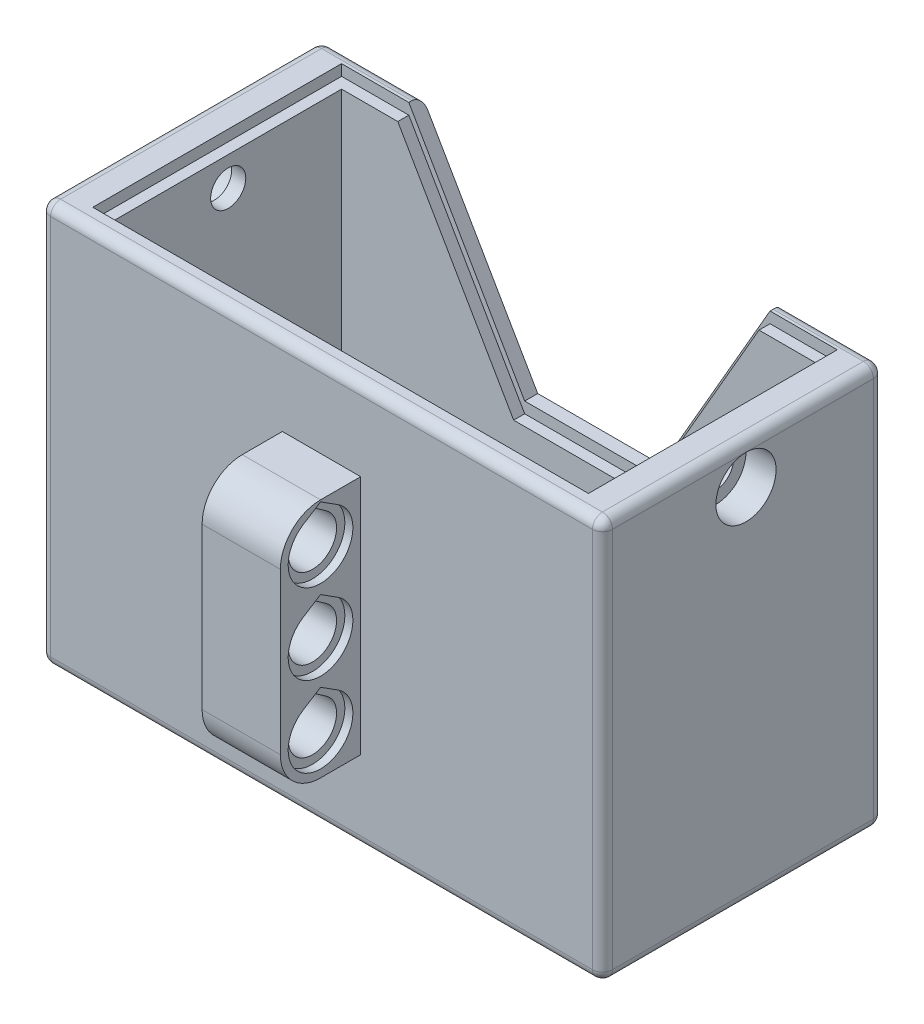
ISO-10303-21;
HEADER;
FILE_DESCRIPTION(('STEP AP214'),'2;1');
FILE_NAME('part.step','',(''),(''),'','','');
FILE_SCHEMA(('AUTOMOTIVE_DESIGN { 1 0 10303 214 1 1 1 1 }'));
ENDSEC;
DATA;
#1=APPLICATION_CONTEXT('core data for automotive mechanical design processes');
#2=APPLICATION_PROTOCOL_DEFINITION('international standard','automotive_design',2000,#1);
#3=PRODUCT_CONTEXT('',#1,'mechanical');
#4=PRODUCT('Part','Part','',(#3));
#5=PRODUCT_RELATED_PRODUCT_CATEGORY('part','',(#4));
#6=PRODUCT_DEFINITION_FORMATION('','',#4);
#7=PRODUCT_DEFINITION_CONTEXT('part definition',#1,'design');
#8=PRODUCT_DEFINITION('design','',#6,#7);
#9=PRODUCT_DEFINITION_SHAPE('','',#8);
#10=(LENGTH_UNIT() NAMED_UNIT(*) SI_UNIT(.MILLI.,.METRE.));
#11=(NAMED_UNIT(*) PLANE_ANGLE_UNIT() SI_UNIT($,.RADIAN.));
#12=(NAMED_UNIT(*) SI_UNIT($,.STERADIAN.) SOLID_ANGLE_UNIT());
#13=UNCERTAINTY_MEASURE_WITH_UNIT(LENGTH_MEASURE(1.E-05),#10,'distance_accuracy_value','');
#14=(GEOMETRIC_REPRESENTATION_CONTEXT(3) GLOBAL_UNCERTAINTY_ASSIGNED_CONTEXT((#13)) GLOBAL_UNIT_ASSIGNED_CONTEXT((#10,
#11,#12)) REPRESENTATION_CONTEXT('',''));
#15=CARTESIAN_POINT('',(0.,0.,0.));
#16=DIRECTION('',(0.,0.,1.));
#17=DIRECTION('',(1.,0.,0.));
#18=AXIS2_PLACEMENT_3D('',#15,#16,#17);
#19=CARTESIAN_POINT('',(3.9,14.9298590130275,3.99999999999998));
#20=DIRECTION('',(0.,-0.819152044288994,0.573576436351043));
#21=DIRECTION('',(0.,-0.573576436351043,-0.819152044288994));
#22=AXIS2_PLACEMENT_3D('',#19,#20,#21);
#23=PLANE('',#22);
#24=DIRECTION('',(-1.,0.,0.));
#25=VECTOR('',#24,1.);
#26=CARTESIAN_POINT('',(3.9,14.9298590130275,3.99999999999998));
#27=LINE('',#26,#25);
#28=CARTESIAN_POINT('',(3.1,14.9298590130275,3.99999999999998));
#29=VERTEX_POINT('',#28);
#30=CARTESIAN_POINT('',(-3.1,14.9298590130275,3.99999999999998));
#31=VERTEX_POINT('',#30);
#32=EDGE_CURVE('E709',#29,#31,#27,.T.);
#33=ORIENTED_EDGE('',*,*,#32,.T.);
#34=DIRECTION('',(0.,-0.573576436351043,-0.819152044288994));
#35=VECTOR('',#34,1.);
#36=CARTESIAN_POINT('',(-3.1,14.9298590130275,3.99999999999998));
#37=LINE('',#36,#35);
#38=CARTESIAN_POINT('',(-3.1,13.9659649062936,2.62341655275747));
#39=VERTEX_POINT('',#38);
#40=EDGE_CURVE('E574',#31,#39,#37,.T.);
#41=ORIENTED_EDGE('',*,*,#40,.T.);
#42=DIRECTION('',(-1.,0.,0.));
#43=VECTOR('',#42,1.);
#44=CARTESIAN_POINT('',(3.9,13.9659649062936,2.62341655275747));
#45=LINE('',#44,#43);
#46=CARTESIAN_POINT('',(3.1,13.9659649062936,2.62341655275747));
#47=VERTEX_POINT('',#46);
#48=EDGE_CURVE('E703',#47,#39,#45,.T.);
#49=ORIENTED_EDGE('',*,*,#48,.F.);
#50=DIRECTION('',(0.,0.573576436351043,0.819152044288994));
#51=VECTOR('',#50,1.);
#52=CARTESIAN_POINT('',(3.1,14.9298590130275,3.99999999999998));
#53=LINE('',#52,#51);
#54=EDGE_CURVE('E682',#47,#29,#53,.T.);
#55=ORIENTED_EDGE('',*,*,#54,.T.);
#56=EDGE_LOOP('',(#33,#41,#49,#55));
#57=FACE_BOUND('',#56,.T.);
#58=ADVANCED_FACE('F39',(#57),#23,.T.);
#59=CARTESIAN_POINT('',(3.9,14.9298590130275,3.99999999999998));
#60=DIRECTION('',(0.,-0.819152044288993,-0.573576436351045));
#61=DIRECTION('',(0.,0.573576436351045,-0.819152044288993));
#62=AXIS2_PLACEMENT_3D('',#59,#60,#61);
#63=PLANE('',#62);
#64=DIRECTION('',(-1.,0.,0.));
#65=VECTOR('',#64,1.);
#66=CARTESIAN_POINT('',(3.9,13.9659649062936,5.37658344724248));
#67=LINE('',#66,#65);
#68=CARTESIAN_POINT('',(3.1,13.9659649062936,5.37658344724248));
#69=VERTEX_POINT('',#68);
#70=CARTESIAN_POINT('',(-3.1,13.9659649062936,5.37658344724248));
#71=VERTEX_POINT('',#70);
#72=EDGE_CURVE('E706',#69,#71,#67,.T.);
#73=ORIENTED_EDGE('',*,*,#72,.T.);
#74=DIRECTION('',(0.,0.573576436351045,-0.819152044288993));
#75=VECTOR('',#74,1.);
#76=CARTESIAN_POINT('',(-3.1,14.9298590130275,3.99999999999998));
#77=LINE('',#76,#75);
#78=EDGE_CURVE('E54',#71,#31,#77,.T.);
#79=ORIENTED_EDGE('',*,*,#78,.T.);
#80=ORIENTED_EDGE('',*,*,#32,.F.);
#81=DIRECTION('',(0.,-0.573576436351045,0.819152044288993));
#82=VECTOR('',#81,1.);
#83=CARTESIAN_POINT('',(3.1,14.9298590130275,3.99999999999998));
#84=LINE('',#83,#82);
#85=EDGE_CURVE('E679',#29,#69,#84,.T.);
#86=ORIENTED_EDGE('',*,*,#85,.T.);
#87=EDGE_LOOP('',(#73,#79,#80,#86));
#88=FACE_BOUND('',#87,.T.);
#89=ADVANCED_FACE('F1193',(#88),#63,.T.);
#90=CARTESIAN_POINT('',(3.9,12.,3.99999999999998));
#91=DIRECTION('',(-1.,0.,0.));
#92=DIRECTION('',(0.,0.,1.));
#93=AXIS2_PLACEMENT_3D('',#90,#91,#92);
#94=CYLINDRICAL_SURFACE('',#93,2.4);
#95=ORIENTED_EDGE('',*,*,#48,.T.);
#96=CARTESIAN_POINT('',(-3.1,12.,3.99999999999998));
#97=DIRECTION('',(-1.,0.,0.));
#98=DIRECTION('',(0.,0.,1.));
#99=AXIS2_PLACEMENT_3D('',#96,#97,#98);
#100=CIRCLE('',#99,2.4);
#101=EDGE_CURVE('E12',#39,#71,#100,.T.);
#102=ORIENTED_EDGE('',*,*,#101,.T.);
#103=ORIENTED_EDGE('',*,*,#72,.F.);
#104=CARTESIAN_POINT('',(3.1,12.,3.99999999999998));
#105=DIRECTION('',(1.,0.,0.));
#106=DIRECTION('',(0.,0.,-1.));
#107=AXIS2_PLACEMENT_3D('',#104,#105,#106);
#108=CIRCLE('',#107,2.4);
#109=EDGE_CURVE('E1149',#69,#47,#108,.T.);
#110=ORIENTED_EDGE('',*,*,#109,.T.);
#111=EDGE_LOOP('',(#95,#102,#103,#110));
#112=FACE_BOUND('',#111,.T.);
#113=ADVANCED_FACE('F1199',(#112),#94,.F.);
#114=CARTESIAN_POINT('',(3.9,22.9298590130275,4.));
#115=DIRECTION('',(0.,-0.819152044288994,0.573576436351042));
#116=DIRECTION('',(0.,-0.573576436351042,-0.819152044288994));
#117=AXIS2_PLACEMENT_3D('',#114,#115,#116);
#118=PLANE('',#117);
#119=DIRECTION('',(-1.,0.,0.));
#120=VECTOR('',#119,1.);
#121=CARTESIAN_POINT('',(3.9,22.9298590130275,4.));
#122=LINE('',#121,#120);
#123=CARTESIAN_POINT('',(3.1,22.9298590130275,4.));
#124=VERTEX_POINT('',#123);
#125=CARTESIAN_POINT('',(-3.1,22.9298590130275,4.));
#126=VERTEX_POINT('',#125);
#127=EDGE_CURVE('E700',#124,#126,#122,.T.);
#128=ORIENTED_EDGE('',*,*,#127,.T.);
#129=DIRECTION('',(0.,-0.573576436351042,-0.819152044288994));
#130=VECTOR('',#129,1.);
#131=CARTESIAN_POINT('',(-3.1,22.9298590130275,4.));
#132=LINE('',#131,#130);
#133=CARTESIAN_POINT('',(-3.1,21.9659649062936,2.6234165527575));
#134=VERTEX_POINT('',#133);
#135=EDGE_CURVE('E570',#126,#134,#132,.T.);
#136=ORIENTED_EDGE('',*,*,#135,.T.);
#137=DIRECTION('',(-1.,0.,0.));
#138=VECTOR('',#137,1.);
#139=CARTESIAN_POINT('',(3.9,21.9659649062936,2.6234165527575));
#140=LINE('',#139,#138);
#141=CARTESIAN_POINT('',(3.1,21.9659649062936,2.6234165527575));
#142=VERTEX_POINT('',#141);
#143=EDGE_CURVE('E694',#142,#134,#140,.T.);
#144=ORIENTED_EDGE('',*,*,#143,.F.);
#145=DIRECTION('',(0.,0.573576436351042,0.819152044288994));
#146=VECTOR('',#145,1.);
#147=CARTESIAN_POINT('',(3.1,22.9298590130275,4.));
#148=LINE('',#147,#146);
#149=EDGE_CURVE('E676',#142,#124,#148,.T.);
#150=ORIENTED_EDGE('',*,*,#149,.T.);
#151=EDGE_LOOP('',(#128,#136,#144,#150));
#152=FACE_BOUND('',#151,.T.);
#153=ADVANCED_FACE('F1165',(#152),#118,.T.);
#154=CARTESIAN_POINT('',(3.9,22.9298590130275,4.));
#155=DIRECTION('',(0.,-0.819152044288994,-0.573576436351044));
#156=DIRECTION('',(0.,0.573576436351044,-0.819152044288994));
#157=AXIS2_PLACEMENT_3D('',#154,#155,#156);
#158=PLANE('',#157);
#159=DIRECTION('',(-1.,0.,0.));
#160=VECTOR('',#159,1.);
#161=CARTESIAN_POINT('',(3.9,21.9659649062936,5.37658344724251));
#162=LINE('',#161,#160);
#163=CARTESIAN_POINT('',(3.1,21.9659649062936,5.37658344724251));
#164=VERTEX_POINT('',#163);
#165=CARTESIAN_POINT('',(-3.1,21.9659649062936,5.37658344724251));
#166=VERTEX_POINT('',#165);
#167=EDGE_CURVE('E697',#164,#166,#162,.T.);
#168=ORIENTED_EDGE('',*,*,#167,.T.);
#169=DIRECTION('',(0.,0.573576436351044,-0.819152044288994));
#170=VECTOR('',#169,1.);
#171=CARTESIAN_POINT('',(-3.1,22.9298590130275,4.));
#172=LINE('',#171,#170);
#173=EDGE_CURVE('E61',#166,#126,#172,.T.);
#174=ORIENTED_EDGE('',*,*,#173,.T.);
#175=ORIENTED_EDGE('',*,*,#127,.F.);
#176=DIRECTION('',(0.,-0.573576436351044,0.819152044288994));
#177=VECTOR('',#176,1.);
#178=CARTESIAN_POINT('',(3.1,22.9298590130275,4.));
#179=LINE('',#178,#177);
#180=EDGE_CURVE('E673',#124,#164,#179,.T.);
#181=ORIENTED_EDGE('',*,*,#180,.T.);
#182=EDGE_LOOP('',(#168,#174,#175,#181));
#183=FACE_BOUND('',#182,.T.);
#184=ADVANCED_FACE('F1159',(#183),#158,.T.);
#185=CARTESIAN_POINT('',(3.9,20.,4.));
#186=DIRECTION('',(-1.,0.,0.));
#187=DIRECTION('',(0.,0.,1.));
#188=AXIS2_PLACEMENT_3D('',#185,#186,#187);
#189=CYLINDRICAL_SURFACE('',#188,2.4);
#190=ORIENTED_EDGE('',*,*,#143,.T.);
#191=CARTESIAN_POINT('',(-3.1,20.,4.));
#192=DIRECTION('',(-1.,0.,0.));
#193=DIRECTION('',(0.,0.,1.));
#194=AXIS2_PLACEMENT_3D('',#191,#192,#193);
#195=CIRCLE('',#194,2.4);
#196=EDGE_CURVE('E47',#134,#166,#195,.T.);
#197=ORIENTED_EDGE('',*,*,#196,.T.);
#198=ORIENTED_EDGE('',*,*,#167,.F.);
#199=CARTESIAN_POINT('',(3.1,20.,4.));
#200=DIRECTION('',(1.,0.,0.));
#201=DIRECTION('',(0.,0.,-1.));
#202=AXIS2_PLACEMENT_3D('',#199,#200,#201);
#203=CIRCLE('',#202,2.4);
#204=EDGE_CURVE('E1146',#164,#142,#203,.T.);
#205=ORIENTED_EDGE('',*,*,#204,.T.);
#206=EDGE_LOOP('',(#190,#197,#198,#205));
#207=FACE_BOUND('',#206,.T.);
#208=ADVANCED_FACE('F1156',(#207),#189,.F.);
#209=CARTESIAN_POINT('',(3.9,30.9298590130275,4.00000000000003));
#210=DIRECTION('',(0.,-0.819152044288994,0.573576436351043));
#211=DIRECTION('',(0.,-0.573576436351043,-0.819152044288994));
#212=AXIS2_PLACEMENT_3D('',#209,#210,#211);
#213=PLANE('',#212);
#214=DIRECTION('',(-1.,0.,0.));
#215=VECTOR('',#214,1.);
#216=CARTESIAN_POINT('',(3.9,30.9298590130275,4.00000000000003));
#217=LINE('',#216,#215);
#218=CARTESIAN_POINT('',(3.1,30.9298590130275,4.00000000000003));
#219=VERTEX_POINT('',#218);
#220=CARTESIAN_POINT('',(-3.1,30.9298590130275,4.00000000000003));
#221=VERTEX_POINT('',#220);
#222=EDGE_CURVE('E691',#219,#221,#217,.T.);
#223=ORIENTED_EDGE('',*,*,#222,.T.);
#224=DIRECTION('',(0.,-0.573576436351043,-0.819152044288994));
#225=VECTOR('',#224,1.);
#226=CARTESIAN_POINT('',(-3.1,30.9298590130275,4.00000000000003));
#227=LINE('',#226,#225);
#228=CARTESIAN_POINT('',(-3.1,29.9659649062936,2.62341655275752));
#229=VERTEX_POINT('',#228);
#230=EDGE_CURVE('E566',#221,#229,#227,.T.);
#231=ORIENTED_EDGE('',*,*,#230,.T.);
#232=DIRECTION('',(-1.,0.,0.));
#233=VECTOR('',#232,1.);
#234=CARTESIAN_POINT('',(3.9,29.9659649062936,2.62341655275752));
#235=LINE('',#234,#233);
#236=CARTESIAN_POINT('',(3.1,29.9659649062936,2.62341655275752));
#237=VERTEX_POINT('',#236);
#238=EDGE_CURVE('E685',#237,#229,#235,.T.);
#239=ORIENTED_EDGE('',*,*,#238,.F.);
#240=DIRECTION('',(0.,0.573576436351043,0.819152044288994));
#241=VECTOR('',#240,1.);
#242=CARTESIAN_POINT('',(3.1,30.9298590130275,4.00000000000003));
#243=LINE('',#242,#241);
#244=EDGE_CURVE('E670',#237,#219,#243,.T.);
#245=ORIENTED_EDGE('',*,*,#244,.T.);
#246=EDGE_LOOP('',(#223,#231,#239,#245));
#247=FACE_BOUND('',#246,.T.);
#248=ADVANCED_FACE('F1967',(#247),#213,.T.);
#249=CARTESIAN_POINT('',(3.9,30.9298590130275,4.00000000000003));
#250=DIRECTION('',(0.,-0.819152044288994,-0.573576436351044));
#251=DIRECTION('',(0.,0.573576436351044,-0.819152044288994));
#252=AXIS2_PLACEMENT_3D('',#249,#250,#251);
#253=PLANE('',#252);
#254=DIRECTION('',(-1.,0.,0.));
#255=VECTOR('',#254,1.);
#256=CARTESIAN_POINT('',(3.9,29.9659649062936,5.37658344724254));
#257=LINE('',#256,#255);
#258=CARTESIAN_POINT('',(3.1,29.9659649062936,5.37658344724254));
#259=VERTEX_POINT('',#258);
#260=CARTESIAN_POINT('',(-3.1,29.9659649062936,5.37658344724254));
#261=VERTEX_POINT('',#260);
#262=EDGE_CURVE('E688',#259,#261,#257,.T.);
#263=ORIENTED_EDGE('',*,*,#262,.T.);
#264=DIRECTION('',(0.,0.573576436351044,-0.819152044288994));
#265=VECTOR('',#264,1.);
#266=CARTESIAN_POINT('',(-3.1,30.9298590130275,4.00000000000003));
#267=LINE('',#266,#265);
#268=EDGE_CURVE('E515',#261,#221,#267,.T.);
#269=ORIENTED_EDGE('',*,*,#268,.T.);
#270=ORIENTED_EDGE('',*,*,#222,.F.);
#271=DIRECTION('',(0.,-0.573576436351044,0.819152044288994));
#272=VECTOR('',#271,1.);
#273=CARTESIAN_POINT('',(3.1,30.9298590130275,4.00000000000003));
#274=LINE('',#273,#272);
#275=EDGE_CURVE('E617',#219,#259,#274,.T.);
#276=ORIENTED_EDGE('',*,*,#275,.T.);
#277=EDGE_LOOP('',(#263,#269,#270,#276));
#278=FACE_BOUND('',#277,.T.);
#279=ADVANCED_FACE('F1978',(#278),#253,.T.);
#280=CARTESIAN_POINT('',(3.9,28.,4.00000000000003));
#281=DIRECTION('',(-1.,0.,0.));
#282=DIRECTION('',(0.,0.,1.));
#283=AXIS2_PLACEMENT_3D('',#280,#281,#282);
#284=CYLINDRICAL_SURFACE('',#283,2.4);
#285=ORIENTED_EDGE('',*,*,#238,.T.);
#286=CARTESIAN_POINT('',(-3.1,28.,4.00000000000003));
#287=DIRECTION('',(-1.,0.,0.));
#288=DIRECTION('',(0.,0.,1.));
#289=AXIS2_PLACEMENT_3D('',#286,#287,#288);
#290=CIRCLE('',#289,2.4);
#291=EDGE_CURVE('E1152',#229,#261,#290,.T.);
#292=ORIENTED_EDGE('',*,*,#291,.T.);
#293=ORIENTED_EDGE('',*,*,#262,.F.);
#294=CARTESIAN_POINT('',(3.1,28.,4.00000000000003));
#295=DIRECTION('',(1.,0.,0.));
#296=DIRECTION('',(0.,0.,-1.));
#297=AXIS2_PLACEMENT_3D('',#294,#295,#296);
#298=CIRCLE('',#297,2.4);
#299=EDGE_CURVE('E1143',#259,#237,#298,.T.);
#300=ORIENTED_EDGE('',*,*,#299,.T.);
#301=EDGE_LOOP('',(#285,#292,#293,#300));
#302=FACE_BOUND('',#301,.T.);
#303=ADVANCED_FACE('F1439',(#302),#284,.F.);
#304=CARTESIAN_POINT('',(-28.,12.,0.));
#305=DIRECTION('',(0.,0.,-1.));
#306=DIRECTION('',(-1.,0.,0.));
#307=AXIS2_PLACEMENT_3D('',#304,#305,#306);
#308=PLANE('',#307);
#309=DIRECTION('',(-1.,0.,0.));
#310=VECTOR('',#309,1.);
#311=CARTESIAN_POINT('',(3.9,8.,0.));
#312=LINE('',#311,#310);
#313=CARTESIAN_POINT('',(3.9,8.,0.));
#314=VERTEX_POINT('',#313);
#315=CARTESIAN_POINT('',(-3.9,8.,0.));
#316=VERTEX_POINT('',#315);
#317=EDGE_CURVE('E726',#314,#316,#312,.T.);
#318=ORIENTED_EDGE('',*,*,#317,.T.);
#319=DIRECTION('',(0.,1.,0.));
#320=VECTOR('',#319,1.);
#321=CARTESIAN_POINT('',(-3.9,8.,0.));
#322=LINE('',#321,#320);
#323=CARTESIAN_POINT('',(-3.9,32.,0.));
#324=VERTEX_POINT('',#323);
#325=EDGE_CURVE('E577',#316,#324,#322,.T.);
#326=ORIENTED_EDGE('',*,*,#325,.T.);
#327=DIRECTION('',(-1.,0.,0.));
#328=VECTOR('',#327,1.);
#329=CARTESIAN_POINT('',(3.9,32.,0.));
#330=LINE('',#329,#328);
#331=CARTESIAN_POINT('',(3.9,32.,0.));
#332=VERTEX_POINT('',#331);
#333=EDGE_CURVE('E736',#332,#324,#330,.T.);
#334=ORIENTED_EDGE('',*,*,#333,.F.);
#335=DIRECTION('',(0.,1.,0.));
#336=VECTOR('',#335,1.);
#337=CARTESIAN_POINT('',(3.9,8.,0.));
#338=LINE('',#337,#336);
#339=EDGE_CURVE('E712',#314,#332,#338,.T.);
#340=ORIENTED_EDGE('',*,*,#339,.F.);
#341=EDGE_LOOP('',(#318,#326,#334,#340));
#342=FACE_BOUND('',#341,.T.);
#343=DIRECTION('',(0.,-1.,0.));
#344=VECTOR('',#343,1.);
#345=CARTESIAN_POINT('',(-27.,12.,0.));
#346=LINE('',#345,#344);
#347=CARTESIAN_POINT('',(-27.,39.,0.));
#348=VERTEX_POINT('',#347);
#349=CARTESIAN_POINT('',(-27.,1.,0.));
#350=VERTEX_POINT('',#349);
#351=EDGE_CURVE('E997',#348,#350,#346,.T.);
#352=ORIENTED_EDGE('',*,*,#351,.T.);
#353=DIRECTION('',(1.,0.,0.));
#354=VECTOR('',#353,1.);
#355=CARTESIAN_POINT('',(28.,1.,0.));
#356=LINE('',#355,#354);
#357=CARTESIAN_POINT('',(27.,1.,0.));
#358=VERTEX_POINT('',#357);
#359=EDGE_CURVE('E1007',#350,#358,#356,.T.);
#360=ORIENTED_EDGE('',*,*,#359,.T.);
#361=DIRECTION('',(0.,-1.,0.));
#362=VECTOR('',#361,1.);
#363=CARTESIAN_POINT('',(27.,12.,0.));
#364=LINE('',#363,#362);
#365=CARTESIAN_POINT('',(27.,39.,0.));
#366=VERTEX_POINT('',#365);
#367=EDGE_CURVE('E1005',#358,#366,#364,.F.);
#368=ORIENTED_EDGE('',*,*,#367,.T.);
#369=DIRECTION('',(1.,0.,0.));
#370=VECTOR('',#369,1.);
#371=CARTESIAN_POINT('',(-28.,39.,0.));
#372=LINE('',#371,#370);
#373=EDGE_CURVE('E1003',#366,#348,#372,.F.);
#374=ORIENTED_EDGE('',*,*,#373,.T.);
#375=EDGE_LOOP('',(#352,#360,#368,#374));
#376=FACE_BOUND('',#375,.T.);
#377=ADVANCED_FACE('F1243',(#342,#376),#308,.F.);
#378=CARTESIAN_POINT('',(28.5497474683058,36.,-14.3));
#379=DIRECTION('',(-1.,0.,0.));
#380=DIRECTION('',(0.,0.,1.));
#381=AXIS2_PLACEMENT_3D('',#378,#379,#380);
#382=CYLINDRICAL_SURFACE('',#381,1.75);
#383=CARTESIAN_POINT('',(-23.6,36.,-14.3));
#384=DIRECTION('',(1.,0.,0.));
#385=DIRECTION('',(0.,0.,-1.));
#386=AXIS2_PLACEMENT_3D('',#383,#384,#385);
#387=CIRCLE('',#386,1.75);
#388=CARTESIAN_POINT('',(-23.6,36.,-16.05));
#389=VERTEX_POINT('',#388);
#390=EDGE_CURVE('E747',#389,#389,#387,.F.);
#391=ORIENTED_EDGE('',*,*,#390,.F.);
#392=EDGE_LOOP('',(#391));
#393=FACE_BOUND('',#392,.T.);
#394=CARTESIAN_POINT('',(-25.,36.,-14.3));
#395=DIRECTION('',(-1.,0.,0.));
#396=DIRECTION('',(0.,0.,1.));
#397=AXIS2_PLACEMENT_3D('',#394,#395,#396);
#398=CIRCLE('',#397,1.75);
#399=CARTESIAN_POINT('',(-25.,36.,-12.55));
#400=VERTEX_POINT('',#399);
#401=EDGE_CURVE('E742',#400,#400,#398,.T.);
#402=ORIENTED_EDGE('',*,*,#401,.T.);
#403=EDGE_LOOP('',(#402));
#404=FACE_BOUND('',#403,.T.);
#405=ADVANCED_FACE('F1239',(#393,#404),#382,.F.);
#406=CARTESIAN_POINT('',(18.6502525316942,36.,-14.3));
#407=DIRECTION('',(1.,0.,0.));
#408=DIRECTION('',(0.,0.,-1.));
#409=AXIS2_PLACEMENT_3D('',#406,#407,#408);
#410=CYLINDRICAL_SURFACE('',#409,1.75);
#411=CARTESIAN_POINT('',(23.6,36.,-14.3));
#412=DIRECTION('',(-1.,0.,0.));
#413=DIRECTION('',(0.,0.,1.));
#414=AXIS2_PLACEMENT_3D('',#411,#412,#413);
#415=CIRCLE('',#414,1.75);
#416=CARTESIAN_POINT('',(23.6,36.,-12.55));
#417=VERTEX_POINT('',#416);
#418=EDGE_CURVE('E757',#417,#417,#415,.F.);
#419=ORIENTED_EDGE('',*,*,#418,.F.);
#420=EDGE_LOOP('',(#419));
#421=FACE_BOUND('',#420,.T.);
#422=CARTESIAN_POINT('',(25.,36.,-14.3));
#423=DIRECTION('',(1.,0.,0.));
#424=DIRECTION('',(0.,0.,-1.));
#425=AXIS2_PLACEMENT_3D('',#422,#423,#424);
#426=CIRCLE('',#425,1.75);
#427=CARTESIAN_POINT('',(25.,36.,-16.05));
#428=VERTEX_POINT('',#427);
#429=EDGE_CURVE('E754',#428,#428,#426,.F.);
#430=ORIENTED_EDGE('',*,*,#429,.F.);
#431=EDGE_LOOP('',(#430));
#432=FACE_BOUND('',#431,.T.);
#433=ADVANCED_FACE('F1242',(#421,#432),#410,.F.);
#434=CARTESIAN_POINT('',(0.,12.,0.));
#435=DIRECTION('',(0.,-1.,0.));
#436=DIRECTION('',(0.,0.,-1.));
#437=AXIS2_PLACEMENT_3D('',#434,#435,#436);
#438=PLANE('',#437);
#439=CARTESIAN_POINT('',(-21.2,12.,-5.));
#440=DIRECTION('',(0.,1.,0.));
#441=DIRECTION('',(0.,0.,1.));
#442=AXIS2_PLACEMENT_3D('',#439,#440,#441);
#443=CIRCLE('',#442,0.750000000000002);
#444=CARTESIAN_POINT('',(-21.2,12.,-4.25));
#445=VERTEX_POINT('',#444);
#446=EDGE_CURVE('E814',#445,#445,#443,.T.);
#447=ORIENTED_EDGE('',*,*,#446,.F.);
#448=EDGE_LOOP('',(#447));
#449=FACE_BOUND('',#448,.T.);
#450=CARTESIAN_POINT('',(21.2,12.,-5.));
#451=DIRECTION('',(0.,1.,0.));
#452=DIRECTION('',(0.,0.,-1.));
#453=AXIS2_PLACEMENT_3D('',#450,#451,#452);
#454=CIRCLE('',#453,0.750000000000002);
#455=CARTESIAN_POINT('',(21.2,12.,-5.75));
#456=VERTEX_POINT('',#455);
#457=EDGE_CURVE('E832',#456,#456,#454,.T.);
#458=ORIENTED_EDGE('',*,*,#457,.F.);
#459=EDGE_LOOP('',(#458));
#460=FACE_BOUND('',#459,.T.);
#461=CARTESIAN_POINT('',(21.2,12.,-22.6));
#462=DIRECTION('',(0.,1.,0.));
#463=DIRECTION('',(0.,0.,-1.));
#464=AXIS2_PLACEMENT_3D('',#461,#462,#463);
#465=CIRCLE('',#464,0.750000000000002);
#466=CARTESIAN_POINT('',(21.2,12.,-23.35));
#467=VERTEX_POINT('',#466);
#468=EDGE_CURVE('E856',#467,#467,#465,.T.);
#469=ORIENTED_EDGE('',*,*,#468,.F.);
#470=EDGE_LOOP('',(#469));
#471=FACE_BOUND('',#470,.T.);
#472=CARTESIAN_POINT('',(-21.2,12.,-22.6));
#473=DIRECTION('',(0.,1.,0.));
#474=DIRECTION('',(0.,0.,1.));
#475=AXIS2_PLACEMENT_3D('',#472,#473,#474);
#476=CIRCLE('',#475,0.750000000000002);
#477=CARTESIAN_POINT('',(-21.2,12.,-21.85));
#478=VERTEX_POINT('',#477);
#479=EDGE_CURVE('E817',#478,#478,#476,.T.);
#480=ORIENTED_EDGE('',*,*,#479,.F.);
#481=EDGE_LOOP('',(#480));
#482=FACE_BOUND('',#481,.T.);
#483=DIRECTION('',(1.,0.,0.));
#484=VECTOR('',#483,1.);
#485=CARTESIAN_POINT('',(4.99999999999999,12.,-18.6));
#486=LINE('',#485,#484);
#487=CARTESIAN_POINT('',(-5.,12.,-18.6));
#488=VERTEX_POINT('',#487);
#489=CARTESIAN_POINT('',(4.99999999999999,12.,-18.6));
#490=VERTEX_POINT('',#489);
#491=EDGE_CURVE('E835',#488,#490,#486,.T.);
#492=ORIENTED_EDGE('',*,*,#491,.F.);
#493=DIRECTION('',(0.573576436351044,0.,0.819152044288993));
#494=VECTOR('',#493,1.);
#495=CARTESIAN_POINT('',(-5.,12.,-18.6));
#496=LINE('',#495,#494);
#497=CARTESIAN_POINT('',(-9.90145276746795,12.,-25.6));
#498=VERTEX_POINT('',#497);
#499=EDGE_CURVE('E821',#498,#488,#496,.T.);
#500=ORIENTED_EDGE('',*,*,#499,.F.);
#501=DIRECTION('',(-1.,0.,0.));
#502=VECTOR('',#501,1.);
#503=CARTESIAN_POINT('',(-23.6,12.,-25.6));
#504=LINE('',#503,#502);
#505=CARTESIAN_POINT('',(-23.6,12.,-25.6));
#506=VERTEX_POINT('',#505);
#507=EDGE_CURVE('E977',#498,#506,#504,.T.);
#508=ORIENTED_EDGE('',*,*,#507,.T.);
#509=DIRECTION('',(0.,0.,1.));
#510=VECTOR('',#509,1.);
#511=CARTESIAN_POINT('',(-23.6,12.,-25.6));
#512=LINE('',#511,#510);
#513=CARTESIAN_POINT('',(-23.6,12.,-3.));
#514=VERTEX_POINT('',#513);
#515=EDGE_CURVE('E967',#506,#514,#512,.T.);
#516=ORIENTED_EDGE('',*,*,#515,.T.);
#517=DIRECTION('',(1.,0.,0.));
#518=VECTOR('',#517,1.);
#519=CARTESIAN_POINT('',(-23.6,12.,-3.));
#520=LINE('',#519,#518);
#521=CARTESIAN_POINT('',(-5.,12.,-3.));
#522=VERTEX_POINT('',#521);
#523=EDGE_CURVE('E971',#514,#522,#520,.T.);
#524=ORIENTED_EDGE('',*,*,#523,.T.);
#525=DIRECTION('',(0.,0.,1.));
#526=VECTOR('',#525,1.);
#527=CARTESIAN_POINT('',(-5.,12.,-7.));
#528=LINE('',#527,#526);
#529=CARTESIAN_POINT('',(-5.,12.,-7.));
#530=VERTEX_POINT('',#529);
#531=EDGE_CURVE('E797',#530,#522,#528,.T.);
#532=ORIENTED_EDGE('',*,*,#531,.F.);
#533=DIRECTION('',(-1.,0.,0.));
#534=VECTOR('',#533,1.);
#535=CARTESIAN_POINT('',(5.,12.,-7.));
#536=LINE('',#535,#534);
#537=CARTESIAN_POINT('',(5.,12.,-7.));
#538=VERTEX_POINT('',#537);
#539=EDGE_CURVE('E800',#538,#530,#536,.T.);
#540=ORIENTED_EDGE('',*,*,#539,.F.);
#541=DIRECTION('',(0.,0.,-1.));
#542=VECTOR('',#541,1.);
#543=CARTESIAN_POINT('',(5.,12.,-7.));
#544=LINE('',#543,#542);
#545=CARTESIAN_POINT('',(5.,12.,-3.));
#546=VERTEX_POINT('',#545);
#547=EDGE_CURVE('E794',#546,#538,#544,.T.);
#548=ORIENTED_EDGE('',*,*,#547,.F.);
#549=CARTESIAN_POINT('',(23.6,12.,-3.));
#550=VERTEX_POINT('',#549);
#551=EDGE_CURVE('E970',#546,#550,#520,.T.);
#552=ORIENTED_EDGE('',*,*,#551,.T.);
#553=DIRECTION('',(0.,0.,-1.));
#554=VECTOR('',#553,1.);
#555=CARTESIAN_POINT('',(23.6,12.,-25.6));
#556=LINE('',#555,#554);
#557=CARTESIAN_POINT('',(23.6,12.,-25.6));
#558=VERTEX_POINT('',#557);
#559=EDGE_CURVE('E974',#550,#558,#556,.T.);
#560=ORIENTED_EDGE('',*,*,#559,.T.);
#561=CARTESIAN_POINT('',(9.90145276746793,12.,-25.6));
#562=VERTEX_POINT('',#561);
#563=EDGE_CURVE('E978',#558,#562,#504,.T.);
#564=ORIENTED_EDGE('',*,*,#563,.T.);
#565=DIRECTION('',(0.573576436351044,0.,-0.819152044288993));
#566=VECTOR('',#565,1.);
#567=CARTESIAN_POINT('',(4.99999999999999,12.,-18.6));
#568=LINE('',#567,#566);
#569=EDGE_CURVE('E833',#490,#562,#568,.T.);
#570=ORIENTED_EDGE('',*,*,#569,.F.);
#571=EDGE_LOOP('',(#492,#500,#508,#516,#524,#532,#540,#548,#552,#560,#564,#570));
#572=FACE_BOUND('',#571,.T.);
#573=CARTESIAN_POINT('',(-13.05,12.,-14.));
#574=DIRECTION('',(0.,1.,0.));
#575=DIRECTION('',(0.,0.,1.));
#576=AXIS2_PLACEMENT_3D('',#573,#574,#575);
#577=CIRCLE('',#576,8.5);
#578=CARTESIAN_POINT('',(-13.05,12.,-5.50000000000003));
#579=VERTEX_POINT('',#578);
#580=EDGE_CURVE('E994',#579,#579,#577,.T.);
#581=ORIENTED_EDGE('',*,*,#580,.F.);
#582=EDGE_LOOP('',(#581));
#583=FACE_BOUND('',#582,.T.);
#584=CARTESIAN_POINT('',(13.05,12.,-14.));
#585=DIRECTION('',(0.,1.,0.));
#586=DIRECTION('',(0.,0.,-1.));
#587=AXIS2_PLACEMENT_3D('',#584,#585,#586);
#588=CIRCLE('',#587,8.5);
#589=CARTESIAN_POINT('',(13.05,12.,-22.5));
#590=VERTEX_POINT('',#589);
#591=EDGE_CURVE('E991',#590,#590,#588,.T.);
#592=ORIENTED_EDGE('',*,*,#591,.F.);
#593=EDGE_LOOP('',(#592));
#594=FACE_BOUND('',#593,.T.);
#595=ADVANCED_FACE('F1255',(#449,#460,#471,#482,#572,#583,#594),#438,.F.);
#596=CARTESIAN_POINT('',(0.,0.,0.));
#597=DIRECTION('',(0.,-1.,0.));
#598=DIRECTION('',(0.,0.,-1.));
#599=AXIS2_PLACEMENT_3D('',#596,#597,#598);
#600=PLANE('',#599);
#601=CARTESIAN_POINT('',(13.05,0.,-14.));
#602=DIRECTION('',(0.,-1.,0.));
#603=DIRECTION('',(0.,0.,-1.));
#604=AXIS2_PLACEMENT_3D('',#601,#602,#603);
#605=CIRCLE('',#604,10.5);
#606=CARTESIAN_POINT('',(13.05,0.,-24.5));
#607=VERTEX_POINT('',#606);
#608=EDGE_CURVE('E1134',#607,#607,#605,.F.);
#609=ORIENTED_EDGE('',*,*,#608,.T.);
#610=EDGE_LOOP('',(#609));
#611=FACE_BOUND('',#610,.T.);
#612=CARTESIAN_POINT('',(-13.05,0.,-14.));
#613=DIRECTION('',(0.,-1.,0.));
#614=DIRECTION('',(0.,0.,-1.));
#615=AXIS2_PLACEMENT_3D('',#612,#613,#614);
#616=CIRCLE('',#615,10.5);
#617=CARTESIAN_POINT('',(-13.05,0.,-24.5));
#618=VERTEX_POINT('',#617);
#619=EDGE_CURVE('E1066',#618,#618,#616,.F.);
#620=ORIENTED_EDGE('',*,*,#619,.T.);
#621=EDGE_LOOP('',(#620));
#622=FACE_BOUND('',#621,.T.);
#623=DIRECTION('',(-1.,0.,0.));
#624=VECTOR('',#623,1.);
#625=CARTESIAN_POINT('',(28.,0.,-27.));
#626=LINE('',#625,#624);
#627=CARTESIAN_POINT('',(-27.,0.,-27.));
#628=VERTEX_POINT('',#627);
#629=CARTESIAN_POINT('',(27.,0.,-27.));
#630=VERTEX_POINT('',#629);
#631=EDGE_CURVE('E1012',#628,#630,#626,.F.);
#632=ORIENTED_EDGE('',*,*,#631,.T.);
#633=DIRECTION('',(0.,0.,-1.));
#634=VECTOR('',#633,1.);
#635=CARTESIAN_POINT('',(27.,0.,0.));
#636=LINE('',#635,#634);
#637=CARTESIAN_POINT('',(27.,0.,-1.00000000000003));
#638=VERTEX_POINT('',#637);
#639=EDGE_CURVE('E1017',#630,#638,#636,.F.);
#640=ORIENTED_EDGE('',*,*,#639,.T.);
#641=DIRECTION('',(1.,0.,0.));
#642=VECTOR('',#641,1.);
#643=CARTESIAN_POINT('',(-28.,0.,-1.));
#644=LINE('',#643,#642);
#645=CARTESIAN_POINT('',(-27.,0.,-1.));
#646=VERTEX_POINT('',#645);
#647=EDGE_CURVE('E1014',#638,#646,#644,.F.);
#648=ORIENTED_EDGE('',*,*,#647,.T.);
#649=DIRECTION('',(0.,0.,1.));
#650=VECTOR('',#649,1.);
#651=CARTESIAN_POINT('',(-27.,0.,-28.));
#652=LINE('',#651,#650);
#653=EDGE_CURVE('E1010',#646,#628,#652,.F.);
#654=ORIENTED_EDGE('',*,*,#653,.T.);
#655=EDGE_LOOP('',(#632,#640,#648,#654));
#656=FACE_BOUND('',#655,.T.);
#657=ADVANCED_FACE('F1427',(#611,#622,#656),#600,.T.);
#658=CARTESIAN_POINT('',(-28.,12.,-28.));
#659=DIRECTION('',(0.,0.,1.));
#660=DIRECTION('',(1.,0.,0.));
#661=AXIS2_PLACEMENT_3D('',#658,#659,#660);
#662=PLANE('',#661);
#663=DIRECTION('',(-0.499999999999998,-0.86602540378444,0.));
#664=VECTOR('',#663,1.);
#665=CARTESIAN_POINT('',(18.,40.,-28.));
#666=LINE('',#665,#664);
#667=CARTESIAN_POINT('',(17.4226497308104,39.,-28.));
#668=VERTEX_POINT('',#667);
#669=CARTESIAN_POINT('',(6.45299461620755,20.,-28.));
#670=VERTEX_POINT('',#669);
#671=EDGE_CURVE('E943',#668,#670,#666,.T.);
#672=ORIENTED_EDGE('',*,*,#671,.F.);
#673=DIRECTION('',(-1.,0.,0.));
#674=VECTOR('',#673,1.);
#675=CARTESIAN_POINT('',(28.,39.,-28.));
#676=LINE('',#675,#674);
#677=CARTESIAN_POINT('',(27.,39.,-28.));
#678=VERTEX_POINT('',#677);
#679=EDGE_CURVE('E1028',#668,#678,#676,.F.);
#680=ORIENTED_EDGE('',*,*,#679,.T.);
#681=DIRECTION('',(0.,-1.,0.));
#682=VECTOR('',#681,1.);
#683=CARTESIAN_POINT('',(27.,12.,-28.));
#684=LINE('',#683,#682);
#685=CARTESIAN_POINT('',(27.,1.,-28.));
#686=VERTEX_POINT('',#685);
#687=EDGE_CURVE('E1026',#678,#686,#684,.T.);
#688=ORIENTED_EDGE('',*,*,#687,.T.);
#689=DIRECTION('',(-1.,0.,0.));
#690=VECTOR('',#689,1.);
#691=CARTESIAN_POINT('',(-28.,1.,-28.));
#692=LINE('',#691,#690);
#693=CARTESIAN_POINT('',(-27.,1.,-28.));
#694=VERTEX_POINT('',#693);
#695=EDGE_CURVE('E1023',#686,#694,#692,.T.);
#696=ORIENTED_EDGE('',*,*,#695,.T.);
#697=DIRECTION('',(0.,-1.,0.));
#698=VECTOR('',#697,1.);
#699=CARTESIAN_POINT('',(-27.,12.,-28.));
#700=LINE('',#699,#698);
#701=CARTESIAN_POINT('',(-27.,39.,-28.));
#702=VERTEX_POINT('',#701);
#703=EDGE_CURVE('E1019',#694,#702,#700,.F.);
#704=ORIENTED_EDGE('',*,*,#703,.T.);
#705=DIRECTION('',(-1.,0.,0.));
#706=VECTOR('',#705,1.);
#707=CARTESIAN_POINT('',(-18.,39.,-28.));
#708=LINE('',#707,#706);
#709=CARTESIAN_POINT('',(-17.4226497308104,39.,-28.));
#710=VERTEX_POINT('',#709);
#711=EDGE_CURVE('E1021',#702,#710,#708,.F.);
#712=ORIENTED_EDGE('',*,*,#711,.T.);
#713=DIRECTION('',(-0.499999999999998,0.86602540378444,0.));
#714=VECTOR('',#713,1.);
#715=CARTESIAN_POINT('',(-18.,40.,-28.));
#716=LINE('',#715,#714);
#717=CARTESIAN_POINT('',(-6.45299461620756,20.,-28.));
#718=VERTEX_POINT('',#717);
#719=EDGE_CURVE('E949',#718,#710,#716,.T.);
#720=ORIENTED_EDGE('',*,*,#719,.F.);
#721=DIRECTION('',(-1.,0.,0.));
#722=VECTOR('',#721,1.);
#723=CARTESIAN_POINT('',(6.45299461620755,20.,-28.));
#724=LINE('',#723,#722);
#725=EDGE_CURVE('E953',#670,#718,#724,.T.);
#726=ORIENTED_EDGE('',*,*,#725,.F.);
#727=EDGE_LOOP('',(#672,#680,#688,#696,#704,#712,#720,#726));
#728=FACE_BOUND('',#727,.T.);
#729=ADVANCED_FACE('F1431',(#728),#662,.F.);
#730=CARTESIAN_POINT('',(-28.,12.,-28.));
#731=DIRECTION('',(1.,0.,0.));
#732=DIRECTION('',(0.,0.,-1.));
#733=AXIS2_PLACEMENT_3D('',#730,#731,#732);
#734=PLANE('',#733);
#735=DIRECTION('',(0.,-1.,0.));
#736=VECTOR('',#735,1.);
#737=CARTESIAN_POINT('',(-28.,12.,-27.));
#738=LINE('',#737,#736);
#739=CARTESIAN_POINT('',(-28.,39.,-27.));
#740=VERTEX_POINT('',#739);
#741=CARTESIAN_POINT('',(-28.,1.,-27.));
#742=VERTEX_POINT('',#741);
#743=EDGE_CURVE('E1053',#740,#742,#738,.T.);
#744=ORIENTED_EDGE('',*,*,#743,.T.);
#745=DIRECTION('',(0.,0.,1.));
#746=VECTOR('',#745,1.);
#747=CARTESIAN_POINT('',(-28.,1.,0.));
#748=LINE('',#747,#746);
#749=CARTESIAN_POINT('',(-28.,1.,-1.));
#750=VERTEX_POINT('',#749);
#751=EDGE_CURVE('E1061',#742,#750,#748,.T.);
#752=ORIENTED_EDGE('',*,*,#751,.T.);
#753=DIRECTION('',(0.,-1.,0.));
#754=VECTOR('',#753,1.);
#755=CARTESIAN_POINT('',(-28.,12.,-1.));
#756=LINE('',#755,#754);
#757=CARTESIAN_POINT('',(-28.,39.,-1.));
#758=VERTEX_POINT('',#757);
#759=EDGE_CURVE('E1059',#750,#758,#756,.F.);
#760=ORIENTED_EDGE('',*,*,#759,.T.);
#761=DIRECTION('',(0.,0.,1.));
#762=VECTOR('',#761,1.);
#763=CARTESIAN_POINT('',(-28.,39.,-28.));
#764=LINE('',#763,#762);
#765=CARTESIAN_POINT('',(-28.,39.,-14.3));
#766=VERTEX_POINT('',#765);
#767=EDGE_CURVE('E1057',#758,#766,#764,.F.);
#768=ORIENTED_EDGE('',*,*,#767,.T.);
#769=CARTESIAN_POINT('',(-28.,36.,-14.3));
#770=DIRECTION('',(1.,0.,0.));
#771=DIRECTION('',(0.,0.,-1.));
#772=AXIS2_PLACEMENT_3D('',#769,#770,#771);
#773=CIRCLE('',#772,3.);
#774=EDGE_CURVE('E743',#766,#766,#773,.T.);
#775=ORIENTED_EDGE('',*,*,#774,.T.);
#776=DIRECTION('',(0.,0.,1.));
#777=VECTOR('',#776,1.);
#778=CARTESIAN_POINT('',(-28.,39.,-28.));
#779=LINE('',#778,#777);
#780=EDGE_CURVE('E1055',#766,#740,#779,.F.);
#781=ORIENTED_EDGE('',*,*,#780,.T.);
#782=EDGE_LOOP('',(#744,#752,#760,#768,#775,#781));
#783=FACE_BOUND('',#782,.T.);
#784=ADVANCED_FACE('F1435',(#783),#734,.F.);
#785=CARTESIAN_POINT('',(28.,12.,-28.));
#786=DIRECTION('',(-1.,0.,0.));
#787=DIRECTION('',(0.,0.,1.));
#788=AXIS2_PLACEMENT_3D('',#785,#786,#787);
#789=PLANE('',#788);
#790=DIRECTION('',(0.,-1.,0.));
#791=VECTOR('',#790,1.);
#792=CARTESIAN_POINT('',(28.,12.,-1.00000000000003));
#793=LINE('',#792,#791);
#794=CARTESIAN_POINT('',(28.,39.,-1.00000000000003));
#795=VERTEX_POINT('',#794);
#796=CARTESIAN_POINT('',(28.,1.,-1.00000000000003));
#797=VERTEX_POINT('',#796);
#798=EDGE_CURVE('E1036',#795,#797,#793,.T.);
#799=ORIENTED_EDGE('',*,*,#798,.T.);
#800=DIRECTION('',(0.,0.,-1.));
#801=VECTOR('',#800,1.);
#802=CARTESIAN_POINT('',(28.,1.,-28.));
#803=LINE('',#802,#801);
#804=CARTESIAN_POINT('',(28.,1.,-27.));
#805=VERTEX_POINT('',#804);
#806=EDGE_CURVE('E1038',#797,#805,#803,.T.);
#807=ORIENTED_EDGE('',*,*,#806,.T.);
#808=DIRECTION('',(0.,-1.,0.));
#809=VECTOR('',#808,1.);
#810=CARTESIAN_POINT('',(28.,12.,-27.));
#811=LINE('',#810,#809);
#812=CARTESIAN_POINT('',(28.,39.,-27.));
#813=VERTEX_POINT('',#812);
#814=EDGE_CURVE('E1034',#805,#813,#811,.F.);
#815=ORIENTED_EDGE('',*,*,#814,.T.);
#816=DIRECTION('',(0.,0.,-1.));
#817=VECTOR('',#816,1.);
#818=CARTESIAN_POINT('',(28.,39.,0.));
#819=LINE('',#818,#817);
#820=CARTESIAN_POINT('',(28.,39.,-14.3));
#821=VERTEX_POINT('',#820);
#822=EDGE_CURVE('E1032',#813,#821,#819,.F.);
#823=ORIENTED_EDGE('',*,*,#822,.T.);
#824=CARTESIAN_POINT('',(28.,36.,-14.3));
#825=DIRECTION('',(1.,0.,0.));
#826=DIRECTION('',(0.,0.,-1.));
#827=AXIS2_PLACEMENT_3D('',#824,#825,#826);
#828=CIRCLE('',#827,3.);
#829=EDGE_CURVE('E750',#821,#821,#828,.T.);
#830=ORIENTED_EDGE('',*,*,#829,.F.);
#831=DIRECTION('',(0.,0.,-1.));
#832=VECTOR('',#831,1.);
#833=CARTESIAN_POINT('',(28.,39.,0.));
#834=LINE('',#833,#832);
#835=EDGE_CURVE('E1030',#821,#795,#834,.F.);
#836=ORIENTED_EDGE('',*,*,#835,.T.);
#837=EDGE_LOOP('',(#799,#807,#815,#823,#830,#836));
#838=FACE_BOUND('',#837,.T.);
#839=ADVANCED_FACE('F1423',(#838),#789,.F.);
#840=CARTESIAN_POINT('',(-13.05,12.,-14.));
#841=DIRECTION('',(0.,-1.,0.));
#842=DIRECTION('',(0.,0.,-1.));
#843=AXIS2_PLACEMENT_3D('',#840,#841,#842);
#844=CYLINDRICAL_SURFACE('',#843,8.5);
#845=CARTESIAN_POINT('',(-13.05,2.,-14.));
#846=DIRECTION('',(0.,-1.,0.));
#847=DIRECTION('',(0.,0.,-1.));
#848=AXIS2_PLACEMENT_3D('',#845,#846,#847);
#849=CIRCLE('',#848,8.5);
#850=CARTESIAN_POINT('',(-13.05,2.,-22.5));
#851=VERTEX_POINT('',#850);
#852=EDGE_CURVE('E1140',#851,#851,#849,.T.);
#853=ORIENTED_EDGE('',*,*,#852,.T.);
#854=EDGE_LOOP('',(#853));
#855=FACE_BOUND('',#854,.T.);
#856=ORIENTED_EDGE('',*,*,#580,.T.);
#857=EDGE_LOOP('',(#856));
#858=FACE_BOUND('',#857,.T.);
#859=ADVANCED_FACE('F1419',(#855,#858),#844,.F.);
#860=CARTESIAN_POINT('',(13.05,12.,-14.));
#861=DIRECTION('',(0.,-1.,0.));
#862=DIRECTION('',(0.,0.,-1.));
#863=AXIS2_PLACEMENT_3D('',#860,#861,#862);
#864=CYLINDRICAL_SURFACE('',#863,8.5);
#865=CARTESIAN_POINT('',(13.05,2.,-14.));
#866=DIRECTION('',(0.,-1.,0.));
#867=DIRECTION('',(0.,0.,-1.));
#868=AXIS2_PLACEMENT_3D('',#865,#866,#867);
#869=CIRCLE('',#868,8.5);
#870=CARTESIAN_POINT('',(13.05,2.,-22.5));
#871=VERTEX_POINT('',#870);
#872=EDGE_CURVE('E1137',#871,#871,#869,.T.);
#873=ORIENTED_EDGE('',*,*,#872,.T.);
#874=EDGE_LOOP('',(#873));
#875=FACE_BOUND('',#874,.T.);
#876=ORIENTED_EDGE('',*,*,#591,.T.);
#877=EDGE_LOOP('',(#876));
#878=FACE_BOUND('',#877,.T.);
#879=ADVANCED_FACE('F1415',(#875,#878),#864,.F.);
#880=CARTESIAN_POINT('',(0.,40.,0.));
#881=DIRECTION('',(0.,1.,0.));
#882=DIRECTION('',(0.,0.,1.));
#883=AXIS2_PLACEMENT_3D('',#880,#881,#882);
#884=PLANE('',#883);
#885=DIRECTION('',(0.,0.,-1.));
#886=VECTOR('',#885,1.);
#887=CARTESIAN_POINT('',(27.,40.,-28.));
#888=LINE('',#887,#886);
#889=CARTESIAN_POINT('',(27.,40.,-1.00000000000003));
#890=VERTEX_POINT('',#889);
#891=CARTESIAN_POINT('',(27.,40.,-27.));
#892=VERTEX_POINT('',#891);
#893=EDGE_CURVE('E1047',#890,#892,#888,.T.);
#894=ORIENTED_EDGE('',*,*,#893,.T.);
#895=DIRECTION('',(-1.,0.,0.));
#896=VECTOR('',#895,1.);
#897=CARTESIAN_POINT('',(18.,40.,-27.));
#898=LINE('',#897,#896);
#899=CARTESIAN_POINT('',(18.,40.,-27.));
#900=VERTEX_POINT('',#899);
#901=EDGE_CURVE('E1049',#892,#900,#898,.T.);
#902=ORIENTED_EDGE('',*,*,#901,.T.);
#903=DIRECTION('',(0.,0.,-1.));
#904=VECTOR('',#903,1.);
#905=CARTESIAN_POINT('',(18.,40.,15.582520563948));
#906=LINE('',#905,#904);
#907=CARTESIAN_POINT('',(18.,40.,-26.7));
#908=VERTEX_POINT('',#907);
#909=EDGE_CURVE('E960',#908,#900,#906,.T.);
#910=ORIENTED_EDGE('',*,*,#909,.F.);
#911=DIRECTION('',(-1.,0.,0.));
#912=VECTOR('',#911,1.);
#913=CARTESIAN_POINT('',(24.7,40.,-26.7));
#914=LINE('',#913,#912);
#915=CARTESIAN_POINT('',(24.7,40.,-26.7));
#916=VERTEX_POINT('',#915);
#917=EDGE_CURVE('E898',#916,#908,#914,.T.);
#918=ORIENTED_EDGE('',*,*,#917,.F.);
#919=DIRECTION('',(0.,0.,-1.));
#920=VECTOR('',#919,1.);
#921=CARTESIAN_POINT('',(24.7,40.,-1.9));
#922=LINE('',#921,#920);
#923=CARTESIAN_POINT('',(24.7,40.,-1.9));
#924=VERTEX_POINT('',#923);
#925=EDGE_CURVE('E936',#924,#916,#922,.T.);
#926=ORIENTED_EDGE('',*,*,#925,.F.);
#927=DIRECTION('',(1.,0.,0.));
#928=VECTOR('',#927,1.);
#929=CARTESIAN_POINT('',(-24.7,40.,-1.9));
#930=LINE('',#929,#928);
#931=CARTESIAN_POINT('',(-24.7,40.,-1.9));
#932=VERTEX_POINT('',#931);
#933=EDGE_CURVE('E933',#932,#924,#930,.T.);
#934=ORIENTED_EDGE('',*,*,#933,.F.);
#935=DIRECTION('',(0.,0.,1.));
#936=VECTOR('',#935,1.);
#937=CARTESIAN_POINT('',(-24.7,40.,-26.7));
#938=LINE('',#937,#936);
#939=CARTESIAN_POINT('',(-24.7,40.,-26.7));
#940=VERTEX_POINT('',#939);
#941=EDGE_CURVE('E930',#940,#932,#938,.T.);
#942=ORIENTED_EDGE('',*,*,#941,.F.);
#943=DIRECTION('',(-1.,0.,0.));
#944=VECTOR('',#943,1.);
#945=CARTESIAN_POINT('',(-18.,40.,-26.7));
#946=LINE('',#945,#944);
#947=CARTESIAN_POINT('',(-18.,40.,-26.7));
#948=VERTEX_POINT('',#947);
#949=EDGE_CURVE('E892',#948,#940,#946,.T.);
#950=ORIENTED_EDGE('',*,*,#949,.F.);
#951=DIRECTION('',(0.,0.,-1.));
#952=VECTOR('',#951,1.);
#953=CARTESIAN_POINT('',(-18.,40.,15.582520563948));
#954=LINE('',#953,#952);
#955=CARTESIAN_POINT('',(-18.,40.,-27.));
#956=VERTEX_POINT('',#955);
#957=EDGE_CURVE('E957',#948,#956,#954,.T.);
#958=ORIENTED_EDGE('',*,*,#957,.T.);
#959=DIRECTION('',(-1.,0.,0.));
#960=VECTOR('',#959,1.);
#961=CARTESIAN_POINT('',(-28.,40.,-27.));
#962=LINE('',#961,#960);
#963=CARTESIAN_POINT('',(-27.,40.,-27.));
#964=VERTEX_POINT('',#963);
#965=EDGE_CURVE('E1043',#956,#964,#962,.T.);
#966=ORIENTED_EDGE('',*,*,#965,.T.);
#967=DIRECTION('',(0.,0.,1.));
#968=VECTOR('',#967,1.);
#969=CARTESIAN_POINT('',(-27.,40.,0.));
#970=LINE('',#969,#968);
#971=CARTESIAN_POINT('',(-27.,40.,-1.));
#972=VERTEX_POINT('',#971);
#973=EDGE_CURVE('E1041',#964,#972,#970,.T.);
#974=ORIENTED_EDGE('',*,*,#973,.T.);
#975=DIRECTION('',(1.,0.,0.));
#976=VECTOR('',#975,1.);
#977=CARTESIAN_POINT('',(28.,40.,-1.00000000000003));
#978=LINE('',#977,#976);
#979=EDGE_CURVE('E1045',#972,#890,#978,.T.);
#980=ORIENTED_EDGE('',*,*,#979,.T.);
#981=EDGE_LOOP('',(#894,#902,#910,#918,#926,#934,#942,#950,#958,#966,#974,#980));
#982=FACE_BOUND('',#981,.T.);
#983=ADVANCED_FACE('F1411',(#982),#884,.T.);
#984=CARTESIAN_POINT('',(-23.6,40.,-25.6));
#985=DIRECTION('',(1.,0.,0.));
#986=DIRECTION('',(0.,0.,-1.));
#987=AXIS2_PLACEMENT_3D('',#984,#985,#986);
#988=PLANE('',#987);
#989=ORIENTED_EDGE('',*,*,#390,.T.);
#990=EDGE_LOOP('',(#989));
#991=FACE_BOUND('',#990,.T.);
#992=DIRECTION('',(0.,0.,-1.));
#993=VECTOR('',#992,1.);
#994=CARTESIAN_POINT('',(-23.6,38.9,-25.6));
#995=LINE('',#994,#993);
#996=CARTESIAN_POINT('',(-23.6,38.9,-3.));
#997=VERTEX_POINT('',#996);
#998=CARTESIAN_POINT('',(-23.6,38.9,-25.6));
#999=VERTEX_POINT('',#998);
#1000=EDGE_CURVE('E922',#997,#999,#995,.T.);
#1001=ORIENTED_EDGE('',*,*,#1000,.F.);
#1002=DIRECTION('',(0.,-1.,0.));
#1003=VECTOR('',#1002,1.);
#1004=CARTESIAN_POINT('',(-23.6,40.,-3.));
#1005=LINE('',#1004,#1003);
#1006=EDGE_CURVE('E989',#997,#514,#1005,.T.);
#1007=ORIENTED_EDGE('',*,*,#1006,.T.);
#1008=ORIENTED_EDGE('',*,*,#515,.F.);
#1009=DIRECTION('',(0.,-1.,0.));
#1010=VECTOR('',#1009,1.);
#1011=CARTESIAN_POINT('',(-23.6,40.,-25.6));
#1012=LINE('',#1011,#1010);
#1013=EDGE_CURVE('E981',#999,#506,#1012,.T.);
#1014=ORIENTED_EDGE('',*,*,#1013,.F.);
#1015=EDGE_LOOP('',(#1001,#1007,#1008,#1014));
#1016=FACE_BOUND('',#1015,.T.);
#1017=ADVANCED_FACE('F1407',(#991,#1016),#988,.T.);
#1018=CARTESIAN_POINT('',(-23.6,40.,-3.));
#1019=DIRECTION('',(0.,0.,-1.));
#1020=DIRECTION('',(-1.,0.,0.));
#1021=AXIS2_PLACEMENT_3D('',#1018,#1019,#1020);
#1022=PLANE('',#1021);
#1023=CARTESIAN_POINT('',(-6.,30.4,-3.));
#1024=DIRECTION('',(0.,0.,-1.));
#1025=DIRECTION('',(1.,0.,0.));
#1026=AXIS2_PLACEMENT_3D('',#1023,#1024,#1025);
#1027=CIRCLE('',#1026,1.75);
#1028=CARTESIAN_POINT('',(-4.25,30.4,-3.));
#1029=VERTEX_POINT('',#1028);
#1030=EDGE_CURVE('E773',#1029,#1029,#1027,.T.);
#1031=ORIENTED_EDGE('',*,*,#1030,.F.);
#1032=EDGE_LOOP('',(#1031));
#1033=FACE_BOUND('',#1032,.T.);
#1034=CARTESIAN_POINT('',(6.,30.4,-3.));
#1035=DIRECTION('',(0.,0.,-1.));
#1036=DIRECTION('',(-1.,0.,0.));
#1037=AXIS2_PLACEMENT_3D('',#1034,#1035,#1036);
#1038=CIRCLE('',#1037,1.75);
#1039=CARTESIAN_POINT('',(4.25,30.4,-3.));
#1040=VERTEX_POINT('',#1039);
#1041=EDGE_CURVE('E776',#1040,#1040,#1038,.T.);
#1042=ORIENTED_EDGE('',*,*,#1041,.F.);
#1043=EDGE_LOOP('',(#1042));
#1044=FACE_BOUND('',#1043,.T.);
#1045=DIRECTION('',(-1.,0.,0.));
#1046=VECTOR('',#1045,1.);
#1047=CARTESIAN_POINT('',(-23.6,38.9,-3.));
#1048=LINE('',#1047,#1046);
#1049=CARTESIAN_POINT('',(23.6,38.9,-3.));
#1050=VERTEX_POINT('',#1049);
#1051=EDGE_CURVE('E920',#1050,#997,#1048,.T.);
#1052=ORIENTED_EDGE('',*,*,#1051,.F.);
#1053=DIRECTION('',(0.,-1.,0.));
#1054=VECTOR('',#1053,1.);
#1055=CARTESIAN_POINT('',(23.6,40.,-3.));
#1056=LINE('',#1055,#1054);
#1057=EDGE_CURVE('E986',#1050,#550,#1056,.T.);
#1058=ORIENTED_EDGE('',*,*,#1057,.T.);
#1059=ORIENTED_EDGE('',*,*,#551,.F.);
#1060=DIRECTION('',(0.,1.,0.));
#1061=VECTOR('',#1060,1.);
#1062=CARTESIAN_POINT('',(5.,6.,-3.));
#1063=LINE('',#1062,#1061);
#1064=CARTESIAN_POINT('',(5.,6.,-3.));
#1065=VERTEX_POINT('',#1064);
#1066=EDGE_CURVE('E791',#1065,#546,#1063,.T.);
#1067=ORIENTED_EDGE('',*,*,#1066,.F.);
#1068=DIRECTION('',(1.,0.,0.));
#1069=VECTOR('',#1068,1.);
#1070=CARTESIAN_POINT('',(5.,6.,-3.));
#1071=LINE('',#1070,#1069);
#1072=CARTESIAN_POINT('',(-5.,6.,-3.));
#1073=VERTEX_POINT('',#1072);
#1074=EDGE_CURVE('E806',#1073,#1065,#1071,.T.);
#1075=ORIENTED_EDGE('',*,*,#1074,.F.);
#1076=DIRECTION('',(0.,1.,0.));
#1077=VECTOR('',#1076,1.);
#1078=CARTESIAN_POINT('',(-5.,6.,-3.));
#1079=LINE('',#1078,#1077);
#1080=EDGE_CURVE('E788',#1073,#522,#1079,.T.);
#1081=ORIENTED_EDGE('',*,*,#1080,.T.);
#1082=ORIENTED_EDGE('',*,*,#523,.F.);
#1083=ORIENTED_EDGE('',*,*,#1006,.F.);
#1084=EDGE_LOOP('',(#1052,#1058,#1059,#1067,#1075,#1081,#1082,#1083));
#1085=FACE_BOUND('',#1084,.T.);
#1086=ADVANCED_FACE('F1403',(#1033,#1044,#1085),#1022,.T.);
#1087=CARTESIAN_POINT('',(23.6,40.,-25.6));
#1088=DIRECTION('',(-1.,0.,0.));
#1089=DIRECTION('',(0.,0.,1.));
#1090=AXIS2_PLACEMENT_3D('',#1087,#1088,#1089);
#1091=PLANE('',#1090);
#1092=ORIENTED_EDGE('',*,*,#418,.T.);
#1093=EDGE_LOOP('',(#1092));
#1094=FACE_BOUND('',#1093,.T.);
#1095=DIRECTION('',(0.,0.,1.));
#1096=VECTOR('',#1095,1.);
#1097=CARTESIAN_POINT('',(23.6,38.9,-3.));
#1098=LINE('',#1097,#1096);
#1099=CARTESIAN_POINT('',(23.6,38.9,-25.6));
#1100=VERTEX_POINT('',#1099);
#1101=EDGE_CURVE('E918',#1100,#1050,#1098,.T.);
#1102=ORIENTED_EDGE('',*,*,#1101,.F.);
#1103=DIRECTION('',(0.,-1.,0.));
#1104=VECTOR('',#1103,1.);
#1105=CARTESIAN_POINT('',(23.6,40.,-25.6));
#1106=LINE('',#1105,#1104);
#1107=EDGE_CURVE('E984',#1100,#558,#1106,.T.);
#1108=ORIENTED_EDGE('',*,*,#1107,.T.);
#1109=ORIENTED_EDGE('',*,*,#559,.F.);
#1110=ORIENTED_EDGE('',*,*,#1057,.F.);
#1111=EDGE_LOOP('',(#1102,#1108,#1109,#1110));
#1112=FACE_BOUND('',#1111,.T.);
#1113=ADVANCED_FACE('F1399',(#1094,#1112),#1091,.T.);
#1114=CARTESIAN_POINT('',(-23.6,40.,-25.6));
#1115=DIRECTION('',(0.,0.,1.));
#1116=DIRECTION('',(1.,0.,0.));
#1117=AXIS2_PLACEMENT_3D('',#1114,#1115,#1116);
#1118=PLANE('',#1117);
#1119=DIRECTION('',(0.499999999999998,-0.86602540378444,0.));
#1120=VECTOR('',#1119,1.);
#1121=CARTESIAN_POINT('',(-6.45299461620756,18.9,-25.6));
#1122=LINE('',#1121,#1120);
#1123=CARTESIAN_POINT('',(-18.,38.9,-25.6));
#1124=VERTEX_POINT('',#1123);
#1125=CARTESIAN_POINT('',(-6.45299461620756,18.9,-25.6));
#1126=VERTEX_POINT('',#1125);
#1127=EDGE_CURVE('E864',#1124,#1126,#1122,.T.);
#1128=ORIENTED_EDGE('',*,*,#1127,.F.);
#1129=DIRECTION('',(1.,0.,0.));
#1130=VECTOR('',#1129,1.);
#1131=CARTESIAN_POINT('',(-18.,38.9,-25.6));
#1132=LINE('',#1131,#1130);
#1133=EDGE_CURVE('E924',#999,#1124,#1132,.T.);
#1134=ORIENTED_EDGE('',*,*,#1133,.F.);
#1135=ORIENTED_EDGE('',*,*,#1013,.T.);
#1136=ORIENTED_EDGE('',*,*,#507,.F.);
#1137=DIRECTION('',(0.,1.,0.));
#1138=VECTOR('',#1137,1.);
#1139=CARTESIAN_POINT('',(-9.90145276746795,6.,-25.6));
#1140=LINE('',#1139,#1138);
#1141=CARTESIAN_POINT('',(-9.90145276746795,6.,-25.6));
#1142=VERTEX_POINT('',#1141);
#1143=EDGE_CURVE('E830',#1142,#498,#1140,.T.);
#1144=ORIENTED_EDGE('',*,*,#1143,.F.);
#1145=DIRECTION('',(-1.,0.,0.));
#1146=VECTOR('',#1145,1.);
#1147=CARTESIAN_POINT('',(-9.90145276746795,6.,-25.6));
#1148=LINE('',#1147,#1146);
#1149=CARTESIAN_POINT('',(9.90145276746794,6.,-25.6));
#1150=VERTEX_POINT('',#1149);
#1151=EDGE_CURVE('E824',#1150,#1142,#1148,.T.);
#1152=ORIENTED_EDGE('',*,*,#1151,.F.);
#1153=DIRECTION('',(0.,1.,0.));
#1154=VECTOR('',#1153,1.);
#1155=CARTESIAN_POINT('',(9.90145276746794,6.,-25.6));
#1156=LINE('',#1155,#1154);
#1157=EDGE_CURVE('E827',#1150,#562,#1156,.T.);
#1158=ORIENTED_EDGE('',*,*,#1157,.T.);
#1159=ORIENTED_EDGE('',*,*,#563,.F.);
#1160=ORIENTED_EDGE('',*,*,#1107,.F.);
#1161=DIRECTION('',(1.,0.,0.));
#1162=VECTOR('',#1161,1.);
#1163=CARTESIAN_POINT('',(23.6,38.9,-25.6));
#1164=LINE('',#1163,#1162);
#1165=CARTESIAN_POINT('',(18.,38.9,-25.6));
#1166=VERTEX_POINT('',#1165);
#1167=EDGE_CURVE('E916',#1166,#1100,#1164,.T.);
#1168=ORIENTED_EDGE('',*,*,#1167,.F.);
#1169=DIRECTION('',(0.499999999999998,0.86602540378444,0.));
#1170=VECTOR('',#1169,1.);
#1171=CARTESIAN_POINT('',(18.,38.9,-25.6));
#1172=LINE('',#1171,#1170);
#1173=CARTESIAN_POINT('',(6.45299461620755,18.9,-25.6));
#1174=VERTEX_POINT('',#1173);
#1175=EDGE_CURVE('E871',#1174,#1166,#1172,.T.);
#1176=ORIENTED_EDGE('',*,*,#1175,.F.);
#1177=DIRECTION('',(1.,0.,0.));
#1178=VECTOR('',#1177,1.);
#1179=CARTESIAN_POINT('',(6.45299461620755,18.9,-25.6));
#1180=LINE('',#1179,#1178);
#1181=EDGE_CURVE('E886',#1126,#1174,#1180,.T.);
#1182=ORIENTED_EDGE('',*,*,#1181,.F.);
#1183=EDGE_LOOP('',(#1128,#1134,#1135,#1136,#1144,#1152,#1158,#1159,#1160,#1168,#1176,#1182));
#1184=FACE_BOUND('',#1183,.T.);
#1185=ADVANCED_FACE('F1395',(#1184),#1118,.T.);
#1186=CARTESIAN_POINT('',(18.,40.,15.582520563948));
#1187=DIRECTION('',(0.86602540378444,-0.499999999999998,0.));
#1188=DIRECTION('',(0.499999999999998,0.86602540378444,0.));
#1189=AXIS2_PLACEMENT_3D('',#1186,#1187,#1188);
#1190=PLANE('',#1189);
#1191=ORIENTED_EDGE('',*,*,#909,.T.);
#1192=CARTESIAN_POINT('',(17.4226497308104,39.,-27.));
#1193=DIRECTION('',(0.86602540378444,-0.499999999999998,0.));
#1194=DIRECTION('',(0.499999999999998,0.86602540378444,0.));
#1195=AXIS2_PLACEMENT_3D('',#1192,#1193,#1194);
#1196=ELLIPSE('',#1195,1.15470053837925,1.);
#1197=EDGE_CURVE('E1051',#900,#668,#1196,.F.);
#1198=ORIENTED_EDGE('',*,*,#1197,.T.);
#1199=ORIENTED_EDGE('',*,*,#671,.T.);
#1200=DIRECTION('',(0.,0.,-1.));
#1201=VECTOR('',#1200,1.);
#1202=CARTESIAN_POINT('',(6.45299461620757,20.,15.582520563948));
#1203=LINE('',#1202,#1201);
#1204=CARTESIAN_POINT('',(6.45299461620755,20.,-26.7));
#1205=VERTEX_POINT('',#1204);
#1206=EDGE_CURVE('E952',#1205,#670,#1203,.T.);
#1207=ORIENTED_EDGE('',*,*,#1206,.F.);
#1208=DIRECTION('',(-0.499999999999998,-0.86602540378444,0.));
#1209=VECTOR('',#1208,1.);
#1210=CARTESIAN_POINT('',(6.45299461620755,20.,-26.7));
#1211=LINE('',#1210,#1209);
#1212=EDGE_CURVE('E877',#908,#1205,#1211,.T.);
#1213=ORIENTED_EDGE('',*,*,#1212,.F.);
#1214=EDGE_LOOP('',(#1191,#1198,#1199,#1207,#1213));
#1215=FACE_BOUND('',#1214,.T.);
#1216=ADVANCED_FACE('F1391',(#1215),#1190,.F.);
#1217=CARTESIAN_POINT('',(6.45299461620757,20.,15.582520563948));
#1218=DIRECTION('',(0.,-1.,0.));
#1219=DIRECTION('',(0.,0.,-1.));
#1220=AXIS2_PLACEMENT_3D('',#1217,#1218,#1219);
#1221=PLANE('',#1220);
#1222=DIRECTION('',(0.,0.,-1.));
#1223=VECTOR('',#1222,1.);
#1224=CARTESIAN_POINT('',(-6.45299461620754,20.,15.582520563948));
#1225=LINE('',#1224,#1223);
#1226=CARTESIAN_POINT('',(-6.45299461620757,20.,-26.7));
#1227=VERTEX_POINT('',#1226);
#1228=EDGE_CURVE('E961',#1227,#718,#1225,.T.);
#1229=ORIENTED_EDGE('',*,*,#1228,.F.);
#1230=DIRECTION('',(-1.,0.,0.));
#1231=VECTOR('',#1230,1.);
#1232=CARTESIAN_POINT('',(-6.45299461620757,20.,-26.7));
#1233=LINE('',#1232,#1231);
#1234=EDGE_CURVE('E879',#1205,#1227,#1233,.T.);
#1235=ORIENTED_EDGE('',*,*,#1234,.F.);
#1236=ORIENTED_EDGE('',*,*,#1206,.T.);
#1237=ORIENTED_EDGE('',*,*,#725,.T.);
#1238=EDGE_LOOP('',(#1229,#1235,#1236,#1237));
#1239=FACE_BOUND('',#1238,.T.);
#1240=ADVANCED_FACE('F1387',(#1239),#1221,.F.);
#1241=CARTESIAN_POINT('',(-18.,40.,15.582520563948));
#1242=DIRECTION('',(-0.86602540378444,-0.499999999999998,0.));
#1243=DIRECTION('',(0.499999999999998,-0.86602540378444,0.));
#1244=AXIS2_PLACEMENT_3D('',#1241,#1242,#1243);
#1245=PLANE('',#1244);
#1246=ORIENTED_EDGE('',*,*,#719,.T.);
#1247=CARTESIAN_POINT('',(-17.4226497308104,39.,-27.));
#1248=DIRECTION('',(-0.86602540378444,-0.499999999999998,0.));
#1249=DIRECTION('',(0.499999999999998,-0.86602540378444,0.));
#1250=AXIS2_PLACEMENT_3D('',#1247,#1248,#1249);
#1251=ELLIPSE('',#1250,1.15470053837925,1.);
#1252=EDGE_CURVE('E1064',#710,#956,#1251,.F.);
#1253=ORIENTED_EDGE('',*,*,#1252,.T.);
#1254=ORIENTED_EDGE('',*,*,#957,.F.);
#1255=DIRECTION('',(-0.499999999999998,0.86602540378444,0.));
#1256=VECTOR('',#1255,1.);
#1257=CARTESIAN_POINT('',(-18.,40.,-26.7));
#1258=LINE('',#1257,#1256);
#1259=EDGE_CURVE('E881',#1227,#948,#1258,.T.);
#1260=ORIENTED_EDGE('',*,*,#1259,.F.);
#1261=ORIENTED_EDGE('',*,*,#1228,.T.);
#1262=EDGE_LOOP('',(#1246,#1253,#1254,#1260,#1261));
#1263=FACE_BOUND('',#1262,.T.);
#1264=ADVANCED_FACE('F1373',(#1263),#1245,.F.);
#1265=CARTESIAN_POINT('',(24.7,38.9,-26.7));
#1266=DIRECTION('',(0.,0.,-1.));
#1267=DIRECTION('',(-1.,0.,0.));
#1268=AXIS2_PLACEMENT_3D('',#1265,#1266,#1267);
#1269=PLANE('',#1268);
#1270=ORIENTED_EDGE('',*,*,#917,.T.);
#1271=ORIENTED_EDGE('',*,*,#1212,.T.);
#1272=ORIENTED_EDGE('',*,*,#1234,.T.);
#1273=ORIENTED_EDGE('',*,*,#1259,.T.);
#1274=ORIENTED_EDGE('',*,*,#949,.T.);
#1275=DIRECTION('',(0.,1.,0.));
#1276=VECTOR('',#1275,1.);
#1277=CARTESIAN_POINT('',(-24.7,38.9,-26.7));
#1278=LINE('',#1277,#1276);
#1279=CARTESIAN_POINT('',(-24.7,38.9,-26.7));
#1280=VERTEX_POINT('',#1279);
#1281=EDGE_CURVE('E927',#1280,#940,#1278,.T.);
#1282=ORIENTED_EDGE('',*,*,#1281,.F.);
#1283=DIRECTION('',(-1.,0.,0.));
#1284=VECTOR('',#1283,1.);
#1285=CARTESIAN_POINT('',(-18.,38.9,-26.7));
#1286=LINE('',#1285,#1284);
#1287=CARTESIAN_POINT('',(-18.,38.9,-26.7));
#1288=VERTEX_POINT('',#1287);
#1289=EDGE_CURVE('E897',#1288,#1280,#1286,.T.);
#1290=ORIENTED_EDGE('',*,*,#1289,.F.);
#1291=DIRECTION('',(0.499999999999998,-0.86602540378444,0.));
#1292=VECTOR('',#1291,1.);
#1293=CARTESIAN_POINT('',(-6.45299461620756,18.9,-26.7));
#1294=LINE('',#1293,#1292);
#1295=CARTESIAN_POINT('',(-6.45299461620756,18.9,-26.7));
#1296=VERTEX_POINT('',#1295);
#1297=EDGE_CURVE('E867',#1288,#1296,#1294,.T.);
#1298=ORIENTED_EDGE('',*,*,#1297,.T.);
#1299=DIRECTION('',(1.,0.,0.));
#1300=VECTOR('',#1299,1.);
#1301=CARTESIAN_POINT('',(6.45299461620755,18.9,-26.7));
#1302=LINE('',#1301,#1300);
#1303=CARTESIAN_POINT('',(6.45299461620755,18.9,-26.7));
#1304=VERTEX_POINT('',#1303);
#1305=EDGE_CURVE('E870',#1296,#1304,#1302,.T.);
#1306=ORIENTED_EDGE('',*,*,#1305,.T.);
#1307=DIRECTION('',(0.499999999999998,0.86602540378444,0.));
#1308=VECTOR('',#1307,1.);
#1309=CARTESIAN_POINT('',(18.,38.9,-26.7));
#1310=LINE('',#1309,#1308);
#1311=CARTESIAN_POINT('',(18.,38.9,-26.7));
#1312=VERTEX_POINT('',#1311);
#1313=EDGE_CURVE('E874',#1304,#1312,#1310,.T.);
#1314=ORIENTED_EDGE('',*,*,#1313,.T.);
#1315=DIRECTION('',(-1.,0.,0.));
#1316=VECTOR('',#1315,1.);
#1317=CARTESIAN_POINT('',(24.7,38.9,-26.7));
#1318=LINE('',#1317,#1316);
#1319=CARTESIAN_POINT('',(24.7,38.9,-26.7));
#1320=VERTEX_POINT('',#1319);
#1321=EDGE_CURVE('E910',#1320,#1312,#1318,.T.);
#1322=ORIENTED_EDGE('',*,*,#1321,.F.);
#1323=DIRECTION('',(0.,1.,0.));
#1324=VECTOR('',#1323,1.);
#1325=CARTESIAN_POINT('',(24.7,38.9,-26.7));
#1326=LINE('',#1325,#1324);
#1327=EDGE_CURVE('E941',#1320,#916,#1326,.T.);
#1328=ORIENTED_EDGE('',*,*,#1327,.T.);
#1329=EDGE_LOOP('',(#1270,#1271,#1272,#1273,#1274,#1282,#1290,#1298,#1306,#1314,#1322,#1328));
#1330=FACE_BOUND('',#1329,.T.);
#1331=ADVANCED_FACE('F1369',(#1330),#1269,.F.);
#1332=CARTESIAN_POINT('',(24.7,38.9,-1.9));
#1333=DIRECTION('',(1.,0.,0.));
#1334=DIRECTION('',(0.,0.,-1.));
#1335=AXIS2_PLACEMENT_3D('',#1332,#1333,#1334);
#1336=PLANE('',#1335);
#1337=ORIENTED_EDGE('',*,*,#925,.T.);
#1338=ORIENTED_EDGE('',*,*,#1327,.F.);
#1339=DIRECTION('',(0.,0.,-1.));
#1340=VECTOR('',#1339,1.);
#1341=CARTESIAN_POINT('',(24.7,38.9,-1.9));
#1342=LINE('',#1341,#1340);
#1343=CARTESIAN_POINT('',(24.7,38.9,-1.9));
#1344=VERTEX_POINT('',#1343);
#1345=EDGE_CURVE('E907',#1344,#1320,#1342,.T.);
#1346=ORIENTED_EDGE('',*,*,#1345,.F.);
#1347=DIRECTION('',(0.,1.,0.));
#1348=VECTOR('',#1347,1.);
#1349=CARTESIAN_POINT('',(24.7,38.9,-1.9));
#1350=LINE('',#1349,#1348);
#1351=EDGE_CURVE('E944',#1344,#924,#1350,.T.);
#1352=ORIENTED_EDGE('',*,*,#1351,.T.);
#1353=EDGE_LOOP('',(#1337,#1338,#1346,#1352));
#1354=FACE_BOUND('',#1353,.T.);
#1355=ADVANCED_FACE('F1372',(#1354),#1336,.F.);
#1356=CARTESIAN_POINT('',(-24.7,38.9,-1.9));
#1357=DIRECTION('',(0.,0.,1.));
#1358=DIRECTION('',(1.,0.,0.));
#1359=AXIS2_PLACEMENT_3D('',#1356,#1357,#1358);
#1360=PLANE('',#1359);
#1361=ORIENTED_EDGE('',*,*,#933,.T.);
#1362=ORIENTED_EDGE('',*,*,#1351,.F.);
#1363=DIRECTION('',(1.,0.,0.));
#1364=VECTOR('',#1363,1.);
#1365=CARTESIAN_POINT('',(-24.7,38.9,-1.9));
#1366=LINE('',#1365,#1364);
#1367=CARTESIAN_POINT('',(-24.7,38.9,-1.9));
#1368=VERTEX_POINT('',#1367);
#1369=EDGE_CURVE('E904',#1368,#1344,#1366,.T.);
#1370=ORIENTED_EDGE('',*,*,#1369,.F.);
#1371=DIRECTION('',(0.,1.,0.));
#1372=VECTOR('',#1371,1.);
#1373=CARTESIAN_POINT('',(-24.7,38.9,-1.9));
#1374=LINE('',#1373,#1372);
#1375=EDGE_CURVE('E946',#1368,#932,#1374,.T.);
#1376=ORIENTED_EDGE('',*,*,#1375,.T.);
#1377=EDGE_LOOP('',(#1361,#1362,#1370,#1376));
#1378=FACE_BOUND('',#1377,.T.);
#1379=ADVANCED_FACE('F1377',(#1378),#1360,.F.);
#1380=CARTESIAN_POINT('',(-24.7,38.9,-26.7));
#1381=DIRECTION('',(-1.,0.,0.));
#1382=DIRECTION('',(0.,0.,1.));
#1383=AXIS2_PLACEMENT_3D('',#1380,#1381,#1382);
#1384=PLANE('',#1383);
#1385=ORIENTED_EDGE('',*,*,#941,.T.);
#1386=ORIENTED_EDGE('',*,*,#1375,.F.);
#1387=DIRECTION('',(0.,0.,1.));
#1388=VECTOR('',#1387,1.);
#1389=CARTESIAN_POINT('',(-24.7,38.9,-26.7));
#1390=LINE('',#1389,#1388);
#1391=EDGE_CURVE('E901',#1280,#1368,#1390,.T.);
#1392=ORIENTED_EDGE('',*,*,#1391,.F.);
#1393=ORIENTED_EDGE('',*,*,#1281,.T.);
#1394=EDGE_LOOP('',(#1385,#1386,#1392,#1393));
#1395=FACE_BOUND('',#1394,.T.);
#1396=ADVANCED_FACE('F1367',(#1395),#1384,.F.);
#1397=CARTESIAN_POINT('',(0.,38.9,0.));
#1398=DIRECTION('',(0.,-1.,0.));
#1399=DIRECTION('',(0.,0.,-1.));
#1400=AXIS2_PLACEMENT_3D('',#1397,#1398,#1399);
#1401=PLANE('',#1400);
#1402=DIRECTION('',(0.,0.,-1.));
#1403=VECTOR('',#1402,1.);
#1404=CARTESIAN_POINT('',(-18.,38.9,-26.7));
#1405=LINE('',#1404,#1403);
#1406=EDGE_CURVE('E894',#1124,#1288,#1405,.T.);
#1407=ORIENTED_EDGE('',*,*,#1406,.T.);
#1408=ORIENTED_EDGE('',*,*,#1289,.T.);
#1409=ORIENTED_EDGE('',*,*,#1391,.T.);
#1410=ORIENTED_EDGE('',*,*,#1369,.T.);
#1411=ORIENTED_EDGE('',*,*,#1345,.T.);
#1412=ORIENTED_EDGE('',*,*,#1321,.T.);
#1413=DIRECTION('',(0.,0.,1.));
#1414=VECTOR('',#1413,1.);
#1415=CARTESIAN_POINT('',(18.,38.9,-26.7));
#1416=LINE('',#1415,#1414);
#1417=EDGE_CURVE('E913',#1312,#1166,#1416,.T.);
#1418=ORIENTED_EDGE('',*,*,#1417,.T.);
#1419=ORIENTED_EDGE('',*,*,#1167,.T.);
#1420=ORIENTED_EDGE('',*,*,#1101,.T.);
#1421=ORIENTED_EDGE('',*,*,#1051,.T.);
#1422=ORIENTED_EDGE('',*,*,#1000,.T.);
#1423=ORIENTED_EDGE('',*,*,#1133,.T.);
#1424=EDGE_LOOP('',(#1407,#1408,#1409,#1410,#1411,#1412,#1418,#1419,#1420,#1421,#1422,#1423));
#1425=FACE_BOUND('',#1424,.T.);
#1426=ADVANCED_FACE('F1363',(#1425),#1401,.F.);
#1427=CARTESIAN_POINT('',(-6.45299461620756,18.9,-26.7));
#1428=DIRECTION('',(-0.86602540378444,-0.499999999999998,0.));
#1429=DIRECTION('',(0.499999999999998,-0.86602540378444,0.));
#1430=AXIS2_PLACEMENT_3D('',#1427,#1428,#1429);
#1431=PLANE('',#1430);
#1432=ORIENTED_EDGE('',*,*,#1127,.T.);
#1433=DIRECTION('',(0.,0.,1.));
#1434=VECTOR('',#1433,1.);
#1435=CARTESIAN_POINT('',(-6.45299461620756,18.9,-26.7));
#1436=LINE('',#1435,#1434);
#1437=EDGE_CURVE('E883',#1296,#1126,#1436,.T.);
#1438=ORIENTED_EDGE('',*,*,#1437,.F.);
#1439=ORIENTED_EDGE('',*,*,#1297,.F.);
#1440=ORIENTED_EDGE('',*,*,#1406,.F.);
#1441=EDGE_LOOP('',(#1432,#1438,#1439,#1440));
#1442=FACE_BOUND('',#1441,.T.);
#1443=ADVANCED_FACE('F1356',(#1442),#1431,.F.);
#1444=CARTESIAN_POINT('',(18.,38.9,-26.7));
#1445=DIRECTION('',(0.86602540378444,-0.499999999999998,0.));
#1446=DIRECTION('',(0.499999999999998,0.86602540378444,0.));
#1447=AXIS2_PLACEMENT_3D('',#1444,#1445,#1446);
#1448=PLANE('',#1447);
#1449=ORIENTED_EDGE('',*,*,#1175,.T.);
#1450=ORIENTED_EDGE('',*,*,#1417,.F.);
#1451=ORIENTED_EDGE('',*,*,#1313,.F.);
#1452=DIRECTION('',(0.,0.,1.));
#1453=VECTOR('',#1452,1.);
#1454=CARTESIAN_POINT('',(6.45299461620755,18.9,-26.7));
#1455=LINE('',#1454,#1453);
#1456=EDGE_CURVE('E890',#1304,#1174,#1455,.T.);
#1457=ORIENTED_EDGE('',*,*,#1456,.T.);
#1458=EDGE_LOOP('',(#1449,#1450,#1451,#1457));
#1459=FACE_BOUND('',#1458,.T.);
#1460=ADVANCED_FACE('F1353',(#1459),#1448,.F.);
#1461=CARTESIAN_POINT('',(6.45299461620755,18.9,-26.7));
#1462=DIRECTION('',(0.,-1.,0.));
#1463=DIRECTION('',(0.,0.,-1.));
#1464=AXIS2_PLACEMENT_3D('',#1461,#1462,#1463);
#1465=PLANE('',#1464);
#1466=ORIENTED_EDGE('',*,*,#1181,.T.);
#1467=ORIENTED_EDGE('',*,*,#1456,.F.);
#1468=ORIENTED_EDGE('',*,*,#1305,.F.);
#1469=ORIENTED_EDGE('',*,*,#1437,.T.);
#1470=EDGE_LOOP('',(#1466,#1467,#1468,#1469));
#1471=FACE_BOUND('',#1470,.T.);
#1472=ADVANCED_FACE('F1319',(#1471),#1465,.F.);
#1473=CARTESIAN_POINT('',(-5.,6.,-18.6));
#1474=DIRECTION('',(-0.819152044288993,0.,0.573576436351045));
#1475=DIRECTION('',(0.573576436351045,0.,0.819152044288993));
#1476=AXIS2_PLACEMENT_3D('',#1473,#1474,#1475);
#1477=PLANE('',#1476);
#1478=ORIENTED_EDGE('',*,*,#499,.T.);
#1479=DIRECTION('',(0.,1.,0.));
#1480=VECTOR('',#1479,1.);
#1481=CARTESIAN_POINT('',(-5.,6.,-18.6));
#1482=LINE('',#1481,#1480);
#1483=CARTESIAN_POINT('',(-5.,6.,-18.6));
#1484=VERTEX_POINT('',#1483);
#1485=EDGE_CURVE('E822',#1484,#488,#1482,.T.);
#1486=ORIENTED_EDGE('',*,*,#1485,.F.);
#1487=DIRECTION('',(0.573576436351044,0.,0.819152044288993));
#1488=VECTOR('',#1487,1.);
#1489=CARTESIAN_POINT('',(-5.,6.,-18.6));
#1490=LINE('',#1489,#1488);
#1491=EDGE_CURVE('E836',#1142,#1484,#1490,.T.);
#1492=ORIENTED_EDGE('',*,*,#1491,.F.);
#1493=ORIENTED_EDGE('',*,*,#1143,.T.);
#1494=EDGE_LOOP('',(#1478,#1486,#1492,#1493));
#1495=FACE_BOUND('',#1494,.T.);
#1496=ADVANCED_FACE('F1315',(#1495),#1477,.F.);
#1497=CARTESIAN_POINT('',(4.99999999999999,6.,-18.6));
#1498=DIRECTION('',(0.819152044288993,0.,0.573576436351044));
#1499=DIRECTION('',(0.573576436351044,0.,-0.819152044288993));
#1500=AXIS2_PLACEMENT_3D('',#1497,#1498,#1499);
#1501=PLANE('',#1500);
#1502=ORIENTED_EDGE('',*,*,#569,.T.);
#1503=ORIENTED_EDGE('',*,*,#1157,.F.);
#1504=DIRECTION('',(0.573576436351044,0.,-0.819152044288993));
#1505=VECTOR('',#1504,1.);
#1506=CARTESIAN_POINT('',(4.99999999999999,6.,-18.6));
#1507=LINE('',#1506,#1505);
#1508=CARTESIAN_POINT('',(4.99999999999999,6.,-18.6));
#1509=VERTEX_POINT('',#1508);
#1510=EDGE_CURVE('E843',#1509,#1150,#1507,.T.);
#1511=ORIENTED_EDGE('',*,*,#1510,.F.);
#1512=DIRECTION('',(0.,1.,0.));
#1513=VECTOR('',#1512,1.);
#1514=CARTESIAN_POINT('',(4.99999999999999,6.,-18.6));
#1515=LINE('',#1514,#1513);
#1516=EDGE_CURVE('E825',#1509,#490,#1515,.T.);
#1517=ORIENTED_EDGE('',*,*,#1516,.T.);
#1518=EDGE_LOOP('',(#1502,#1503,#1511,#1517));
#1519=FACE_BOUND('',#1518,.T.);
#1520=ADVANCED_FACE('F1318',(#1519),#1501,.F.);
#1521=CARTESIAN_POINT('',(4.99999999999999,6.,-18.6));
#1522=DIRECTION('',(0.,0.,1.));
#1523=DIRECTION('',(1.,0.,0.));
#1524=AXIS2_PLACEMENT_3D('',#1521,#1522,#1523);
#1525=PLANE('',#1524);
#1526=ORIENTED_EDGE('',*,*,#491,.T.);
#1527=ORIENTED_EDGE('',*,*,#1516,.F.);
#1528=DIRECTION('',(1.,0.,0.));
#1529=VECTOR('',#1528,1.);
#1530=CARTESIAN_POINT('',(4.99999999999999,6.,-18.6));
#1531=LINE('',#1530,#1529);
#1532=EDGE_CURVE('E846',#1484,#1509,#1531,.T.);
#1533=ORIENTED_EDGE('',*,*,#1532,.F.);
#1534=ORIENTED_EDGE('',*,*,#1485,.T.);
#1535=EDGE_LOOP('',(#1526,#1527,#1533,#1534));
#1536=FACE_BOUND('',#1535,.T.);
#1537=ADVANCED_FACE('F1321',(#1536),#1525,.F.);
#1538=CARTESIAN_POINT('',(0.,6.,0.));
#1539=DIRECTION('',(0.,-1.,0.));
#1540=DIRECTION('',(0.,0.,-1.));
#1541=AXIS2_PLACEMENT_3D('',#1538,#1539,#1540);
#1542=PLANE('',#1541);
#1543=ORIENTED_EDGE('',*,*,#1491,.T.);
#1544=ORIENTED_EDGE('',*,*,#1532,.T.);
#1545=ORIENTED_EDGE('',*,*,#1510,.T.);
#1546=ORIENTED_EDGE('',*,*,#1151,.T.);
#1547=EDGE_LOOP('',(#1543,#1544,#1545,#1546));
#1548=FACE_BOUND('',#1547,.T.);
#1549=ADVANCED_FACE('F1293',(#1548),#1542,.F.);
#1550=CARTESIAN_POINT('',(5.,6.,-7.));
#1551=DIRECTION('',(0.,0.,-1.));
#1552=DIRECTION('',(-1.,0.,0.));
#1553=AXIS2_PLACEMENT_3D('',#1550,#1551,#1552);
#1554=PLANE('',#1553);
#1555=ORIENTED_EDGE('',*,*,#539,.T.);
#1556=DIRECTION('',(0.,1.,0.));
#1557=VECTOR('',#1556,1.);
#1558=CARTESIAN_POINT('',(-5.,6.,-7.));
#1559=LINE('',#1558,#1557);
#1560=CARTESIAN_POINT('',(-5.,6.,-7.));
#1561=VERTEX_POINT('',#1560);
#1562=EDGE_CURVE('E785',#1561,#530,#1559,.T.);
#1563=ORIENTED_EDGE('',*,*,#1562,.F.);
#1564=DIRECTION('',(-1.,0.,0.));
#1565=VECTOR('',#1564,1.);
#1566=CARTESIAN_POINT('',(5.,6.,-7.));
#1567=LINE('',#1566,#1565);
#1568=CARTESIAN_POINT('',(5.,6.,-7.));
#1569=VERTEX_POINT('',#1568);
#1570=EDGE_CURVE('E798',#1569,#1561,#1567,.T.);
#1571=ORIENTED_EDGE('',*,*,#1570,.F.);
#1572=DIRECTION('',(0.,1.,0.));
#1573=VECTOR('',#1572,1.);
#1574=CARTESIAN_POINT('',(5.,6.,-7.));
#1575=LINE('',#1574,#1573);
#1576=EDGE_CURVE('E782',#1569,#538,#1575,.T.);
#1577=ORIENTED_EDGE('',*,*,#1576,.T.);
#1578=EDGE_LOOP('',(#1555,#1563,#1571,#1577));
#1579=FACE_BOUND('',#1578,.T.);
#1580=ADVANCED_FACE('F1289',(#1579),#1554,.F.);
#1581=CARTESIAN_POINT('',(5.,6.,-7.));
#1582=DIRECTION('',(1.,0.,0.));
#1583=DIRECTION('',(0.,0.,-1.));
#1584=AXIS2_PLACEMENT_3D('',#1581,#1582,#1583);
#1585=PLANE('',#1584);
#1586=ORIENTED_EDGE('',*,*,#547,.T.);
#1587=ORIENTED_EDGE('',*,*,#1576,.F.);
#1588=DIRECTION('',(0.,0.,-1.));
#1589=VECTOR('',#1588,1.);
#1590=CARTESIAN_POINT('',(5.,6.,-7.));
#1591=LINE('',#1590,#1589);
#1592=EDGE_CURVE('E787',#1065,#1569,#1591,.T.);
#1593=ORIENTED_EDGE('',*,*,#1592,.F.);
#1594=ORIENTED_EDGE('',*,*,#1066,.T.);
#1595=EDGE_LOOP('',(#1586,#1587,#1593,#1594));
#1596=FACE_BOUND('',#1595,.T.);
#1597=ADVANCED_FACE('F1292',(#1596),#1585,.F.);
#1598=CARTESIAN_POINT('',(-5.,6.,-7.));
#1599=DIRECTION('',(-1.,0.,0.));
#1600=DIRECTION('',(0.,0.,1.));
#1601=AXIS2_PLACEMENT_3D('',#1598,#1599,#1600);
#1602=PLANE('',#1601);
#1603=ORIENTED_EDGE('',*,*,#531,.T.);
#1604=ORIENTED_EDGE('',*,*,#1080,.F.);
#1605=DIRECTION('',(0.,0.,1.));
#1606=VECTOR('',#1605,1.);
#1607=CARTESIAN_POINT('',(-5.,6.,-7.));
#1608=LINE('',#1607,#1606);
#1609=EDGE_CURVE('E809',#1561,#1073,#1608,.T.);
#1610=ORIENTED_EDGE('',*,*,#1609,.F.);
#1611=ORIENTED_EDGE('',*,*,#1562,.T.);
#1612=EDGE_LOOP('',(#1603,#1604,#1610,#1611));
#1613=FACE_BOUND('',#1612,.T.);
#1614=ADVANCED_FACE('F1295',(#1613),#1602,.F.);
#1615=CARTESIAN_POINT('',(0.,6.,0.));
#1616=DIRECTION('',(0.,1.,0.));
#1617=DIRECTION('',(0.,0.,1.));
#1618=AXIS2_PLACEMENT_3D('',#1615,#1616,#1617);
#1619=PLANE('',#1618);
#1620=ORIENTED_EDGE('',*,*,#1570,.T.);
#1621=ORIENTED_EDGE('',*,*,#1609,.T.);
#1622=ORIENTED_EDGE('',*,*,#1074,.T.);
#1623=ORIENTED_EDGE('',*,*,#1592,.T.);
#1624=EDGE_LOOP('',(#1620,#1621,#1622,#1623));
#1625=FACE_BOUND('',#1624,.T.);
#1626=ADVANCED_FACE('F1298',(#1625),#1619,.T.);
#1627=CARTESIAN_POINT('',(-21.2,6.,-22.6));
#1628=DIRECTION('',(0.,1.,0.));
#1629=DIRECTION('',(0.,0.,1.));
#1630=AXIS2_PLACEMENT_3D('',#1627,#1628,#1629);
#1631=CYLINDRICAL_SURFACE('',#1630,0.750000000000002);
#1632=CARTESIAN_POINT('',(-21.2,6.,-22.6));
#1633=DIRECTION('',(0.,1.,0.));
#1634=DIRECTION('',(0.,0.,1.));
#1635=AXIS2_PLACEMENT_3D('',#1632,#1633,#1634);
#1636=CIRCLE('',#1635,0.750000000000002);
#1637=CARTESIAN_POINT('',(-21.2,6.,-21.85));
#1638=VERTEX_POINT('',#1637);
#1639=EDGE_CURVE('E861',#1638,#1638,#1636,.T.);
#1640=ORIENTED_EDGE('',*,*,#1639,.F.);
#1641=EDGE_LOOP('',(#1640));
#1642=FACE_BOUND('',#1641,.T.);
#1643=ORIENTED_EDGE('',*,*,#479,.T.);
#1644=EDGE_LOOP('',(#1643));
#1645=FACE_BOUND('',#1644,.T.);
#1646=ADVANCED_FACE('F1305',(#1642,#1645),#1631,.F.);
#1647=CARTESIAN_POINT('',(-21.2,6.,-22.6));
#1648=DIRECTION('',(0.,1.,0.));
#1649=DIRECTION('',(0.,0.,1.));
#1650=AXIS2_PLACEMENT_3D('',#1647,#1648,#1649);
#1651=PLANE('',#1650);
#1652=ORIENTED_EDGE('',*,*,#1639,.T.);
#1653=EDGE_LOOP('',(#1652));
#1654=FACE_BOUND('',#1653,.T.);
#1655=ADVANCED_FACE('F1342',(#1654),#1651,.T.);
#1656=CARTESIAN_POINT('',(21.2,6.,-22.6));
#1657=DIRECTION('',(0.,1.,0.));
#1658=DIRECTION('',(0.,0.,1.));
#1659=AXIS2_PLACEMENT_3D('',#1656,#1657,#1658);
#1660=CYLINDRICAL_SURFACE('',#1659,0.750000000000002);
#1661=CARTESIAN_POINT('',(21.2,6.,-22.6));
#1662=DIRECTION('',(0.,1.,0.));
#1663=DIRECTION('',(0.,0.,-1.));
#1664=AXIS2_PLACEMENT_3D('',#1661,#1662,#1663);
#1665=CIRCLE('',#1664,0.750000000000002);
#1666=CARTESIAN_POINT('',(21.2,6.,-23.35));
#1667=VERTEX_POINT('',#1666);
#1668=EDGE_CURVE('E803',#1667,#1667,#1665,.T.);
#1669=ORIENTED_EDGE('',*,*,#1668,.F.);
#1670=EDGE_LOOP('',(#1669));
#1671=FACE_BOUND('',#1670,.T.);
#1672=ORIENTED_EDGE('',*,*,#468,.T.);
#1673=EDGE_LOOP('',(#1672));
#1674=FACE_BOUND('',#1673,.T.);
#1675=ADVANCED_FACE('F1339',(#1671,#1674),#1660,.F.);
#1676=CARTESIAN_POINT('',(21.2,6.,-22.6));
#1677=DIRECTION('',(0.,-1.,0.));
#1678=DIRECTION('',(0.,0.,-1.));
#1679=AXIS2_PLACEMENT_3D('',#1676,#1677,#1678);
#1680=PLANE('',#1679);
#1681=ORIENTED_EDGE('',*,*,#1668,.T.);
#1682=EDGE_LOOP('',(#1681));
#1683=FACE_BOUND('',#1682,.T.);
#1684=ADVANCED_FACE('F1334',(#1683),#1680,.F.);
#1685=CARTESIAN_POINT('',(21.2,6.,-5.));
#1686=DIRECTION('',(0.,1.,0.));
#1687=DIRECTION('',(0.,0.,1.));
#1688=AXIS2_PLACEMENT_3D('',#1685,#1686,#1687);
#1689=CYLINDRICAL_SURFACE('',#1688,0.750000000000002);
#1690=CARTESIAN_POINT('',(21.2,6.,-5.));
#1691=DIRECTION('',(0.,1.,0.));
#1692=DIRECTION('',(0.,0.,-1.));
#1693=AXIS2_PLACEMENT_3D('',#1690,#1691,#1692);
#1694=CIRCLE('',#1693,0.750000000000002);
#1695=CARTESIAN_POINT('',(21.2,6.,-5.75));
#1696=VERTEX_POINT('',#1695);
#1697=EDGE_CURVE('E853',#1696,#1696,#1694,.T.);
#1698=ORIENTED_EDGE('',*,*,#1697,.F.);
#1699=EDGE_LOOP('',(#1698));
#1700=FACE_BOUND('',#1699,.T.);
#1701=ORIENTED_EDGE('',*,*,#457,.T.);
#1702=EDGE_LOOP('',(#1701));
#1703=FACE_BOUND('',#1702,.T.);
#1704=ADVANCED_FACE('F1331',(#1700,#1703),#1689,.F.);
#1705=CARTESIAN_POINT('',(21.2,6.,-5.));
#1706=DIRECTION('',(0.,-1.,0.));
#1707=DIRECTION('',(0.,0.,-1.));
#1708=AXIS2_PLACEMENT_3D('',#1705,#1706,#1707);
#1709=PLANE('',#1708);
#1710=ORIENTED_EDGE('',*,*,#1697,.T.);
#1711=EDGE_LOOP('',(#1710));
#1712=FACE_BOUND('',#1711,.T.);
#1713=ADVANCED_FACE('F1310',(#1712),#1709,.F.);
#1714=CARTESIAN_POINT('',(-21.2,6.,-5.));
#1715=DIRECTION('',(0.,1.,0.));
#1716=DIRECTION('',(0.,0.,1.));
#1717=AXIS2_PLACEMENT_3D('',#1714,#1715,#1716);
#1718=CYLINDRICAL_SURFACE('',#1717,0.750000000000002);
#1719=CARTESIAN_POINT('',(-21.2,6.,-5.));
#1720=DIRECTION('',(0.,1.,0.));
#1721=DIRECTION('',(0.,0.,1.));
#1722=AXIS2_PLACEMENT_3D('',#1719,#1720,#1721);
#1723=CIRCLE('',#1722,0.750000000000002);
#1724=CARTESIAN_POINT('',(-21.2,6.,-4.25));
#1725=VERTEX_POINT('',#1724);
#1726=EDGE_CURVE('E818',#1725,#1725,#1723,.T.);
#1727=ORIENTED_EDGE('',*,*,#1726,.F.);
#1728=EDGE_LOOP('',(#1727));
#1729=FACE_BOUND('',#1728,.T.);
#1730=ORIENTED_EDGE('',*,*,#446,.T.);
#1731=EDGE_LOOP('',(#1730));
#1732=FACE_BOUND('',#1731,.T.);
#1733=ADVANCED_FACE('F1307',(#1729,#1732),#1718,.F.);
#1734=CARTESIAN_POINT('',(-21.2,6.,-5.));
#1735=DIRECTION('',(0.,1.,0.));
#1736=DIRECTION('',(0.,0.,1.));
#1737=AXIS2_PLACEMENT_3D('',#1734,#1735,#1736);
#1738=PLANE('',#1737);
#1739=ORIENTED_EDGE('',*,*,#1726,.T.);
#1740=EDGE_LOOP('',(#1739));
#1741=FACE_BOUND('',#1740,.T.);
#1742=ADVANCED_FACE('F1287',(#1741),#1738,.T.);
#1743=CARTESIAN_POINT('',(6.,30.4,-4.));
#1744=DIRECTION('',(0.,0.,1.));
#1745=DIRECTION('',(1.,0.,0.));
#1746=AXIS2_PLACEMENT_3D('',#1743,#1744,#1745);
#1747=CYLINDRICAL_SURFACE('',#1746,1.75);
#1748=CARTESIAN_POINT('',(6.,30.4,-4.));
#1749=DIRECTION('',(0.,0.,-1.));
#1750=DIRECTION('',(-1.,0.,0.));
#1751=AXIS2_PLACEMENT_3D('',#1748,#1749,#1750);
#1752=CIRCLE('',#1751,1.75);
#1753=CARTESIAN_POINT('',(4.25,30.4,-4.));
#1754=VERTEX_POINT('',#1753);
#1755=EDGE_CURVE('E779',#1754,#1754,#1752,.T.);
#1756=ORIENTED_EDGE('',*,*,#1755,.F.);
#1757=EDGE_LOOP('',(#1756));
#1758=FACE_BOUND('',#1757,.T.);
#1759=ORIENTED_EDGE('',*,*,#1041,.T.);
#1760=EDGE_LOOP('',(#1759));
#1761=FACE_BOUND('',#1760,.T.);
#1762=ADVANCED_FACE('F1283',(#1758,#1761),#1747,.T.);
#1763=CARTESIAN_POINT('',(6.,30.4,-4.));
#1764=DIRECTION('',(0.,0.,-1.));
#1765=DIRECTION('',(-1.,0.,0.));
#1766=AXIS2_PLACEMENT_3D('',#1763,#1764,#1765);
#1767=PLANE('',#1766);
#1768=CARTESIAN_POINT('',(6.,30.4,-4.));
#1769=DIRECTION('',(0.,0.,-1.));
#1770=DIRECTION('',(-1.,0.,0.));
#1771=AXIS2_PLACEMENT_3D('',#1768,#1769,#1770);
#1772=CIRCLE('',#1771,0.9);
#1773=CARTESIAN_POINT('',(5.1,30.4,-4.));
#1774=VERTEX_POINT('',#1773);
#1775=EDGE_CURVE('E761',#1774,#1774,#1772,.T.);
#1776=ORIENTED_EDGE('',*,*,#1775,.F.);
#1777=EDGE_LOOP('',(#1776));
#1778=FACE_BOUND('',#1777,.T.);
#1779=ORIENTED_EDGE('',*,*,#1755,.T.);
#1780=EDGE_LOOP('',(#1779));
#1781=FACE_BOUND('',#1780,.T.);
#1782=ADVANCED_FACE('F1276',(#1778,#1781),#1767,.T.);
#1783=CARTESIAN_POINT('',(-6.,30.4,-4.));
#1784=DIRECTION('',(0.,0.,1.));
#1785=DIRECTION('',(1.,0.,0.));
#1786=AXIS2_PLACEMENT_3D('',#1783,#1784,#1785);
#1787=CYLINDRICAL_SURFACE('',#1786,1.75);
#1788=CARTESIAN_POINT('',(-6.,30.4,-4.));
#1789=DIRECTION('',(0.,0.,-1.));
#1790=DIRECTION('',(1.,0.,0.));
#1791=AXIS2_PLACEMENT_3D('',#1788,#1789,#1790);
#1792=CIRCLE('',#1791,1.75);
#1793=CARTESIAN_POINT('',(-4.25,30.4,-4.));
#1794=VERTEX_POINT('',#1793);
#1795=EDGE_CURVE('E768',#1794,#1794,#1792,.T.);
#1796=ORIENTED_EDGE('',*,*,#1795,.F.);
#1797=EDGE_LOOP('',(#1796));
#1798=FACE_BOUND('',#1797,.T.);
#1799=ORIENTED_EDGE('',*,*,#1030,.T.);
#1800=EDGE_LOOP('',(#1799));
#1801=FACE_BOUND('',#1800,.T.);
#1802=ADVANCED_FACE('F1273',(#1798,#1801),#1787,.T.);
#1803=CARTESIAN_POINT('',(-6.,30.4,-4.));
#1804=DIRECTION('',(0.,0.,1.));
#1805=DIRECTION('',(1.,0.,0.));
#1806=AXIS2_PLACEMENT_3D('',#1803,#1804,#1805);
#1807=PLANE('',#1806);
#1808=CARTESIAN_POINT('',(-6.,30.4,-4.));
#1809=DIRECTION('',(0.,0.,-1.));
#1810=DIRECTION('',(-1.,0.,0.));
#1811=AXIS2_PLACEMENT_3D('',#1808,#1809,#1810);
#1812=CIRCLE('',#1811,0.9);
#1813=CARTESIAN_POINT('',(-6.9,30.4,-4.));
#1814=VERTEX_POINT('',#1813);
#1815=EDGE_CURVE('E765',#1814,#1814,#1812,.T.);
#1816=ORIENTED_EDGE('',*,*,#1815,.F.);
#1817=EDGE_LOOP('',(#1816));
#1818=FACE_BOUND('',#1817,.T.);
#1819=ORIENTED_EDGE('',*,*,#1795,.T.);
#1820=EDGE_LOOP('',(#1819));
#1821=FACE_BOUND('',#1820,.T.);
#1822=ADVANCED_FACE('F1268',(#1818,#1821),#1807,.F.);
#1823=CARTESIAN_POINT('',(-6.,30.4,2.54558441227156));
#1824=DIRECTION('',(0.,0.,-1.));
#1825=DIRECTION('',(-1.,0.,0.));
#1826=AXIS2_PLACEMENT_3D('',#1823,#1824,#1825);
#1827=CYLINDRICAL_SURFACE('',#1826,0.9);
#1828=CARTESIAN_POINT('',(-6.,30.4,-1.00000000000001));
#1829=DIRECTION('',(0.,0.,-1.));
#1830=DIRECTION('',(-1.,0.,0.));
#1831=AXIS2_PLACEMENT_3D('',#1828,#1829,#1830);
#1832=CIRCLE('',#1831,0.9);
#1833=CARTESIAN_POINT('',(-6.9,30.4,-1.00000000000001));
#1834=VERTEX_POINT('',#1833);
#1835=EDGE_CURVE('E760',#1834,#1834,#1832,.F.);
#1836=ORIENTED_EDGE('',*,*,#1835,.T.);
#1837=EDGE_LOOP('',(#1836));
#1838=FACE_BOUND('',#1837,.T.);
#1839=ORIENTED_EDGE('',*,*,#1815,.T.);
#1840=EDGE_LOOP('',(#1839));
#1841=FACE_BOUND('',#1840,.T.);
#1842=ADVANCED_FACE('F1265',(#1838,#1841),#1827,.F.);
#1843=CARTESIAN_POINT('',(-28.,12.,-1.));
#1844=DIRECTION('',(0.,0.,-1.));
#1845=DIRECTION('',(-1.,0.,0.));
#1846=AXIS2_PLACEMENT_3D('',#1843,#1844,#1845);
#1847=PLANE('',#1846);
#1848=ORIENTED_EDGE('',*,*,#1835,.F.);
#1849=EDGE_LOOP('',(#1848));
#1850=FACE_BOUND('',#1849,.T.);
#1851=ADVANCED_FACE('F1263',(#1850),#1847,.T.);
#1852=CARTESIAN_POINT('',(6.,30.4,2.54558441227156));
#1853=DIRECTION('',(0.,0.,-1.));
#1854=DIRECTION('',(-1.,0.,0.));
#1855=AXIS2_PLACEMENT_3D('',#1852,#1853,#1854);
#1856=CYLINDRICAL_SURFACE('',#1855,0.9);
#1857=CARTESIAN_POINT('',(6.,30.4,-1.00000000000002));
#1858=DIRECTION('',(0.,0.,-1.));
#1859=DIRECTION('',(-1.,0.,0.));
#1860=AXIS2_PLACEMENT_3D('',#1857,#1858,#1859);
#1861=CIRCLE('',#1860,0.9);
#1862=CARTESIAN_POINT('',(5.1,30.4,-1.00000000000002));
#1863=VERTEX_POINT('',#1862);
#1864=EDGE_CURVE('E764',#1863,#1863,#1861,.F.);
#1865=ORIENTED_EDGE('',*,*,#1864,.T.);
#1866=EDGE_LOOP('',(#1865));
#1867=FACE_BOUND('',#1866,.T.);
#1868=ORIENTED_EDGE('',*,*,#1775,.T.);
#1869=EDGE_LOOP('',(#1868));
#1870=FACE_BOUND('',#1869,.T.);
#1871=ADVANCED_FACE('F1259',(#1867,#1870),#1856,.F.);
#1872=CARTESIAN_POINT('',(-28.,12.,-1.));
#1873=DIRECTION('',(0.,0.,-1.));
#1874=DIRECTION('',(-1.,0.,0.));
#1875=AXIS2_PLACEMENT_3D('',#1872,#1873,#1874);
#1876=PLANE('',#1875);
#1877=ORIENTED_EDGE('',*,*,#1864,.F.);
#1878=EDGE_LOOP('',(#1877));
#1879=FACE_BOUND('',#1878,.T.);
#1880=ADVANCED_FACE('F1248',(#1879),#1876,.T.);
#1881=CARTESIAN_POINT('',(25.,36.,-14.3));
#1882=DIRECTION('',(1.,0.,0.));
#1883=DIRECTION('',(0.,0.,-1.));
#1884=AXIS2_PLACEMENT_3D('',#1881,#1882,#1883);
#1885=PLANE('',#1884);
#1886=CARTESIAN_POINT('',(25.,36.,-14.3));
#1887=DIRECTION('',(1.,0.,0.));
#1888=DIRECTION('',(0.,0.,-1.));
#1889=AXIS2_PLACEMENT_3D('',#1886,#1887,#1888);
#1890=CIRCLE('',#1889,3.);
#1891=CARTESIAN_POINT('',(25.,36.,-17.3));
#1892=VERTEX_POINT('',#1891);
#1893=EDGE_CURVE('E751',#1892,#1892,#1890,.T.);
#1894=ORIENTED_EDGE('',*,*,#1893,.T.);
#1895=EDGE_LOOP('',(#1894));
#1896=FACE_BOUND('',#1895,.T.);
#1897=ORIENTED_EDGE('',*,*,#429,.T.);
#1898=EDGE_LOOP('',(#1897));
#1899=FACE_BOUND('',#1898,.T.);
#1900=ADVANCED_FACE('F1245',(#1896,#1899),#1885,.T.);
#1901=CARTESIAN_POINT('',(25.,36.,-14.3));
#1902=DIRECTION('',(1.,0.,0.));
#1903=DIRECTION('',(0.,0.,-1.));
#1904=AXIS2_PLACEMENT_3D('',#1901,#1902,#1903);
#1905=CYLINDRICAL_SURFACE('',#1904,3.);
#1906=ORIENTED_EDGE('',*,*,#1893,.F.);
#1907=EDGE_LOOP('',(#1906));
#1908=FACE_BOUND('',#1907,.T.);
#1909=ORIENTED_EDGE('',*,*,#829,.T.);
#1910=EDGE_LOOP('',(#1909));
#1911=FACE_BOUND('',#1910,.T.);
#1912=ADVANCED_FACE('F1237',(#1908,#1911),#1905,.F.);
#1913=CARTESIAN_POINT('',(-25.,36.,-14.3));
#1914=DIRECTION('',(-1.,0.,0.));
#1915=DIRECTION('',(0.,0.,1.));
#1916=AXIS2_PLACEMENT_3D('',#1913,#1914,#1915);
#1917=CYLINDRICAL_SURFACE('',#1916,3.);
#1918=CARTESIAN_POINT('',(-25.,36.,-14.3));
#1919=DIRECTION('',(1.,0.,0.));
#1920=DIRECTION('',(0.,0.,-1.));
#1921=AXIS2_PLACEMENT_3D('',#1918,#1919,#1920);
#1922=CIRCLE('',#1921,3.);
#1923=CARTESIAN_POINT('',(-25.,36.,-17.3));
#1924=VERTEX_POINT('',#1923);
#1925=EDGE_CURVE('E739',#1924,#1924,#1922,.T.);
#1926=ORIENTED_EDGE('',*,*,#1925,.T.);
#1927=EDGE_LOOP('',(#1926));
#1928=FACE_BOUND('',#1927,.T.);
#1929=ORIENTED_EDGE('',*,*,#774,.F.);
#1930=EDGE_LOOP('',(#1929));
#1931=FACE_BOUND('',#1930,.T.);
#1932=ADVANCED_FACE('F1233',(#1928,#1931),#1917,.F.);
#1933=CARTESIAN_POINT('',(-25.,36.,-14.3));
#1934=DIRECTION('',(-1.,0.,0.));
#1935=DIRECTION('',(0.,0.,-1.));
#1936=AXIS2_PLACEMENT_3D('',#1933,#1934,#1935);
#1937=PLANE('',#1936);
#1938=ORIENTED_EDGE('',*,*,#401,.F.);
#1939=EDGE_LOOP('',(#1938));
#1940=FACE_BOUND('',#1939,.T.);
#1941=ORIENTED_EDGE('',*,*,#1925,.F.);
#1942=EDGE_LOOP('',(#1941));
#1943=FACE_BOUND('',#1942,.T.);
#1944=ADVANCED_FACE('F1229',(#1940,#1943),#1937,.T.);
#1945=CARTESIAN_POINT('',(0.,39.,-27.));
#1946=DIRECTION('',(1.,0.,0.));
#1947=DIRECTION('',(0.,0.,-1.));
#1948=AXIS2_PLACEMENT_3D('',#1945,#1946,#1947);
#1949=CYLINDRICAL_SURFACE('',#1948,1.);
#1950=ORIENTED_EDGE('',*,*,#1252,.F.);
#1951=ORIENTED_EDGE('',*,*,#711,.F.);
#1952=CARTESIAN_POINT('',(-27.,39.,-27.));
#1953=DIRECTION('',(-1.,0.,0.));
#1954=DIRECTION('',(0.,0.,1.));
#1955=AXIS2_PLACEMENT_3D('',#1952,#1953,#1954);
#1956=CIRCLE('',#1955,1.);
#1957=EDGE_CURVE('E746',#964,#702,#1956,.T.);
#1958=ORIENTED_EDGE('',*,*,#1957,.F.);
#1959=ORIENTED_EDGE('',*,*,#965,.F.);
#1960=EDGE_LOOP('',(#1950,#1951,#1958,#1959));
#1961=FACE_BOUND('',#1960,.T.);
#1962=ADVANCED_FACE('F1232',(#1961),#1949,.T.);
#1963=CARTESIAN_POINT('',(0.,39.,-27.));
#1964=DIRECTION('',(1.,0.,0.));
#1965=DIRECTION('',(0.,0.,-1.));
#1966=AXIS2_PLACEMENT_3D('',#1963,#1964,#1965);
#1967=CYLINDRICAL_SURFACE('',#1966,1.);
#1968=ORIENTED_EDGE('',*,*,#1197,.F.);
#1969=ORIENTED_EDGE('',*,*,#901,.F.);
#1970=CARTESIAN_POINT('',(27.,39.,-27.));
#1971=DIRECTION('',(1.,0.,0.));
#1972=DIRECTION('',(0.,0.,-1.));
#1973=AXIS2_PLACEMENT_3D('',#1970,#1971,#1972);
#1974=CIRCLE('',#1973,1.);
#1975=EDGE_CURVE('E1127',#678,#892,#1974,.T.);
#1976=ORIENTED_EDGE('',*,*,#1975,.F.);
#1977=ORIENTED_EDGE('',*,*,#679,.F.);
#1978=EDGE_LOOP('',(#1968,#1969,#1976,#1977));
#1979=FACE_BOUND('',#1978,.T.);
#1980=ADVANCED_FACE('F1523',(#1979),#1967,.T.);
#1981=CARTESIAN_POINT('',(-27.,39.,-27.));
#1982=DIRECTION('',(0.,0.,-1.));
#1983=DIRECTION('',(-1.,0.,0.));
#1984=AXIS2_PLACEMENT_3D('',#1981,#1982,#1983);
#1985=SPHERICAL_SURFACE('',#1984,1.);
#1986=CARTESIAN_POINT('',(-27.,39.,-27.));
#1987=DIRECTION('',(0.,0.,-1.));
#1988=DIRECTION('',(-1.,0.,0.));
#1989=AXIS2_PLACEMENT_3D('',#1986,#1987,#1988);
#1990=CIRCLE('',#1989,1.);
#1991=EDGE_CURVE('E1121',#964,#740,#1990,.F.);
#1992=ORIENTED_EDGE('',*,*,#1991,.F.);
#1993=ORIENTED_EDGE('',*,*,#1957,.T.);
#1994=CARTESIAN_POINT('',(-27.,39.,-27.));
#1995=DIRECTION('',(0.,1.,0.));
#1996=DIRECTION('',(0.,0.,1.));
#1997=AXIS2_PLACEMENT_3D('',#1994,#1995,#1996);
#1998=CIRCLE('',#1997,1.);
#1999=EDGE_CURVE('E1124',#740,#702,#1998,.F.);
#2000=ORIENTED_EDGE('',*,*,#1999,.F.);
#2001=EDGE_LOOP('',(#1992,#1993,#2000));
#2002=FACE_BOUND('',#2001,.T.);
#2003=ADVANCED_FACE('F1519',(#2002),#1985,.T.);
#2004=CARTESIAN_POINT('',(27.,39.,-27.));
#2005=DIRECTION('',(0.,1.,0.));
#2006=DIRECTION('',(0.,0.,1.));
#2007=AXIS2_PLACEMENT_3D('',#2004,#2005,#2006);
#2008=SPHERICAL_SURFACE('',#2007,1.);
#2009=CARTESIAN_POINT('',(27.,39.,-27.));
#2010=DIRECTION('',(0.,1.,0.));
#2011=DIRECTION('',(0.,0.,1.));
#2012=AXIS2_PLACEMENT_3D('',#2009,#2010,#2011);
#2013=CIRCLE('',#2012,1.);
#2014=EDGE_CURVE('E1115',#678,#813,#2013,.F.);
#2015=ORIENTED_EDGE('',*,*,#2014,.F.);
#2016=ORIENTED_EDGE('',*,*,#1975,.T.);
#2017=CARTESIAN_POINT('',(27.,39.,-27.));
#2018=DIRECTION('',(0.,0.,-1.));
#2019=DIRECTION('',(-1.,0.,0.));
#2020=AXIS2_PLACEMENT_3D('',#2017,#2018,#2019);
#2021=CIRCLE('',#2020,1.);
#2022=EDGE_CURVE('E1118',#813,#892,#2021,.F.);
#2023=ORIENTED_EDGE('',*,*,#2022,.F.);
#2024=EDGE_LOOP('',(#2015,#2016,#2023));
#2025=FACE_BOUND('',#2024,.T.);
#2026=ADVANCED_FACE('F1515',(#2025),#2008,.T.);
#2027=CARTESIAN_POINT('',(-27.,12.,-27.));
#2028=DIRECTION('',(0.,-1.,0.));
#2029=DIRECTION('',(0.,0.,-1.));
#2030=AXIS2_PLACEMENT_3D('',#2027,#2028,#2029);
#2031=CYLINDRICAL_SURFACE('',#2030,1.);
#2032=ORIENTED_EDGE('',*,*,#1999,.T.);
#2033=ORIENTED_EDGE('',*,*,#703,.F.);
#2034=CARTESIAN_POINT('',(-27.,1.,-27.));
#2035=DIRECTION('',(0.,-1.,0.));
#2036=DIRECTION('',(0.,0.,-1.));
#2037=AXIS2_PLACEMENT_3D('',#2034,#2035,#2036);
#2038=CIRCLE('',#2037,1.);
#2039=EDGE_CURVE('E1110',#742,#694,#2038,.T.);
#2040=ORIENTED_EDGE('',*,*,#2039,.F.);
#2041=ORIENTED_EDGE('',*,*,#743,.F.);
#2042=EDGE_LOOP('',(#2032,#2033,#2040,#2041));
#2043=FACE_BOUND('',#2042,.T.);
#2044=ADVANCED_FACE('F1511',(#2043),#2031,.T.);
#2045=CARTESIAN_POINT('',(-27.,39.,0.));
#2046=DIRECTION('',(0.,0.,-1.));
#2047=DIRECTION('',(-1.,0.,0.));
#2048=AXIS2_PLACEMENT_3D('',#2045,#2046,#2047);
#2049=CYLINDRICAL_SURFACE('',#2048,1.);
#2050=ORIENTED_EDGE('',*,*,#780,.F.);
#2051=ORIENTED_EDGE('',*,*,#767,.F.);
#2052=CARTESIAN_POINT('',(-27.,39.,-1.));
#2053=DIRECTION('',(0.,0.,1.));
#2054=DIRECTION('',(1.,0.,0.));
#2055=AXIS2_PLACEMENT_3D('',#2052,#2053,#2054);
#2056=CIRCLE('',#2055,1.);
#2057=EDGE_CURVE('E1107',#972,#758,#2056,.T.);
#2058=ORIENTED_EDGE('',*,*,#2057,.F.);
#2059=ORIENTED_EDGE('',*,*,#973,.F.);
#2060=ORIENTED_EDGE('',*,*,#1991,.T.);
#2061=EDGE_LOOP('',(#2050,#2051,#2058,#2059,#2060));
#2062=FACE_BOUND('',#2061,.T.);
#2063=ADVANCED_FACE('F1507',(#2062),#2049,.T.);
#2064=CARTESIAN_POINT('',(0.,39.,-1.00000000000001));
#2065=DIRECTION('',(-1.,0.,0.));
#2066=DIRECTION('',(0.,0.,1.));
#2067=AXIS2_PLACEMENT_3D('',#2064,#2065,#2066);
#2068=CYLINDRICAL_SURFACE('',#2067,1.);
#2069=CARTESIAN_POINT('',(27.,39.,-1.00000000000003));
#2070=DIRECTION('',(1.,0.,0.));
#2071=DIRECTION('',(0.,0.,-1.));
#2072=AXIS2_PLACEMENT_3D('',#2069,#2070,#2071);
#2073=CIRCLE('',#2072,1.);
#2074=EDGE_CURVE('E1101',#890,#366,#2073,.T.);
#2075=ORIENTED_EDGE('',*,*,#2074,.F.);
#2076=ORIENTED_EDGE('',*,*,#979,.F.);
#2077=CARTESIAN_POINT('',(-27.,39.,-1.));
#2078=DIRECTION('',(-1.,0.,0.));
#2079=DIRECTION('',(0.,0.,1.));
#2080=AXIS2_PLACEMENT_3D('',#2077,#2078,#2079);
#2081=CIRCLE('',#2080,1.);
#2082=EDGE_CURVE('E1104',#348,#972,#2081,.T.);
#2083=ORIENTED_EDGE('',*,*,#2082,.F.);
#2084=ORIENTED_EDGE('',*,*,#373,.F.);
#2085=EDGE_LOOP('',(#2075,#2076,#2083,#2084));
#2086=FACE_BOUND('',#2085,.T.);
#2087=ADVANCED_FACE('F1503',(#2086),#2068,.T.);
#2088=CARTESIAN_POINT('',(27.,39.,0.));
#2089=DIRECTION('',(0.,0.,1.));
#2090=DIRECTION('',(1.,0.,0.));
#2091=AXIS2_PLACEMENT_3D('',#2088,#2089,#2090);
#2092=CYLINDRICAL_SURFACE('',#2091,1.);
#2093=ORIENTED_EDGE('',*,*,#2022,.T.);
#2094=ORIENTED_EDGE('',*,*,#893,.F.);
#2095=CARTESIAN_POINT('',(27.,39.,-1.00000000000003));
#2096=DIRECTION('',(0.,0.,1.));
#2097=DIRECTION('',(0.,-1.,0.));
#2098=AXIS2_PLACEMENT_3D('',#2095,#2096,#2097);
#2099=CIRCLE('',#2098,1.);
#2100=EDGE_CURVE('E1098',#795,#890,#2099,.T.);
#2101=ORIENTED_EDGE('',*,*,#2100,.F.);
#2102=ORIENTED_EDGE('',*,*,#835,.F.);
#2103=ORIENTED_EDGE('',*,*,#822,.F.);
#2104=EDGE_LOOP('',(#2093,#2094,#2101,#2102,#2103));
#2105=FACE_BOUND('',#2104,.T.);
#2106=ADVANCED_FACE('F1499',(#2105),#2092,.T.);
#2107=CARTESIAN_POINT('',(27.,12.,-27.));
#2108=DIRECTION('',(0.,-1.,0.));
#2109=DIRECTION('',(0.,0.,-1.));
#2110=AXIS2_PLACEMENT_3D('',#2107,#2108,#2109);
#2111=CYLINDRICAL_SURFACE('',#2110,1.);
#2112=ORIENTED_EDGE('',*,*,#2014,.T.);
#2113=ORIENTED_EDGE('',*,*,#814,.F.);
#2114=CARTESIAN_POINT('',(27.,1.,-27.));
#2115=DIRECTION('',(0.,-1.,0.));
#2116=DIRECTION('',(0.,0.,-1.));
#2117=AXIS2_PLACEMENT_3D('',#2114,#2115,#2116);
#2118=CIRCLE('',#2117,1.);
#2119=EDGE_CURVE('E1095',#686,#805,#2118,.T.);
#2120=ORIENTED_EDGE('',*,*,#2119,.F.);
#2121=ORIENTED_EDGE('',*,*,#687,.F.);
#2122=EDGE_LOOP('',(#2112,#2113,#2120,#2121));
#2123=FACE_BOUND('',#2122,.T.);
#2124=ADVANCED_FACE('F1495',(#2123),#2111,.T.);
#2125=CARTESIAN_POINT('',(-28.,1.,-27.));
#2126=DIRECTION('',(1.,0.,0.));
#2127=DIRECTION('',(0.,0.,-1.));
#2128=AXIS2_PLACEMENT_3D('',#2125,#2126,#2127);
#2129=CYLINDRICAL_SURFACE('',#2128,1.);
#2130=CARTESIAN_POINT('',(-27.,1.,-27.));
#2131=DIRECTION('',(-1.,0.,0.));
#2132=DIRECTION('',(0.,0.,1.));
#2133=AXIS2_PLACEMENT_3D('',#2130,#2131,#2132);
#2134=CIRCLE('',#2133,1.);
#2135=EDGE_CURVE('E1112',#694,#628,#2134,.T.);
#2136=ORIENTED_EDGE('',*,*,#2135,.F.);
#2137=ORIENTED_EDGE('',*,*,#695,.F.);
#2138=CARTESIAN_POINT('',(27.,1.,-27.));
#2139=DIRECTION('',(1.,0.,0.));
#2140=DIRECTION('',(0.,0.,-1.));
#2141=AXIS2_PLACEMENT_3D('',#2138,#2139,#2140);
#2142=CIRCLE('',#2141,1.);
#2143=EDGE_CURVE('E1092',#630,#686,#2142,.T.);
#2144=ORIENTED_EDGE('',*,*,#2143,.F.);
#2145=ORIENTED_EDGE('',*,*,#631,.F.);
#2146=EDGE_LOOP('',(#2136,#2137,#2144,#2145));
#2147=FACE_BOUND('',#2146,.T.);
#2148=ADVANCED_FACE('F1491',(#2147),#2129,.T.);
#2149=CARTESIAN_POINT('',(-27.,1.,-27.));
#2150=DIRECTION('',(0.,0.,-1.));
#2151=DIRECTION('',(0.,1.,0.));
#2152=AXIS2_PLACEMENT_3D('',#2149,#2150,#2151);
#2153=SPHERICAL_SURFACE('',#2152,1.);
#2154=ORIENTED_EDGE('',*,*,#2039,.T.);
#2155=ORIENTED_EDGE('',*,*,#2135,.T.);
#2156=CARTESIAN_POINT('',(-27.,1.,-27.));
#2157=DIRECTION('',(0.,0.,-1.));
#2158=DIRECTION('',(-1.,0.,0.));
#2159=AXIS2_PLACEMENT_3D('',#2156,#2157,#2158);
#2160=CIRCLE('',#2159,1.);
#2161=EDGE_CURVE('E1089',#742,#628,#2160,.F.);
#2162=ORIENTED_EDGE('',*,*,#2161,.F.);
#2163=EDGE_LOOP('',(#2154,#2155,#2162));
#2164=FACE_BOUND('',#2163,.T.);
#2165=ADVANCED_FACE('F1487',(#2164),#2153,.T.);
#2166=CARTESIAN_POINT('',(-27.,39.,-1.));
#2167=DIRECTION('',(0.,1.,0.));
#2168=DIRECTION('',(0.,0.,1.));
#2169=AXIS2_PLACEMENT_3D('',#2166,#2167,#2168);
#2170=SPHERICAL_SURFACE('',#2169,1.);
#2171=ORIENTED_EDGE('',*,*,#2082,.T.);
#2172=ORIENTED_EDGE('',*,*,#2057,.T.);
#2173=CARTESIAN_POINT('',(-27.,39.,-1.));
#2174=DIRECTION('',(0.,1.,0.));
#2175=DIRECTION('',(0.,0.,1.));
#2176=AXIS2_PLACEMENT_3D('',#2173,#2174,#2175);
#2177=CIRCLE('',#2176,1.);
#2178=EDGE_CURVE('E1086',#348,#758,#2177,.F.);
#2179=ORIENTED_EDGE('',*,*,#2178,.F.);
#2180=EDGE_LOOP('',(#2171,#2172,#2179));
#2181=FACE_BOUND('',#2180,.T.);
#2182=ADVANCED_FACE('F1483',(#2181),#2170,.T.);
#2183=CARTESIAN_POINT('',(27.,39.,-1.00000000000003));
#2184=DIRECTION('',(0.,1.,0.));
#2185=DIRECTION('',(0.,0.,1.));
#2186=AXIS2_PLACEMENT_3D('',#2183,#2184,#2185);
#2187=SPHERICAL_SURFACE('',#2186,1.);
#2188=ORIENTED_EDGE('',*,*,#2100,.T.);
#2189=ORIENTED_EDGE('',*,*,#2074,.T.);
#2190=CARTESIAN_POINT('',(27.,39.,-1.00000000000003));
#2191=DIRECTION('',(0.,1.,0.));
#2192=DIRECTION('',(0.,0.,1.));
#2193=AXIS2_PLACEMENT_3D('',#2190,#2191,#2192);
#2194=CIRCLE('',#2193,1.);
#2195=EDGE_CURVE('E1083',#795,#366,#2194,.F.);
#2196=ORIENTED_EDGE('',*,*,#2195,.F.);
#2197=EDGE_LOOP('',(#2188,#2189,#2196));
#2198=FACE_BOUND('',#2197,.T.);
#2199=ADVANCED_FACE('F1479',(#2198),#2187,.T.);
#2200=CARTESIAN_POINT('',(27.,1.,-27.));
#2201=DIRECTION('',(0.,0.,-1.));
#2202=DIRECTION('',(0.,1.,0.));
#2203=AXIS2_PLACEMENT_3D('',#2200,#2201,#2202);
#2204=SPHERICAL_SURFACE('',#2203,1.);
#2205=ORIENTED_EDGE('',*,*,#2143,.T.);
#2206=ORIENTED_EDGE('',*,*,#2119,.T.);
#2207=CARTESIAN_POINT('',(27.,1.,-27.));
#2208=DIRECTION('',(0.,0.,-1.));
#2209=DIRECTION('',(-1.,0.,0.));
#2210=AXIS2_PLACEMENT_3D('',#2207,#2208,#2209);
#2211=CIRCLE('',#2210,1.);
#2212=EDGE_CURVE('E1081',#630,#805,#2211,.F.);
#2213=ORIENTED_EDGE('',*,*,#2212,.F.);
#2214=EDGE_LOOP('',(#2205,#2206,#2213));
#2215=FACE_BOUND('',#2214,.T.);
#2216=ADVANCED_FACE('F1475',(#2215),#2204,.T.);
#2217=CARTESIAN_POINT('',(-27.,1.,-28.));
#2218=DIRECTION('',(0.,0.,-1.));
#2219=DIRECTION('',(-1.,0.,0.));
#2220=AXIS2_PLACEMENT_3D('',#2217,#2218,#2219);
#2221=CYLINDRICAL_SURFACE('',#2220,1.);
#2222=ORIENTED_EDGE('',*,*,#2161,.T.);
#2223=ORIENTED_EDGE('',*,*,#653,.F.);
#2224=CARTESIAN_POINT('',(-27.,1.,-1.));
#2225=DIRECTION('',(0.,0.,1.));
#2226=DIRECTION('',(1.,0.,0.));
#2227=AXIS2_PLACEMENT_3D('',#2224,#2225,#2226);
#2228=CIRCLE('',#2227,1.);
#2229=EDGE_CURVE('E1078',#750,#646,#2228,.T.);
#2230=ORIENTED_EDGE('',*,*,#2229,.F.);
#2231=ORIENTED_EDGE('',*,*,#751,.F.);
#2232=EDGE_LOOP('',(#2222,#2223,#2230,#2231));
#2233=FACE_BOUND('',#2232,.T.);
#2234=ADVANCED_FACE('F1471',(#2233),#2221,.T.);
#2235=CARTESIAN_POINT('',(-27.,12.,-1.));
#2236=DIRECTION('',(0.,-1.,0.));
#2237=DIRECTION('',(0.,0.,-1.));
#2238=AXIS2_PLACEMENT_3D('',#2235,#2236,#2237);
#2239=CYLINDRICAL_SURFACE('',#2238,1.);
#2240=ORIENTED_EDGE('',*,*,#2178,.T.);
#2241=ORIENTED_EDGE('',*,*,#759,.F.);
#2242=CARTESIAN_POINT('',(-27.,1.,-1.));
#2243=DIRECTION('',(0.,-1.,0.));
#2244=DIRECTION('',(0.,0.,-1.));
#2245=AXIS2_PLACEMENT_3D('',#2242,#2243,#2244);
#2246=CIRCLE('',#2245,1.);
#2247=EDGE_CURVE('E1076',#350,#750,#2246,.T.);
#2248=ORIENTED_EDGE('',*,*,#2247,.F.);
#2249=ORIENTED_EDGE('',*,*,#351,.F.);
#2250=EDGE_LOOP('',(#2240,#2241,#2248,#2249));
#2251=FACE_BOUND('',#2250,.T.);
#2252=ADVANCED_FACE('F1467',(#2251),#2239,.T.);
#2253=CARTESIAN_POINT('',(27.,12.,-1.00000000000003));
#2254=DIRECTION('',(0.,-1.,0.));
#2255=DIRECTION('',(0.,0.,-1.));
#2256=AXIS2_PLACEMENT_3D('',#2253,#2254,#2255);
#2257=CYLINDRICAL_SURFACE('',#2256,1.);
#2258=ORIENTED_EDGE('',*,*,#2195,.T.);
#2259=ORIENTED_EDGE('',*,*,#367,.F.);
#2260=CARTESIAN_POINT('',(27.,1.,-1.00000000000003));
#2261=DIRECTION('',(0.,-1.,0.));
#2262=DIRECTION('',(0.,0.,-1.));
#2263=AXIS2_PLACEMENT_3D('',#2260,#2261,#2262);
#2264=CIRCLE('',#2263,1.);
#2265=EDGE_CURVE('E1073',#797,#358,#2264,.T.);
#2266=ORIENTED_EDGE('',*,*,#2265,.F.);
#2267=ORIENTED_EDGE('',*,*,#798,.F.);
#2268=EDGE_LOOP('',(#2258,#2259,#2266,#2267));
#2269=FACE_BOUND('',#2268,.T.);
#2270=ADVANCED_FACE('F1463',(#2269),#2257,.T.);
#2271=CARTESIAN_POINT('',(27.,1.,-28.));
#2272=DIRECTION('',(0.,0.,1.));
#2273=DIRECTION('',(1.,0.,0.));
#2274=AXIS2_PLACEMENT_3D('',#2271,#2272,#2273);
#2275=CYLINDRICAL_SURFACE('',#2274,1.);
#2276=ORIENTED_EDGE('',*,*,#2212,.T.);
#2277=ORIENTED_EDGE('',*,*,#806,.F.);
#2278=CARTESIAN_POINT('',(27.,1.,-1.00000000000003));
#2279=DIRECTION('',(0.,0.,1.));
#2280=DIRECTION('',(1.,0.,0.));
#2281=AXIS2_PLACEMENT_3D('',#2278,#2279,#2280);
#2282=CIRCLE('',#2281,1.);
#2283=EDGE_CURVE('E1070',#638,#797,#2282,.T.);
#2284=ORIENTED_EDGE('',*,*,#2283,.F.);
#2285=ORIENTED_EDGE('',*,*,#639,.F.);
#2286=EDGE_LOOP('',(#2276,#2277,#2284,#2285));
#2287=FACE_BOUND('',#2286,.T.);
#2288=ADVANCED_FACE('F1459',(#2287),#2275,.T.);
#2289=CARTESIAN_POINT('',(-27.,1.,-1.));
#2290=DIRECTION('',(-1.,0.,0.));
#2291=DIRECTION('',(0.,-1.,0.));
#2292=AXIS2_PLACEMENT_3D('',#2289,#2290,#2291);
#2293=SPHERICAL_SURFACE('',#2292,1.);
#2294=ORIENTED_EDGE('',*,*,#2247,.T.);
#2295=ORIENTED_EDGE('',*,*,#2229,.T.);
#2296=CARTESIAN_POINT('',(-27.,1.,-1.));
#2297=DIRECTION('',(-1.,0.,0.));
#2298=DIRECTION('',(0.,0.,1.));
#2299=AXIS2_PLACEMENT_3D('',#2296,#2297,#2298);
#2300=CIRCLE('',#2299,1.);
#2301=EDGE_CURVE('E1068',#350,#646,#2300,.F.);
#2302=ORIENTED_EDGE('',*,*,#2301,.F.);
#2303=EDGE_LOOP('',(#2294,#2295,#2302));
#2304=FACE_BOUND('',#2303,.T.);
#2305=ADVANCED_FACE('F1455',(#2304),#2293,.T.);
#2306=CARTESIAN_POINT('',(27.,1.,-1.00000000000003));
#2307=DIRECTION('',(1.,0.,0.));
#2308=DIRECTION('',(0.,0.,-1.));
#2309=AXIS2_PLACEMENT_3D('',#2306,#2307,#2308);
#2310=SPHERICAL_SURFACE('',#2309,1.);
#2311=ORIENTED_EDGE('',*,*,#2283,.T.);
#2312=ORIENTED_EDGE('',*,*,#2265,.T.);
#2313=CARTESIAN_POINT('',(27.,1.,-1.00000000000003));
#2314=DIRECTION('',(1.,0.,0.));
#2315=DIRECTION('',(0.,0.,-1.));
#2316=AXIS2_PLACEMENT_3D('',#2313,#2314,#2315);
#2317=CIRCLE('',#2316,1.);
#2318=EDGE_CURVE('E738',#638,#358,#2317,.F.);
#2319=ORIENTED_EDGE('',*,*,#2318,.F.);
#2320=EDGE_LOOP('',(#2311,#2312,#2319));
#2321=FACE_BOUND('',#2320,.T.);
#2322=ADVANCED_FACE('F1451',(#2321),#2310,.T.);
#2323=CARTESIAN_POINT('',(-28.,1.,-1.));
#2324=DIRECTION('',(-1.,0.,0.));
#2325=DIRECTION('',(0.,0.,1.));
#2326=AXIS2_PLACEMENT_3D('',#2323,#2324,#2325);
#2327=CYLINDRICAL_SURFACE('',#2326,1.);
#2328=ORIENTED_EDGE('',*,*,#2301,.T.);
#2329=ORIENTED_EDGE('',*,*,#647,.F.);
#2330=ORIENTED_EDGE('',*,*,#2318,.T.);
#2331=ORIENTED_EDGE('',*,*,#359,.F.);
#2332=EDGE_LOOP('',(#2328,#2329,#2330,#2331));
#2333=FACE_BOUND('',#2332,.T.);
#2334=ADVANCED_FACE('F1447',(#2333),#2327,.T.);
#2335=CARTESIAN_POINT('',(13.05,2.,-14.));
#2336=DIRECTION('',(0.,-1.,0.));
#2337=DIRECTION('',(0.,0.,-1.));
#2338=AXIS2_PLACEMENT_3D('',#2335,#2336,#2337);
#2339=TOROIDAL_SURFACE('',#2338,10.5,2.);
#2340=ORIENTED_EDGE('',*,*,#872,.F.);
#2341=EDGE_LOOP('',(#2340));
#2342=FACE_BOUND('',#2341,.T.);
#2343=ORIENTED_EDGE('',*,*,#608,.F.);
#2344=EDGE_LOOP('',(#2343));
#2345=FACE_BOUND('',#2344,.T.);
#2346=ADVANCED_FACE('F1450',(#2342,#2345),#2339,.T.);
#2347=CARTESIAN_POINT('',(-13.05,2.,-14.));
#2348=DIRECTION('',(0.,-1.,0.));
#2349=DIRECTION('',(0.,0.,-1.));
#2350=AXIS2_PLACEMENT_3D('',#2347,#2348,#2349);
#2351=TOROIDAL_SURFACE('',#2350,10.5,2.);
#2352=ORIENTED_EDGE('',*,*,#852,.F.);
#2353=EDGE_LOOP('',(#2352));
#2354=FACE_BOUND('',#2353,.T.);
#2355=ORIENTED_EDGE('',*,*,#619,.F.);
#2356=EDGE_LOOP('',(#2355));
#2357=FACE_BOUND('',#2356,.T.);
#2358=ADVANCED_FACE('F41',(#2354,#2357),#2351,.T.);
#2359=CARTESIAN_POINT('',(3.9,28.,3.99999999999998));
#2360=DIRECTION('',(1.,0.,0.));
#2361=DIRECTION('',(0.,0.,-1.));
#2362=AXIS2_PLACEMENT_3D('',#2359,#2360,#2361);
#2363=PLANE('',#2362);
#2364=DIRECTION('',(0.,0.537299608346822,0.843391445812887));
#2365=VECTOR('',#2364,1.);
#2366=CARTESIAN_POINT('',(3.9,31.8238471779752,4.00000000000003));
#2367=LINE('',#2366,#2365);
#2368=CARTESIAN_POINT('',(3.9,30.7199374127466,2.26720876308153));
#2369=VERTEX_POINT('',#2368);
#2370=CARTESIAN_POINT('',(3.9,31.8238471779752,4.00000000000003));
#2371=VERTEX_POINT('',#2370);
#2372=EDGE_CURVE('E607',#2369,#2371,#2367,.T.);
#2373=ORIENTED_EDGE('',*,*,#2372,.F.);
#2374=CARTESIAN_POINT('',(3.9,28.,4.00000000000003));
#2375=DIRECTION('',(1.,0.,0.));
#2376=DIRECTION('',(0.,0.,-1.));
#2377=AXIS2_PLACEMENT_3D('',#2374,#2375,#2376);
#2378=CIRCLE('',#2377,3.225);
#2379=CARTESIAN_POINT('',(3.9,30.7199374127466,5.73279123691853));
#2380=VERTEX_POINT('',#2379);
#2381=EDGE_CURVE('E600',#2380,#2369,#2378,.T.);
#2382=ORIENTED_EDGE('',*,*,#2381,.F.);
#2383=DIRECTION('',(0.,-0.537299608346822,0.843391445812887));
#2384=VECTOR('',#2383,1.);
#2385=CARTESIAN_POINT('',(3.9,31.8238471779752,4.00000000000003));
#2386=LINE('',#2385,#2384);
#2387=EDGE_CURVE('E609',#2371,#2380,#2386,.T.);
#2388=ORIENTED_EDGE('',*,*,#2387,.F.);
#2389=EDGE_LOOP('',(#2373,#2382,#2388));
#2390=FACE_BOUND('',#2389,.T.);
#2391=DIRECTION('',(0.,0.537299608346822,0.843391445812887));
#2392=VECTOR('',#2391,1.);
#2393=CARTESIAN_POINT('',(3.9,23.8238471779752,3.99999999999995));
#2394=LINE('',#2393,#2392);
#2395=CARTESIAN_POINT('',(3.9,22.7199374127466,2.26720876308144));
#2396=VERTEX_POINT('',#2395);
#2397=CARTESIAN_POINT('',(3.9,23.8238471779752,3.99999999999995));
#2398=VERTEX_POINT('',#2397);
#2399=EDGE_CURVE('E610',#2396,#2398,#2394,.T.);
#2400=ORIENTED_EDGE('',*,*,#2399,.F.);
#2401=CARTESIAN_POINT('',(3.9,20.,3.99999999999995));
#2402=DIRECTION('',(1.,0.,0.));
#2403=DIRECTION('',(0.,0.,-1.));
#2404=AXIS2_PLACEMENT_3D('',#2401,#2402,#2403);
#2405=CIRCLE('',#2404,3.225);
#2406=CARTESIAN_POINT('',(3.9,22.7199374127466,5.73279123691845));
#2407=VERTEX_POINT('',#2406);
#2408=EDGE_CURVE('E631',#2407,#2396,#2405,.T.);
#2409=ORIENTED_EDGE('',*,*,#2408,.F.);
#2410=DIRECTION('',(0.,-0.537299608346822,0.843391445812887));
#2411=VECTOR('',#2410,1.);
#2412=CARTESIAN_POINT('',(3.9,23.8238471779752,3.99999999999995));
#2413=LINE('',#2412,#2411);
#2414=EDGE_CURVE('E634',#2398,#2407,#2413,.T.);
#2415=ORIENTED_EDGE('',*,*,#2414,.F.);
#2416=EDGE_LOOP('',(#2400,#2409,#2415));
#2417=FACE_BOUND('',#2416,.T.);
#2418=DIRECTION('',(0.,0.537299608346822,0.843391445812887));
#2419=VECTOR('',#2418,1.);
#2420=CARTESIAN_POINT('',(3.9,15.8238471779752,3.99999999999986));
#2421=LINE('',#2420,#2419);
#2422=CARTESIAN_POINT('',(3.9,14.7199374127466,2.26720876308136));
#2423=VERTEX_POINT('',#2422);
#2424=CARTESIAN_POINT('',(3.9,15.8238471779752,3.99999999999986));
#2425=VERTEX_POINT('',#2424);
#2426=EDGE_CURVE('E630',#2423,#2425,#2421,.T.);
#2427=ORIENTED_EDGE('',*,*,#2426,.F.);
#2428=CARTESIAN_POINT('',(3.9,12.,3.99999999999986));
#2429=DIRECTION('',(1.,0.,0.));
#2430=DIRECTION('',(0.,0.,-1.));
#2431=AXIS2_PLACEMENT_3D('',#2428,#2429,#2430);
#2432=CIRCLE('',#2431,3.225);
#2433=CARTESIAN_POINT('',(3.9,14.7199374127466,5.73279123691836));
#2434=VERTEX_POINT('',#2433);
#2435=EDGE_CURVE('E653',#2434,#2423,#2432,.T.);
#2436=ORIENTED_EDGE('',*,*,#2435,.F.);
#2437=DIRECTION('',(0.,-0.537299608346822,0.843391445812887));
#2438=VECTOR('',#2437,1.);
#2439=CARTESIAN_POINT('',(3.9,15.8238471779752,3.99999999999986));
#2440=LINE('',#2439,#2438);
#2441=EDGE_CURVE('E656',#2425,#2434,#2440,.T.);
#2442=ORIENTED_EDGE('',*,*,#2441,.F.);
#2443=EDGE_LOOP('',(#2427,#2436,#2442));
#2444=FACE_BOUND('',#2443,.T.);
#2445=ORIENTED_EDGE('',*,*,#339,.T.);
#2446=DIRECTION('',(0.,0.,1.));
#2447=VECTOR('',#2446,1.);
#2448=CARTESIAN_POINT('',(3.9,32.,0.));
#2449=LINE('',#2448,#2447);
#2450=CARTESIAN_POINT('',(3.9,32.,3.99999999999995));
#2451=VERTEX_POINT('',#2450);
#2452=EDGE_CURVE('E715',#332,#2451,#2449,.T.);
#2453=ORIENTED_EDGE('',*,*,#2452,.T.);
#2454=CARTESIAN_POINT('',(3.9,28.,3.99999999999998));
#2455=DIRECTION('',(1.,0.,0.));
#2456=DIRECTION('',(0.,0.,-1.));
#2457=AXIS2_PLACEMENT_3D('',#2454,#2455,#2456);
#2458=CIRCLE('',#2457,4.);
#2459=CARTESIAN_POINT('',(3.9,28.,7.99999999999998));
#2460=VERTEX_POINT('',#2459);
#2461=EDGE_CURVE('E717',#2451,#2460,#2458,.T.);
#2462=ORIENTED_EDGE('',*,*,#2461,.T.);
#2463=DIRECTION('',(0.,-1.,0.));
#2464=VECTOR('',#2463,1.);
#2465=CARTESIAN_POINT('',(3.9,28.,7.99999999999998));
#2466=LINE('',#2465,#2464);
#2467=CARTESIAN_POINT('',(3.9,12.,7.99999999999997));
#2468=VERTEX_POINT('',#2467);
#2469=EDGE_CURVE('E719',#2460,#2468,#2466,.T.);
#2470=ORIENTED_EDGE('',*,*,#2469,.T.);
#2471=CARTESIAN_POINT('',(3.9,12.,3.99999999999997));
#2472=DIRECTION('',(1.,0.,0.));
#2473=DIRECTION('',(0.,0.,-1.));
#2474=AXIS2_PLACEMENT_3D('',#2471,#2472,#2473);
#2475=CIRCLE('',#2474,4.);
#2476=CARTESIAN_POINT('',(3.9,8.,3.99999999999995));
#2477=VERTEX_POINT('',#2476);
#2478=EDGE_CURVE('E721',#2468,#2477,#2475,.T.);
#2479=ORIENTED_EDGE('',*,*,#2478,.T.);
#2480=DIRECTION('',(0.,0.,-1.));
#2481=VECTOR('',#2480,1.);
#2482=CARTESIAN_POINT('',(3.9,8.,3.99999999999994));
#2483=LINE('',#2482,#2481);
#2484=EDGE_CURVE('E723',#2477,#314,#2483,.T.);
#2485=ORIENTED_EDGE('',*,*,#2484,.T.);
#2486=EDGE_LOOP('',(#2445,#2453,#2462,#2470,#2479,#2485));
#2487=FACE_BOUND('',#2486,.T.);
#2488=ADVANCED_FACE('F1204',(#2390,#2417,#2444,#2487),#2363,.T.);
#2489=CARTESIAN_POINT('',(3.9,32.,0.));
#2490=DIRECTION('',(0.,-1.,0.));
#2491=DIRECTION('',(0.,0.,-1.));
#2492=AXIS2_PLACEMENT_3D('',#2489,#2490,#2491);
#2493=PLANE('',#2492);
#2494=ORIENTED_EDGE('',*,*,#333,.T.);
#2495=DIRECTION('',(0.,0.,1.));
#2496=VECTOR('',#2495,1.);
#2497=CARTESIAN_POINT('',(-3.9,32.,0.));
#2498=LINE('',#2497,#2496);
#2499=CARTESIAN_POINT('',(-3.9,32.,3.99999999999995));
#2500=VERTEX_POINT('',#2499);
#2501=EDGE_CURVE('E592',#324,#2500,#2498,.T.);
#2502=ORIENTED_EDGE('',*,*,#2501,.T.);
#2503=DIRECTION('',(-1.,0.,0.));
#2504=VECTOR('',#2503,1.);
#2505=CARTESIAN_POINT('',(3.9,32.,3.99999999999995));
#2506=LINE('',#2505,#2504);
#2507=EDGE_CURVE('E734',#2451,#2500,#2506,.T.);
#2508=ORIENTED_EDGE('',*,*,#2507,.F.);
#2509=ORIENTED_EDGE('',*,*,#2452,.F.);
#2510=EDGE_LOOP('',(#2494,#2502,#2508,#2509));
#2511=FACE_BOUND('',#2510,.T.);
#2512=ADVANCED_FACE('F1207',(#2511),#2493,.F.);
#2513=CARTESIAN_POINT('',(3.9,28.,3.99999999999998));
#2514=DIRECTION('',(-1.,0.,0.));
#2515=DIRECTION('',(0.,0.,1.));
#2516=AXIS2_PLACEMENT_3D('',#2513,#2514,#2515);
#2517=CYLINDRICAL_SURFACE('',#2516,4.);
#2518=ORIENTED_EDGE('',*,*,#2507,.T.);
#2519=CARTESIAN_POINT('',(-3.9,28.,3.99999999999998));
#2520=DIRECTION('',(1.,0.,0.));
#2521=DIRECTION('',(0.,0.,-1.));
#2522=AXIS2_PLACEMENT_3D('',#2519,#2520,#2521);
#2523=CIRCLE('',#2522,4.);
#2524=CARTESIAN_POINT('',(-3.9,28.,7.99999999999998));
#2525=VERTEX_POINT('',#2524);
#2526=EDGE_CURVE('E589',#2500,#2525,#2523,.T.);
#2527=ORIENTED_EDGE('',*,*,#2526,.T.);
#2528=DIRECTION('',(-1.,0.,0.));
#2529=VECTOR('',#2528,1.);
#2530=CARTESIAN_POINT('',(3.9,28.,7.99999999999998));
#2531=LINE('',#2530,#2529);
#2532=EDGE_CURVE('E732',#2460,#2525,#2531,.T.);
#2533=ORIENTED_EDGE('',*,*,#2532,.F.);
#2534=ORIENTED_EDGE('',*,*,#2461,.F.);
#2535=EDGE_LOOP('',(#2518,#2527,#2533,#2534));
#2536=FACE_BOUND('',#2535,.T.);
#2537=ADVANCED_FACE('F1221',(#2536),#2517,.T.);
#2538=CARTESIAN_POINT('',(3.9,28.,7.99999999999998));
#2539=DIRECTION('',(0.,0.,-1.));
#2540=DIRECTION('',(0.,1.,0.));
#2541=AXIS2_PLACEMENT_3D('',#2538,#2539,#2540);
#2542=PLANE('',#2541);
#2543=ORIENTED_EDGE('',*,*,#2532,.T.);
#2544=DIRECTION('',(0.,-1.,0.));
#2545=VECTOR('',#2544,1.);
#2546=CARTESIAN_POINT('',(-3.9,28.,7.99999999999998));
#2547=LINE('',#2546,#2545);
#2548=CARTESIAN_POINT('',(-3.9,12.,7.99999999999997));
#2549=VERTEX_POINT('',#2548);
#2550=EDGE_CURVE('E586',#2525,#2549,#2547,.T.);
#2551=ORIENTED_EDGE('',*,*,#2550,.T.);
#2552=DIRECTION('',(-1.,0.,0.));
#2553=VECTOR('',#2552,1.);
#2554=CARTESIAN_POINT('',(3.9,12.,7.99999999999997));
#2555=LINE('',#2554,#2553);
#2556=EDGE_CURVE('E730',#2468,#2549,#2555,.T.);
#2557=ORIENTED_EDGE('',*,*,#2556,.F.);
#2558=ORIENTED_EDGE('',*,*,#2469,.F.);
#2559=EDGE_LOOP('',(#2543,#2551,#2557,#2558));
#2560=FACE_BOUND('',#2559,.T.);
#2561=ADVANCED_FACE('F1217',(#2560),#2542,.F.);
#2562=CARTESIAN_POINT('',(3.9,12.,3.99999999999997));
#2563=DIRECTION('',(-1.,0.,0.));
#2564=DIRECTION('',(0.,0.,1.));
#2565=AXIS2_PLACEMENT_3D('',#2562,#2563,#2564);
#2566=CYLINDRICAL_SURFACE('',#2565,4.);
#2567=ORIENTED_EDGE('',*,*,#2556,.T.);
#2568=CARTESIAN_POINT('',(-3.9,12.,3.99999999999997));
#2569=DIRECTION('',(1.,0.,0.));
#2570=DIRECTION('',(0.,0.,-1.));
#2571=AXIS2_PLACEMENT_3D('',#2568,#2569,#2570);
#2572=CIRCLE('',#2571,4.);
#2573=CARTESIAN_POINT('',(-3.9,8.,3.99999999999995));
#2574=VERTEX_POINT('',#2573);
#2575=EDGE_CURVE('E583',#2549,#2574,#2572,.T.);
#2576=ORIENTED_EDGE('',*,*,#2575,.T.);
#2577=DIRECTION('',(-1.,0.,0.));
#2578=VECTOR('',#2577,1.);
#2579=CARTESIAN_POINT('',(3.9,8.,3.99999999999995));
#2580=LINE('',#2579,#2578);
#2581=EDGE_CURVE('E728',#2477,#2574,#2580,.T.);
#2582=ORIENTED_EDGE('',*,*,#2581,.F.);
#2583=ORIENTED_EDGE('',*,*,#2478,.F.);
#2584=EDGE_LOOP('',(#2567,#2576,#2582,#2583));
#2585=FACE_BOUND('',#2584,.T.);
#2586=ADVANCED_FACE('F1213',(#2585),#2566,.T.);
#2587=CARTESIAN_POINT('',(3.9,8.,3.99999999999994));
#2588=DIRECTION('',(0.,1.,0.));
#2589=DIRECTION('',(0.,0.,1.));
#2590=AXIS2_PLACEMENT_3D('',#2587,#2588,#2589);
#2591=PLANE('',#2590);
#2592=ORIENTED_EDGE('',*,*,#2581,.T.);
#2593=DIRECTION('',(0.,0.,-1.));
#2594=VECTOR('',#2593,1.);
#2595=CARTESIAN_POINT('',(-3.9,8.,3.99999999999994));
#2596=LINE('',#2595,#2594);
#2597=EDGE_CURVE('E580',#2574,#316,#2596,.T.);
#2598=ORIENTED_EDGE('',*,*,#2597,.T.);
#2599=ORIENTED_EDGE('',*,*,#317,.F.);
#2600=ORIENTED_EDGE('',*,*,#2484,.F.);
#2601=EDGE_LOOP('',(#2592,#2598,#2599,#2600));
#2602=FACE_BOUND('',#2601,.T.);
#2603=ADVANCED_FACE('F1209',(#2602),#2591,.F.);
#2604=CARTESIAN_POINT('',(3.1,31.8238471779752,4.00000000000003));
#2605=DIRECTION('',(0.,0.843391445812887,-0.537299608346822));
#2606=DIRECTION('',(0.,0.537299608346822,0.843391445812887));
#2607=AXIS2_PLACEMENT_3D('',#2604,#2605,#2606);
#2608=PLANE('',#2607);
#2609=ORIENTED_EDGE('',*,*,#2372,.T.);
#2610=DIRECTION('',(1.,0.,0.));
#2611=VECTOR('',#2610,1.);
#2612=CARTESIAN_POINT('',(3.1,31.8238471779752,4.00000000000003));
#2613=LINE('',#2612,#2611);
#2614=CARTESIAN_POINT('',(3.1,31.8238471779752,4.00000000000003));
#2615=VERTEX_POINT('',#2614);
#2616=EDGE_CURVE('E606',#2615,#2371,#2613,.T.);
#2617=ORIENTED_EDGE('',*,*,#2616,.F.);
#2618=DIRECTION('',(0.,0.537299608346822,0.843391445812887));
#2619=VECTOR('',#2618,1.);
#2620=CARTESIAN_POINT('',(3.1,31.8238471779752,4.00000000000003));
#2621=LINE('',#2620,#2619);
#2622=CARTESIAN_POINT('',(3.1,30.7199374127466,2.26720876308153));
#2623=VERTEX_POINT('',#2622);
#2624=EDGE_CURVE('E596',#2623,#2615,#2621,.T.);
#2625=ORIENTED_EDGE('',*,*,#2624,.F.);
#2626=DIRECTION('',(1.,0.,0.));
#2627=VECTOR('',#2626,1.);
#2628=CARTESIAN_POINT('',(3.1,30.7199374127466,2.26720876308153));
#2629=LINE('',#2628,#2627);
#2630=EDGE_CURVE('E615',#2623,#2369,#2629,.T.);
#2631=ORIENTED_EDGE('',*,*,#2630,.T.);
#2632=EDGE_LOOP('',(#2609,#2617,#2625,#2631));
#2633=FACE_BOUND('',#2632,.T.);
#2634=ADVANCED_FACE('F1212',(#2633),#2608,.F.);
#2635=CARTESIAN_POINT('',(3.1,28.,4.00000000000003));
#2636=DIRECTION('',(1.,0.,0.));
#2637=DIRECTION('',(0.,0.,-1.));
#2638=AXIS2_PLACEMENT_3D('',#2635,#2636,#2637);
#2639=CYLINDRICAL_SURFACE('',#2638,3.225);
#2640=ORIENTED_EDGE('',*,*,#2381,.T.);
#2641=ORIENTED_EDGE('',*,*,#2630,.F.);
#2642=CARTESIAN_POINT('',(3.1,28.,4.00000000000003));
#2643=DIRECTION('',(1.,0.,0.));
#2644=DIRECTION('',(0.,0.,-1.));
#2645=AXIS2_PLACEMENT_3D('',#2642,#2643,#2644);
#2646=CIRCLE('',#2645,3.225);
#2647=CARTESIAN_POINT('',(3.1,30.7199374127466,5.73279123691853));
#2648=VERTEX_POINT('',#2647);
#2649=EDGE_CURVE('E603',#2648,#2623,#2646,.T.);
#2650=ORIENTED_EDGE('',*,*,#2649,.F.);
#2651=DIRECTION('',(1.,0.,0.));
#2652=VECTOR('',#2651,1.);
#2653=CARTESIAN_POINT('',(3.1,30.7199374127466,5.73279123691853));
#2654=LINE('',#2653,#2652);
#2655=EDGE_CURVE('E618',#2648,#2380,#2654,.T.);
#2656=ORIENTED_EDGE('',*,*,#2655,.T.);
#2657=EDGE_LOOP('',(#2640,#2641,#2650,#2656));
#2658=FACE_BOUND('',#2657,.T.);
#2659=ADVANCED_FACE('F1700',(#2658),#2639,.F.);
#2660=CARTESIAN_POINT('',(3.1,31.8238471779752,4.00000000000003));
#2661=DIRECTION('',(0.,0.843391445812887,0.537299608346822));
#2662=DIRECTION('',(0.,-0.537299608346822,0.843391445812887));
#2663=AXIS2_PLACEMENT_3D('',#2660,#2661,#2662);
#2664=PLANE('',#2663);
#2665=ORIENTED_EDGE('',*,*,#2387,.T.);
#2666=ORIENTED_EDGE('',*,*,#2655,.F.);
#2667=DIRECTION('',(0.,-0.537299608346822,0.843391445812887));
#2668=VECTOR('',#2667,1.);
#2669=CARTESIAN_POINT('',(3.1,31.8238471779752,4.00000000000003));
#2670=LINE('',#2669,#2668);
#2671=EDGE_CURVE('E599',#2615,#2648,#2670,.T.);
#2672=ORIENTED_EDGE('',*,*,#2671,.F.);
#2673=ORIENTED_EDGE('',*,*,#2616,.T.);
#2674=EDGE_LOOP('',(#2665,#2666,#2672,#2673));
#2675=FACE_BOUND('',#2674,.T.);
#2676=ADVANCED_FACE('F1708',(#2675),#2664,.F.);
#2677=CARTESIAN_POINT('',(3.1,28.,4.00000000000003));
#2678=DIRECTION('',(1.,0.,0.));
#2679=DIRECTION('',(0.,0.,-1.));
#2680=AXIS2_PLACEMENT_3D('',#2677,#2678,#2679);
#2681=PLANE('',#2680);
#2682=ORIENTED_EDGE('',*,*,#299,.F.);
#2683=ORIENTED_EDGE('',*,*,#275,.F.);
#2684=ORIENTED_EDGE('',*,*,#244,.F.);
#2685=EDGE_LOOP('',(#2682,#2683,#2684));
#2686=FACE_BOUND('',#2685,.T.);
#2687=ORIENTED_EDGE('',*,*,#2624,.T.);
#2688=ORIENTED_EDGE('',*,*,#2671,.T.);
#2689=ORIENTED_EDGE('',*,*,#2649,.T.);
#2690=EDGE_LOOP('',(#2687,#2688,#2689));
#2691=FACE_BOUND('',#2690,.T.);
#2692=ADVANCED_FACE('F1716',(#2686,#2691),#2681,.T.);
#2693=CARTESIAN_POINT('',(3.1,23.8238471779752,3.99999999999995));
#2694=DIRECTION('',(0.,0.843391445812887,-0.537299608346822));
#2695=DIRECTION('',(0.,0.537299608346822,0.843391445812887));
#2696=AXIS2_PLACEMENT_3D('',#2693,#2694,#2695);
#2697=PLANE('',#2696);
#2698=ORIENTED_EDGE('',*,*,#2399,.T.);
#2699=DIRECTION('',(1.,0.,0.));
#2700=VECTOR('',#2699,1.);
#2701=CARTESIAN_POINT('',(3.1,23.8238471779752,3.99999999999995));
#2702=LINE('',#2701,#2700);
#2703=CARTESIAN_POINT('',(3.1,23.8238471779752,3.99999999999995));
#2704=VERTEX_POINT('',#2703);
#2705=EDGE_CURVE('E622',#2704,#2398,#2702,.T.);
#2706=ORIENTED_EDGE('',*,*,#2705,.F.);
#2707=DIRECTION('',(0.,0.537299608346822,0.843391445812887));
#2708=VECTOR('',#2707,1.);
#2709=CARTESIAN_POINT('',(3.1,23.8238471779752,3.99999999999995));
#2710=LINE('',#2709,#2708);
#2711=CARTESIAN_POINT('',(3.1,22.7199374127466,2.26720876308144));
#2712=VERTEX_POINT('',#2711);
#2713=EDGE_CURVE('E635',#2712,#2704,#2710,.T.);
#2714=ORIENTED_EDGE('',*,*,#2713,.F.);
#2715=DIRECTION('',(1.,0.,0.));
#2716=VECTOR('',#2715,1.);
#2717=CARTESIAN_POINT('',(3.1,22.7199374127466,2.26720876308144));
#2718=LINE('',#2717,#2716);
#2719=EDGE_CURVE('E628',#2712,#2396,#2718,.T.);
#2720=ORIENTED_EDGE('',*,*,#2719,.T.);
#2721=EDGE_LOOP('',(#2698,#2706,#2714,#2720));
#2722=FACE_BOUND('',#2721,.T.);
#2723=ADVANCED_FACE('F1724',(#2722),#2697,.F.);
#2724=CARTESIAN_POINT('',(3.1,20.,3.99999999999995));
#2725=DIRECTION('',(1.,0.,0.));
#2726=DIRECTION('',(0.,0.,-1.));
#2727=AXIS2_PLACEMENT_3D('',#2724,#2725,#2726);
#2728=CYLINDRICAL_SURFACE('',#2727,3.225);
#2729=ORIENTED_EDGE('',*,*,#2408,.T.);
#2730=ORIENTED_EDGE('',*,*,#2719,.F.);
#2731=CARTESIAN_POINT('',(3.1,20.,3.99999999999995));
#2732=DIRECTION('',(1.,0.,0.));
#2733=DIRECTION('',(0.,0.,-1.));
#2734=AXIS2_PLACEMENT_3D('',#2731,#2732,#2733);
#2735=CIRCLE('',#2734,3.225);
#2736=CARTESIAN_POINT('',(3.1,22.7199374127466,5.73279123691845));
#2737=VERTEX_POINT('',#2736);
#2738=EDGE_CURVE('E625',#2737,#2712,#2735,.T.);
#2739=ORIENTED_EDGE('',*,*,#2738,.F.);
#2740=DIRECTION('',(1.,0.,0.));
#2741=VECTOR('',#2740,1.);
#2742=CARTESIAN_POINT('',(3.1,22.7199374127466,5.73279123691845));
#2743=LINE('',#2742,#2741);
#2744=EDGE_CURVE('E626',#2737,#2407,#2743,.T.);
#2745=ORIENTED_EDGE('',*,*,#2744,.T.);
#2746=EDGE_LOOP('',(#2729,#2730,#2739,#2745));
#2747=FACE_BOUND('',#2746,.T.);
#2748=ADVANCED_FACE('F1732',(#2747),#2728,.F.);
#2749=CARTESIAN_POINT('',(3.1,23.8238471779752,3.99999999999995));
#2750=DIRECTION('',(0.,0.843391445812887,0.537299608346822));
#2751=DIRECTION('',(0.,-0.537299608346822,0.843391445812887));
#2752=AXIS2_PLACEMENT_3D('',#2749,#2750,#2751);
#2753=PLANE('',#2752);
#2754=ORIENTED_EDGE('',*,*,#2414,.T.);
#2755=ORIENTED_EDGE('',*,*,#2744,.F.);
#2756=DIRECTION('',(0.,-0.537299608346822,0.843391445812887));
#2757=VECTOR('',#2756,1.);
#2758=CARTESIAN_POINT('',(3.1,23.8238471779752,3.99999999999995));
#2759=LINE('',#2758,#2757);
#2760=EDGE_CURVE('E641',#2704,#2737,#2759,.T.);
#2761=ORIENTED_EDGE('',*,*,#2760,.F.);
#2762=ORIENTED_EDGE('',*,*,#2705,.T.);
#2763=EDGE_LOOP('',(#2754,#2755,#2761,#2762));
#2764=FACE_BOUND('',#2763,.T.);
#2765=ADVANCED_FACE('F1740',(#2764),#2753,.F.);
#2766=CARTESIAN_POINT('',(3.1,20.,3.99999999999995));
#2767=DIRECTION('',(1.,0.,0.));
#2768=DIRECTION('',(0.,0.,-1.));
#2769=AXIS2_PLACEMENT_3D('',#2766,#2767,#2768);
#2770=PLANE('',#2769);
#2771=ORIENTED_EDGE('',*,*,#204,.F.);
#2772=ORIENTED_EDGE('',*,*,#180,.F.);
#2773=ORIENTED_EDGE('',*,*,#149,.F.);
#2774=EDGE_LOOP('',(#2771,#2772,#2773));
#2775=FACE_BOUND('',#2774,.T.);
#2776=ORIENTED_EDGE('',*,*,#2713,.T.);
#2777=ORIENTED_EDGE('',*,*,#2760,.T.);
#2778=ORIENTED_EDGE('',*,*,#2738,.T.);
#2779=EDGE_LOOP('',(#2776,#2777,#2778));
#2780=FACE_BOUND('',#2779,.T.);
#2781=ADVANCED_FACE('F1162',(#2775,#2780),#2770,.T.);
#2782=CARTESIAN_POINT('',(3.1,15.8238471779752,3.99999999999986));
#2783=DIRECTION('',(0.,0.843391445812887,-0.537299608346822));
#2784=DIRECTION('',(0.,0.537299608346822,0.843391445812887));
#2785=AXIS2_PLACEMENT_3D('',#2782,#2783,#2784);
#2786=PLANE('',#2785);
#2787=ORIENTED_EDGE('',*,*,#2426,.T.);
#2788=DIRECTION('',(1.,0.,0.));
#2789=VECTOR('',#2788,1.);
#2790=CARTESIAN_POINT('',(3.1,15.8238471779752,3.99999999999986));
#2791=LINE('',#2790,#2789);
#2792=CARTESIAN_POINT('',(3.1,15.8238471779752,3.99999999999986));
#2793=VERTEX_POINT('',#2792);
#2794=EDGE_CURVE('E646',#2793,#2425,#2791,.T.);
#2795=ORIENTED_EDGE('',*,*,#2794,.F.);
#2796=DIRECTION('',(0.,0.537299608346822,0.843391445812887));
#2797=VECTOR('',#2796,1.);
#2798=CARTESIAN_POINT('',(3.1,15.8238471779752,3.99999999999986));
#2799=LINE('',#2798,#2797);
#2800=CARTESIAN_POINT('',(3.1,14.7199374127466,2.26720876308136));
#2801=VERTEX_POINT('',#2800);
#2802=EDGE_CURVE('E657',#2801,#2793,#2799,.T.);
#2803=ORIENTED_EDGE('',*,*,#2802,.F.);
#2804=DIRECTION('',(1.,0.,0.));
#2805=VECTOR('',#2804,1.);
#2806=CARTESIAN_POINT('',(3.1,14.7199374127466,2.26720876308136));
#2807=LINE('',#2806,#2805);
#2808=EDGE_CURVE('E595',#2801,#2423,#2807,.T.);
#2809=ORIENTED_EDGE('',*,*,#2808,.T.);
#2810=EDGE_LOOP('',(#2787,#2795,#2803,#2809));
#2811=FACE_BOUND('',#2810,.T.);
#2812=ADVANCED_FACE('F1755',(#2811),#2786,.F.);
#2813=CARTESIAN_POINT('',(3.1,12.,3.99999999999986));
#2814=DIRECTION('',(1.,0.,0.));
#2815=DIRECTION('',(0.,0.,-1.));
#2816=AXIS2_PLACEMENT_3D('',#2813,#2814,#2815);
#2817=CYLINDRICAL_SURFACE('',#2816,3.225);
#2818=ORIENTED_EDGE('',*,*,#2435,.T.);
#2819=ORIENTED_EDGE('',*,*,#2808,.F.);
#2820=CARTESIAN_POINT('',(3.1,12.,3.99999999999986));
#2821=DIRECTION('',(1.,0.,0.));
#2822=DIRECTION('',(0.,0.,-1.));
#2823=AXIS2_PLACEMENT_3D('',#2820,#2821,#2822);
#2824=CIRCLE('',#2823,3.225);
#2825=CARTESIAN_POINT('',(3.1,14.7199374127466,5.73279123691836));
#2826=VERTEX_POINT('',#2825);
#2827=EDGE_CURVE('E649',#2826,#2801,#2824,.T.);
#2828=ORIENTED_EDGE('',*,*,#2827,.F.);
#2829=DIRECTION('',(1.,0.,0.));
#2830=VECTOR('',#2829,1.);
#2831=CARTESIAN_POINT('',(3.1,14.7199374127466,5.73279123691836));
#2832=LINE('',#2831,#2830);
#2833=EDGE_CURVE('E650',#2826,#2434,#2832,.T.);
#2834=ORIENTED_EDGE('',*,*,#2833,.T.);
#2835=EDGE_LOOP('',(#2818,#2819,#2828,#2834));
#2836=FACE_BOUND('',#2835,.T.);
#2837=ADVANCED_FACE('F1762',(#2836),#2817,.F.);
#2838=CARTESIAN_POINT('',(3.1,15.8238471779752,3.99999999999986));
#2839=DIRECTION('',(0.,0.843391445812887,0.537299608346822));
#2840=DIRECTION('',(0.,-0.537299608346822,0.843391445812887));
#2841=AXIS2_PLACEMENT_3D('',#2838,#2839,#2840);
#2842=PLANE('',#2841);
#2843=ORIENTED_EDGE('',*,*,#2441,.T.);
#2844=ORIENTED_EDGE('',*,*,#2833,.F.);
#2845=DIRECTION('',(0.,-0.537299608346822,0.843391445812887));
#2846=VECTOR('',#2845,1.);
#2847=CARTESIAN_POINT('',(3.1,15.8238471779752,3.99999999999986));
#2848=LINE('',#2847,#2846);
#2849=EDGE_CURVE('E663',#2793,#2826,#2848,.T.);
#2850=ORIENTED_EDGE('',*,*,#2849,.F.);
#2851=ORIENTED_EDGE('',*,*,#2794,.T.);
#2852=EDGE_LOOP('',(#2843,#2844,#2850,#2851));
#2853=FACE_BOUND('',#2852,.T.);
#2854=ADVANCED_FACE('F1770',(#2853),#2842,.F.);
#2855=CARTESIAN_POINT('',(3.1,12.,3.99999999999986));
#2856=DIRECTION('',(1.,0.,0.));
#2857=DIRECTION('',(0.,0.,-1.));
#2858=AXIS2_PLACEMENT_3D('',#2855,#2856,#2857);
#2859=PLANE('',#2858);
#2860=ORIENTED_EDGE('',*,*,#109,.F.);
#2861=ORIENTED_EDGE('',*,*,#85,.F.);
#2862=ORIENTED_EDGE('',*,*,#54,.F.);
#2863=EDGE_LOOP('',(#2860,#2861,#2862));
#2864=FACE_BOUND('',#2863,.T.);
#2865=ORIENTED_EDGE('',*,*,#2802,.T.);
#2866=ORIENTED_EDGE('',*,*,#2849,.T.);
#2867=ORIENTED_EDGE('',*,*,#2827,.T.);
#2868=EDGE_LOOP('',(#2865,#2866,#2867));
#2869=FACE_BOUND('',#2868,.T.);
#2870=ADVANCED_FACE('F1778',(#2864,#2869),#2859,.T.);
#2871=CARTESIAN_POINT('',(-3.9,28.,3.99999999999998));
#2872=DIRECTION('',(-1.,0.,0.));
#2873=DIRECTION('',(0.,0.,-1.));
#2874=AXIS2_PLACEMENT_3D('',#2871,#2872,#2873);
#2875=PLANE('',#2874);
#2876=CARTESIAN_POINT('',(-3.9,28.,4.00000000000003));
#2877=DIRECTION('',(1.,0.,0.));
#2878=DIRECTION('',(0.,0.,-1.));
#2879=AXIS2_PLACEMENT_3D('',#2876,#2877,#2878);
#2880=CIRCLE('',#2879,3.225);
#2881=CARTESIAN_POINT('',(-3.9,30.7199374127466,5.73279123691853));
#2882=VERTEX_POINT('',#2881);
#2883=CARTESIAN_POINT('',(-3.9,30.7199374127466,2.26720876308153));
#2884=VERTEX_POINT('',#2883);
#2885=EDGE_CURVE('E506',#2882,#2884,#2880,.T.);
#2886=ORIENTED_EDGE('',*,*,#2885,.T.);
#2887=DIRECTION('',(0.,0.537299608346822,0.843391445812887));
#2888=VECTOR('',#2887,1.);
#2889=CARTESIAN_POINT('',(-3.9,31.8238471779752,4.00000000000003));
#2890=LINE('',#2889,#2888);
#2891=CARTESIAN_POINT('',(-3.9,31.8238471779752,4.00000000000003));
#2892=VERTEX_POINT('',#2891);
#2893=EDGE_CURVE('E500',#2884,#2892,#2890,.T.);
#2894=ORIENTED_EDGE('',*,*,#2893,.T.);
#2895=DIRECTION('',(0.,-0.537299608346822,0.843391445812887));
#2896=VECTOR('',#2895,1.);
#2897=CARTESIAN_POINT('',(-3.9,31.8238471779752,4.00000000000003));
#2898=LINE('',#2897,#2896);
#2899=EDGE_CURVE('E503',#2892,#2882,#2898,.T.);
#2900=ORIENTED_EDGE('',*,*,#2899,.T.);
#2901=EDGE_LOOP('',(#2886,#2894,#2900));
#2902=FACE_BOUND('',#2901,.T.);
#2903=CARTESIAN_POINT('',(-3.9,20.,3.99999999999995));
#2904=DIRECTION('',(1.,0.,0.));
#2905=DIRECTION('',(0.,0.,-1.));
#2906=AXIS2_PLACEMENT_3D('',#2903,#2904,#2905);
#2907=CIRCLE('',#2906,3.225);
#2908=CARTESIAN_POINT('',(-3.9,22.7199374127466,5.73279123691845));
#2909=VERTEX_POINT('',#2908);
#2910=CARTESIAN_POINT('',(-3.9,22.7199374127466,2.26720876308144));
#2911=VERTEX_POINT('',#2910);
#2912=EDGE_CURVE('E529',#2909,#2911,#2907,.T.);
#2913=ORIENTED_EDGE('',*,*,#2912,.T.);
#2914=DIRECTION('',(0.,0.537299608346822,0.843391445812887));
#2915=VECTOR('',#2914,1.);
#2916=CARTESIAN_POINT('',(-3.9,23.8238471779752,3.99999999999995));
#2917=LINE('',#2916,#2915);
#2918=CARTESIAN_POINT('',(-3.9,23.8238471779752,3.99999999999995));
#2919=VERTEX_POINT('',#2918);
#2920=EDGE_CURVE('E526',#2911,#2919,#2917,.T.);
#2921=ORIENTED_EDGE('',*,*,#2920,.T.);
#2922=DIRECTION('',(0.,-0.537299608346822,0.843391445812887));
#2923=VECTOR('',#2922,1.);
#2924=CARTESIAN_POINT('',(-3.9,23.8238471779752,3.99999999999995));
#2925=LINE('',#2924,#2923);
#2926=EDGE_CURVE('E521',#2919,#2909,#2925,.T.);
#2927=ORIENTED_EDGE('',*,*,#2926,.T.);
#2928=EDGE_LOOP('',(#2913,#2921,#2927));
#2929=FACE_BOUND('',#2928,.T.);
#2930=CARTESIAN_POINT('',(-3.9,12.,3.99999999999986));
#2931=DIRECTION('',(1.,0.,0.));
#2932=DIRECTION('',(0.,0.,-1.));
#2933=AXIS2_PLACEMENT_3D('',#2930,#2931,#2932);
#2934=CIRCLE('',#2933,3.225);
#2935=CARTESIAN_POINT('',(-3.9,14.7199374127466,5.73279123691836));
#2936=VERTEX_POINT('',#2935);
#2937=CARTESIAN_POINT('',(-3.9,14.7199374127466,2.26720876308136));
#2938=VERTEX_POINT('',#2937);
#2939=EDGE_CURVE('E553',#2936,#2938,#2934,.T.);
#2940=ORIENTED_EDGE('',*,*,#2939,.T.);
#2941=DIRECTION('',(0.,0.537299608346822,0.843391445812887));
#2942=VECTOR('',#2941,1.);
#2943=CARTESIAN_POINT('',(-3.9,15.8238471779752,3.99999999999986));
#2944=LINE('',#2943,#2942);
#2945=CARTESIAN_POINT('',(-3.9,15.8238471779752,3.99999999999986));
#2946=VERTEX_POINT('',#2945);
#2947=EDGE_CURVE('E550',#2938,#2946,#2944,.T.);
#2948=ORIENTED_EDGE('',*,*,#2947,.T.);
#2949=DIRECTION('',(0.,-0.537299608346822,0.843391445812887));
#2950=VECTOR('',#2949,1.);
#2951=CARTESIAN_POINT('',(-3.9,15.8238471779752,3.99999999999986));
#2952=LINE('',#2951,#2950);
#2953=EDGE_CURVE('E545',#2946,#2936,#2952,.T.);
#2954=ORIENTED_EDGE('',*,*,#2953,.T.);
#2955=EDGE_LOOP('',(#2940,#2948,#2954));
#2956=FACE_BOUND('',#2955,.T.);
#2957=ORIENTED_EDGE('',*,*,#325,.F.);
#2958=ORIENTED_EDGE('',*,*,#2597,.F.);
#2959=ORIENTED_EDGE('',*,*,#2575,.F.);
#2960=ORIENTED_EDGE('',*,*,#2550,.F.);
#2961=ORIENTED_EDGE('',*,*,#2526,.F.);
#2962=ORIENTED_EDGE('',*,*,#2501,.F.);
#2963=EDGE_LOOP('',(#2957,#2958,#2959,#2960,#2961,#2962));
#2964=FACE_BOUND('',#2963,.T.);
#2965=ADVANCED_FACE('F1182',(#2902,#2929,#2956,#2964),#2875,.T.);
#2966=CARTESIAN_POINT('',(-3.1,15.8238471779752,3.99999999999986));
#2967=DIRECTION('',(0.,-0.843391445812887,0.537299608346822));
#2968=DIRECTION('',(0.,-0.537299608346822,-0.843391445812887));
#2969=AXIS2_PLACEMENT_3D('',#2966,#2967,#2968);
#2970=PLANE('',#2969);
#2971=ORIENTED_EDGE('',*,*,#2947,.F.);
#2972=DIRECTION('',(-1.,0.,0.));
#2973=VECTOR('',#2972,1.);
#2974=CARTESIAN_POINT('',(-3.1,14.7199374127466,2.26720876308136));
#2975=LINE('',#2974,#2973);
#2976=CARTESIAN_POINT('',(-3.1,14.7199374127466,2.26720876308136));
#2977=VERTEX_POINT('',#2976);
#2978=EDGE_CURVE('E549',#2977,#2938,#2975,.T.);
#2979=ORIENTED_EDGE('',*,*,#2978,.F.);
#2980=DIRECTION('',(0.,0.537299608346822,0.843391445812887));
#2981=VECTOR('',#2980,1.);
#2982=CARTESIAN_POINT('',(-3.1,15.8238471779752,3.99999999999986));
#2983=LINE('',#2982,#2981);
#2984=CARTESIAN_POINT('',(-3.1,15.8238471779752,3.99999999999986));
#2985=VERTEX_POINT('',#2984);
#2986=EDGE_CURVE('E541',#2977,#2985,#2983,.T.);
#2987=ORIENTED_EDGE('',*,*,#2986,.T.);
#2988=DIRECTION('',(-1.,0.,0.));
#2989=VECTOR('',#2988,1.);
#2990=CARTESIAN_POINT('',(-3.1,15.8238471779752,3.99999999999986));
#2991=LINE('',#2990,#2989);
#2992=EDGE_CURVE('E530',#2985,#2946,#2991,.T.);
#2993=ORIENTED_EDGE('',*,*,#2992,.T.);
#2994=EDGE_LOOP('',(#2971,#2979,#2987,#2993));
#2995=FACE_BOUND('',#2994,.T.);
#2996=ADVANCED_FACE('F1792',(#2995),#2970,.T.);
#2997=CARTESIAN_POINT('',(-3.1,15.8238471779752,3.99999999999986));
#2998=DIRECTION('',(0.,-0.843391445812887,-0.537299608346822));
#2999=DIRECTION('',(0.,0.537299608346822,-0.843391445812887));
#3000=AXIS2_PLACEMENT_3D('',#2997,#2998,#2999);
#3001=PLANE('',#3000);
#3002=ORIENTED_EDGE('',*,*,#2953,.F.);
#3003=ORIENTED_EDGE('',*,*,#2992,.F.);
#3004=DIRECTION('',(0.,-0.537299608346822,0.843391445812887));
#3005=VECTOR('',#3004,1.);
#3006=CARTESIAN_POINT('',(-3.1,15.8238471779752,3.99999999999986));
#3007=LINE('',#3006,#3005);
#3008=CARTESIAN_POINT('',(-3.1,14.7199374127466,5.73279123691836));
#3009=VERTEX_POINT('',#3008);
#3010=EDGE_CURVE('E547',#2985,#3009,#3007,.T.);
#3011=ORIENTED_EDGE('',*,*,#3010,.T.);
#3012=DIRECTION('',(-1.,0.,0.));
#3013=VECTOR('',#3012,1.);
#3014=CARTESIAN_POINT('',(-3.1,14.7199374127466,5.73279123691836));
#3015=LINE('',#3014,#3013);
#3016=EDGE_CURVE('E560',#3009,#2936,#3015,.T.);
#3017=ORIENTED_EDGE('',*,*,#3016,.T.);
#3018=EDGE_LOOP('',(#3002,#3003,#3011,#3017));
#3019=FACE_BOUND('',#3018,.T.);
#3020=ADVANCED_FACE('F1800',(#3019),#3001,.T.);
#3021=CARTESIAN_POINT('',(-3.1,12.,3.99999999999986));
#3022=DIRECTION('',(-1.,0.,0.));
#3023=DIRECTION('',(0.,0.,1.));
#3024=AXIS2_PLACEMENT_3D('',#3021,#3022,#3023);
#3025=CYLINDRICAL_SURFACE('',#3024,3.225);
#3026=ORIENTED_EDGE('',*,*,#2939,.F.);
#3027=ORIENTED_EDGE('',*,*,#3016,.F.);
#3028=CARTESIAN_POINT('',(-3.1,12.,3.99999999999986));
#3029=DIRECTION('',(1.,0.,0.));
#3030=DIRECTION('',(0.,0.,-1.));
#3031=AXIS2_PLACEMENT_3D('',#3028,#3029,#3030);
#3032=CIRCLE('',#3031,3.225);
#3033=EDGE_CURVE('E544',#3009,#2977,#3032,.T.);
#3034=ORIENTED_EDGE('',*,*,#3033,.T.);
#3035=ORIENTED_EDGE('',*,*,#2978,.T.);
#3036=EDGE_LOOP('',(#3026,#3027,#3034,#3035));
#3037=FACE_BOUND('',#3036,.T.);
#3038=ADVANCED_FACE('F1808',(#3037),#3025,.F.);
#3039=CARTESIAN_POINT('',(-3.1,12.,3.99999999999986));
#3040=DIRECTION('',(-1.,0.,0.));
#3041=DIRECTION('',(0.,0.,-1.));
#3042=AXIS2_PLACEMENT_3D('',#3039,#3040,#3041);
#3043=PLANE('',#3042);
#3044=ORIENTED_EDGE('',*,*,#78,.F.);
#3045=ORIENTED_EDGE('',*,*,#101,.F.);
#3046=ORIENTED_EDGE('',*,*,#40,.F.);
#3047=EDGE_LOOP('',(#3044,#3045,#3046));
#3048=FACE_BOUND('',#3047,.T.);
#3049=ORIENTED_EDGE('',*,*,#2986,.F.);
#3050=ORIENTED_EDGE('',*,*,#3033,.F.);
#3051=ORIENTED_EDGE('',*,*,#3010,.F.);
#3052=EDGE_LOOP('',(#3049,#3050,#3051));
#3053=FACE_BOUND('',#3052,.T.);
#3054=ADVANCED_FACE('F1816',(#3048,#3053),#3043,.T.);
#3055=CARTESIAN_POINT('',(-3.1,23.8238471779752,3.99999999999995));
#3056=DIRECTION('',(0.,-0.843391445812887,0.537299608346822));
#3057=DIRECTION('',(0.,-0.537299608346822,-0.843391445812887));
#3058=AXIS2_PLACEMENT_3D('',#3055,#3056,#3057);
#3059=PLANE('',#3058);
#3060=ORIENTED_EDGE('',*,*,#2920,.F.);
#3061=DIRECTION('',(-1.,0.,0.));
#3062=VECTOR('',#3061,1.);
#3063=CARTESIAN_POINT('',(-3.1,22.7199374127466,2.26720876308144));
#3064=LINE('',#3063,#3062);
#3065=CARTESIAN_POINT('',(-3.1,22.7199374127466,2.26720876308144));
#3066=VERTEX_POINT('',#3065);
#3067=EDGE_CURVE('E525',#3066,#2911,#3064,.T.);
#3068=ORIENTED_EDGE('',*,*,#3067,.F.);
#3069=DIRECTION('',(0.,0.537299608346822,0.843391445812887));
#3070=VECTOR('',#3069,1.);
#3071=CARTESIAN_POINT('',(-3.1,23.8238471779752,3.99999999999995));
#3072=LINE('',#3071,#3070);
#3073=CARTESIAN_POINT('',(-3.1,23.8238471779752,3.99999999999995));
#3074=VERTEX_POINT('',#3073);
#3075=EDGE_CURVE('E517',#3066,#3074,#3072,.T.);
#3076=ORIENTED_EDGE('',*,*,#3075,.T.);
#3077=DIRECTION('',(-1.,0.,0.));
#3078=VECTOR('',#3077,1.);
#3079=CARTESIAN_POINT('',(-3.1,23.8238471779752,3.99999999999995));
#3080=LINE('',#3079,#3078);
#3081=EDGE_CURVE('E511',#3074,#2919,#3080,.T.);
#3082=ORIENTED_EDGE('',*,*,#3081,.T.);
#3083=EDGE_LOOP('',(#3060,#3068,#3076,#3082));
#3084=FACE_BOUND('',#3083,.T.);
#3085=ADVANCED_FACE('F1176',(#3084),#3059,.T.);
#3086=CARTESIAN_POINT('',(-3.1,23.8238471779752,3.99999999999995));
#3087=DIRECTION('',(0.,-0.843391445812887,-0.537299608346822));
#3088=DIRECTION('',(0.,0.537299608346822,-0.843391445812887));
#3089=AXIS2_PLACEMENT_3D('',#3086,#3087,#3088);
#3090=PLANE('',#3089);
#3091=ORIENTED_EDGE('',*,*,#2926,.F.);
#3092=ORIENTED_EDGE('',*,*,#3081,.F.);
#3093=DIRECTION('',(0.,-0.537299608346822,0.843391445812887));
#3094=VECTOR('',#3093,1.);
#3095=CARTESIAN_POINT('',(-3.1,23.8238471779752,3.99999999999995));
#3096=LINE('',#3095,#3094);
#3097=CARTESIAN_POINT('',(-3.1,22.7199374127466,5.73279123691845));
#3098=VERTEX_POINT('',#3097);
#3099=EDGE_CURVE('E523',#3074,#3098,#3096,.T.);
#3100=ORIENTED_EDGE('',*,*,#3099,.T.);
#3101=DIRECTION('',(-1.,0.,0.));
#3102=VECTOR('',#3101,1.);
#3103=CARTESIAN_POINT('',(-3.1,22.7199374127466,5.73279123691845));
#3104=LINE('',#3103,#3102);
#3105=EDGE_CURVE('E537',#3098,#2909,#3104,.T.);
#3106=ORIENTED_EDGE('',*,*,#3105,.T.);
#3107=EDGE_LOOP('',(#3091,#3092,#3100,#3106));
#3108=FACE_BOUND('',#3107,.T.);
#3109=ADVANCED_FACE('F1178',(#3108),#3090,.T.);
#3110=CARTESIAN_POINT('',(-3.1,20.,3.99999999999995));
#3111=DIRECTION('',(-1.,0.,0.));
#3112=DIRECTION('',(0.,0.,1.));
#3113=AXIS2_PLACEMENT_3D('',#3110,#3111,#3112);
#3114=CYLINDRICAL_SURFACE('',#3113,3.225);
#3115=ORIENTED_EDGE('',*,*,#2912,.F.);
#3116=ORIENTED_EDGE('',*,*,#3105,.F.);
#3117=CARTESIAN_POINT('',(-3.1,20.,3.99999999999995));
#3118=DIRECTION('',(1.,0.,0.));
#3119=DIRECTION('',(0.,0.,-1.));
#3120=AXIS2_PLACEMENT_3D('',#3117,#3118,#3119);
#3121=CIRCLE('',#3120,3.225);
#3122=EDGE_CURVE('E520',#3098,#3066,#3121,.T.);
#3123=ORIENTED_EDGE('',*,*,#3122,.T.);
#3124=ORIENTED_EDGE('',*,*,#3067,.T.);
#3125=EDGE_LOOP('',(#3115,#3116,#3123,#3124));
#3126=FACE_BOUND('',#3125,.T.);
#3127=ADVANCED_FACE('F1169',(#3126),#3114,.F.);
#3128=CARTESIAN_POINT('',(-3.1,20.,3.99999999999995));
#3129=DIRECTION('',(-1.,0.,0.));
#3130=DIRECTION('',(0.,0.,-1.));
#3131=AXIS2_PLACEMENT_3D('',#3128,#3129,#3130);
#3132=PLANE('',#3131);
#3133=ORIENTED_EDGE('',*,*,#173,.F.);
#3134=ORIENTED_EDGE('',*,*,#196,.F.);
#3135=ORIENTED_EDGE('',*,*,#135,.F.);
#3136=EDGE_LOOP('',(#3133,#3134,#3135));
#3137=FACE_BOUND('',#3136,.T.);
#3138=ORIENTED_EDGE('',*,*,#3075,.F.);
#3139=ORIENTED_EDGE('',*,*,#3122,.F.);
#3140=ORIENTED_EDGE('',*,*,#3099,.F.);
#3141=EDGE_LOOP('',(#3138,#3139,#3140));
#3142=FACE_BOUND('',#3141,.T.);
#3143=ADVANCED_FACE('F1166',(#3137,#3142),#3132,.T.);
#3144=CARTESIAN_POINT('',(-3.1,31.8238471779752,4.00000000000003));
#3145=DIRECTION('',(0.,-0.843391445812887,0.537299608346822));
#3146=DIRECTION('',(0.,-0.537299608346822,-0.843391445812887));
#3147=AXIS2_PLACEMENT_3D('',#3144,#3145,#3146);
#3148=PLANE('',#3147);
#3149=ORIENTED_EDGE('',*,*,#2893,.F.);
#3150=DIRECTION('',(-1.,0.,0.));
#3151=VECTOR('',#3150,1.);
#3152=CARTESIAN_POINT('',(-3.1,30.7199374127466,2.26720876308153));
#3153=LINE('',#3152,#3151);
#3154=CARTESIAN_POINT('',(-3.1,30.7199374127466,2.26720876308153));
#3155=VERTEX_POINT('',#3154);
#3156=EDGE_CURVE('E486',#3155,#2884,#3153,.T.);
#3157=ORIENTED_EDGE('',*,*,#3156,.F.);
#3158=DIRECTION('',(0.,0.537299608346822,0.843391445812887));
#3159=VECTOR('',#3158,1.);
#3160=CARTESIAN_POINT('',(-3.1,31.8238471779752,4.00000000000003));
#3161=LINE('',#3160,#3159);
#3162=CARTESIAN_POINT('',(-3.1,31.8238471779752,4.00000000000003));
#3163=VERTEX_POINT('',#3162);
#3164=EDGE_CURVE('E492',#3155,#3163,#3161,.T.);
#3165=ORIENTED_EDGE('',*,*,#3164,.T.);
#3166=DIRECTION('',(-1.,0.,0.));
#3167=VECTOR('',#3166,1.);
#3168=CARTESIAN_POINT('',(-3.1,31.8238471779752,4.00000000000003));
#3169=LINE('',#3168,#3167);
#3170=EDGE_CURVE('E513',#3163,#2892,#3169,.T.);
#3171=ORIENTED_EDGE('',*,*,#3170,.T.);
#3172=EDGE_LOOP('',(#3149,#3157,#3165,#3171));
#3173=FACE_BOUND('',#3172,.T.);
#3174=ADVANCED_FACE('F496',(#3173),#3148,.T.);
#3175=CARTESIAN_POINT('',(-3.1,31.8238471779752,4.00000000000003));
#3176=DIRECTION('',(0.,-0.843391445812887,-0.537299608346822));
#3177=DIRECTION('',(0.,0.537299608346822,-0.843391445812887));
#3178=AXIS2_PLACEMENT_3D('',#3175,#3176,#3177);
#3179=PLANE('',#3178);
#3180=ORIENTED_EDGE('',*,*,#2899,.F.);
#3181=ORIENTED_EDGE('',*,*,#3170,.F.);
#3182=DIRECTION('',(0.,-0.537299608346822,0.843391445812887));
#3183=VECTOR('',#3182,1.);
#3184=CARTESIAN_POINT('',(-3.1,31.8238471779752,4.00000000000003));
#3185=LINE('',#3184,#3183);
#3186=CARTESIAN_POINT('',(-3.1,30.7199374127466,5.73279123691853));
#3187=VERTEX_POINT('',#3186);
#3188=EDGE_CURVE('E491',#3163,#3187,#3185,.T.);
#3189=ORIENTED_EDGE('',*,*,#3188,.T.);
#3190=DIRECTION('',(-1.,0.,0.));
#3191=VECTOR('',#3190,1.);
#3192=CARTESIAN_POINT('',(-3.1,30.7199374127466,5.73279123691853));
#3193=LINE('',#3192,#3191);
#3194=EDGE_CURVE('E488',#3187,#2882,#3193,.T.);
#3195=ORIENTED_EDGE('',*,*,#3194,.T.);
#3196=EDGE_LOOP('',(#3180,#3181,#3189,#3195));
#3197=FACE_BOUND('',#3196,.T.);
#3198=ADVANCED_FACE('F1855',(#3197),#3179,.T.);
#3199=CARTESIAN_POINT('',(-3.1,28.,4.00000000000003));
#3200=DIRECTION('',(-1.,0.,0.));
#3201=DIRECTION('',(0.,0.,1.));
#3202=AXIS2_PLACEMENT_3D('',#3199,#3200,#3201);
#3203=CYLINDRICAL_SURFACE('',#3202,3.225);
#3204=ORIENTED_EDGE('',*,*,#2885,.F.);
#3205=ORIENTED_EDGE('',*,*,#3194,.F.);
#3206=CARTESIAN_POINT('',(-3.1,28.,4.00000000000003));
#3207=DIRECTION('',(1.,0.,0.));
#3208=DIRECTION('',(0.,0.,-1.));
#3209=AXIS2_PLACEMENT_3D('',#3206,#3207,#3208);
#3210=CIRCLE('',#3209,3.225);
#3211=EDGE_CURVE('E482',#3187,#3155,#3210,.T.);
#3212=ORIENTED_EDGE('',*,*,#3211,.T.);
#3213=ORIENTED_EDGE('',*,*,#3156,.T.);
#3214=EDGE_LOOP('',(#3204,#3205,#3212,#3213));
#3215=FACE_BOUND('',#3214,.T.);
#3216=ADVANCED_FACE('F485',(#3215),#3203,.F.);
#3217=CARTESIAN_POINT('',(-3.1,28.,4.00000000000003));
#3218=DIRECTION('',(-1.,0.,0.));
#3219=DIRECTION('',(0.,0.,-1.));
#3220=AXIS2_PLACEMENT_3D('',#3217,#3218,#3219);
#3221=PLANE('',#3220);
#3222=ORIENTED_EDGE('',*,*,#268,.F.);
#3223=ORIENTED_EDGE('',*,*,#291,.F.);
#3224=ORIENTED_EDGE('',*,*,#230,.F.);
#3225=EDGE_LOOP('',(#3222,#3223,#3224));
#3226=FACE_BOUND('',#3225,.T.);
#3227=ORIENTED_EDGE('',*,*,#3164,.F.);
#3228=ORIENTED_EDGE('',*,*,#3211,.F.);
#3229=ORIENTED_EDGE('',*,*,#3188,.F.);
#3230=EDGE_LOOP('',(#3227,#3228,#3229));
#3231=FACE_BOUND('',#3230,.T.);
#3232=ADVANCED_FACE('F502',(#3226,#3231),#3221,.T.);
#3233=CLOSED_SHELL('',(#58,#89,#113,#153,#184,#208,#248,#279,#303,#377,#405,#433,#595,#657,#729,
#784,#839,#859,#879,#983,#1017,#1086,#1113,#1185,#1216,#1240,#1264,#1331,#1355,#1379,#1396,
#1426,#1443,#1460,#1472,#1496,#1520,#1537,#1549,#1580,#1597,#1614,#1626,#1646,#1655,#1675,#1684,
#1704,#1713,#1733,#1742,#1762,#1782,#1802,#1822,#1842,#1851,#1871,#1880,#1900,#1912,#1932,#1944,
#1962,#1980,#2003,#2026,#2044,#2063,#2087,#2106,#2124,#2148,#2165,#2182,#2199,#2216,#2234,#2252,
#2270,#2288,#2305,#2322,#2334,#2346,#2358,#2488,#2512,#2537,#2561,#2586,#2603,#2634,#2659,#2676,
#2692,#2723,#2748,#2765,#2781,#2812,#2837,#2854,#2870,#2965,#2996,#3020,#3038,#3054,#3085,#3109,
#3127,#3143,#3174,#3198,#3216,#3232));
#3234=MANIFOLD_SOLID_BREP('B2',#3233);
#3235=ADVANCED_BREP_SHAPE_REPRESENTATION('',(#18,#3234),#14);
#3236=SHAPE_DEFINITION_REPRESENTATION(#9,#3235);
ENDSEC;
END-ISO-10303-21;
